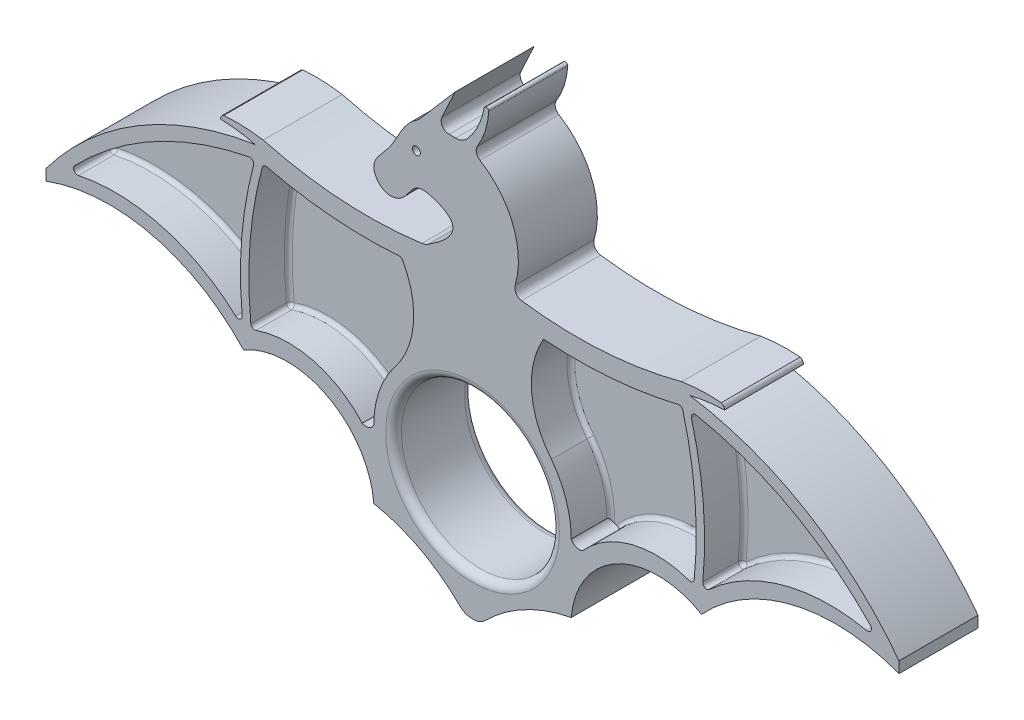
ISO-10303-21;
HEADER;
FILE_DESCRIPTION(('STEP AP214'),'2;1');
FILE_NAME('part.step','',(''),(''),'','','');
FILE_SCHEMA(('AUTOMOTIVE_DESIGN { 1 0 10303 214 1 1 1 1 }'));
ENDSEC;
DATA;
#1=APPLICATION_CONTEXT('core data for automotive mechanical design processes');
#2=APPLICATION_PROTOCOL_DEFINITION('international standard','automotive_design',2000,#1);
#3=PRODUCT_CONTEXT('',#1,'mechanical');
#4=PRODUCT('Part','Part','',(#3));
#5=PRODUCT_RELATED_PRODUCT_CATEGORY('part','',(#4));
#6=PRODUCT_DEFINITION_FORMATION('','',#4);
#7=PRODUCT_DEFINITION_CONTEXT('part definition',#1,'design');
#8=PRODUCT_DEFINITION('design','',#6,#7);
#9=PRODUCT_DEFINITION_SHAPE('','',#8);
#10=(LENGTH_UNIT() NAMED_UNIT(*) SI_UNIT(.MILLI.,.METRE.));
#11=(NAMED_UNIT(*) PLANE_ANGLE_UNIT() SI_UNIT($,.RADIAN.));
#12=(NAMED_UNIT(*) SI_UNIT($,.STERADIAN.) SOLID_ANGLE_UNIT());
#13=UNCERTAINTY_MEASURE_WITH_UNIT(LENGTH_MEASURE(1.E-05),#10,'distance_accuracy_value','');
#14=(GEOMETRIC_REPRESENTATION_CONTEXT(3) GLOBAL_UNCERTAINTY_ASSIGNED_CONTEXT((#13)) GLOBAL_UNIT_ASSIGNED_CONTEXT((#10,
#11,#12)) REPRESENTATION_CONTEXT('',''));
#15=CARTESIAN_POINT('',(0.,0.,0.));
#16=DIRECTION('',(0.,0.,1.));
#17=DIRECTION('',(1.,0.,0.));
#18=AXIS2_PLACEMENT_3D('',#15,#16,#17);
#19=CARTESIAN_POINT('',(11.1019474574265,1.98002424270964,12.7));
#20=DIRECTION('',(0.,0.,-1.));
#21=DIRECTION('',(-1.,0.,0.));
#22=AXIS2_PLACEMENT_3D('',#19,#20,#21);
#23=CYLINDRICAL_SURFACE('',#22,28.702);
#24=DIRECTION('',(0.,0.,-1.));
#25=VECTOR('',#24,1.);
#26=CARTESIAN_POINT('',(30.492605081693,23.1414797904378,12.7));
#27=LINE('',#26,#25);
#28=CARTESIAN_POINT('',(30.492605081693,23.1414797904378,12.7));
#29=VERTEX_POINT('',#28);
#30=CARTESIAN_POINT('',(30.492605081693,23.1414797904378,6.985));
#31=VERTEX_POINT('',#30);
#32=EDGE_CURVE('E688',#29,#31,#27,.T.);
#33=ORIENTED_EDGE('',*,*,#32,.T.);
#34=CARTESIAN_POINT('',(11.1019474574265,1.98002424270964,6.985));
#35=DIRECTION('',(0.,0.,-1.));
#36=DIRECTION('',(-1.,0.,0.));
#37=AXIS2_PLACEMENT_3D('',#34,#35,#36);
#38=CIRCLE('',#37,28.702);
#39=CARTESIAN_POINT('',(5.20851220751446,30.0704536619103,6.985));
#40=VERTEX_POINT('',#39);
#41=EDGE_CURVE('E1576',#31,#40,#38,.F.);
#42=ORIENTED_EDGE('',*,*,#41,.T.);
#43=DIRECTION('',(0.,0.,-1.));
#44=VECTOR('',#43,1.);
#45=CARTESIAN_POINT('',(5.20851220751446,30.0704536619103,12.7));
#46=LINE('',#45,#44);
#47=CARTESIAN_POINT('',(5.20851220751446,30.0704536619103,12.7));
#48=VERTEX_POINT('',#47);
#49=EDGE_CURVE('E691',#40,#48,#46,.F.);
#50=ORIENTED_EDGE('',*,*,#49,.T.);
#51=CARTESIAN_POINT('',(11.1019474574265,1.98002424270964,12.7));
#52=DIRECTION('',(0.,0.,1.));
#53=DIRECTION('',(1.,0.,0.));
#54=AXIS2_PLACEMENT_3D('',#51,#52,#53);
#55=CIRCLE('',#54,28.702);
#56=EDGE_CURVE('E1181',#29,#48,#55,.T.);
#57=ORIENTED_EDGE('',*,*,#56,.F.);
#58=EDGE_LOOP('',(#33,#42,#50,#57));
#59=FACE_BOUND('',#58,.T.);
#60=ADVANCED_FACE('F35',(#59),#23,.T.);
#61=CARTESIAN_POINT('',(42.6386581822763,-5.4001078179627,12.7));
#62=DIRECTION('',(0.,0.,-1.));
#63=DIRECTION('',(-1.,0.,0.));
#64=AXIS2_PLACEMENT_3D('',#61,#62,#63);
#65=CYLINDRICAL_SURFACE('',#64,52.7255774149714);
#66=DIRECTION('',(0.,0.,-1.));
#67=VECTOR('',#66,1.);
#68=CARTESIAN_POINT('',(4.62025215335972,31.1318961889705,12.7));
#69=LINE('',#68,#67);
#70=CARTESIAN_POINT('',(4.62025215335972,31.1318961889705,12.7));
#71=VERTEX_POINT('',#70);
#72=CARTESIAN_POINT('',(4.62025215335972,31.1318961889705,6.985));
#73=VERTEX_POINT('',#72);
#74=EDGE_CURVE('E685',#71,#73,#69,.T.);
#75=ORIENTED_EDGE('',*,*,#74,.T.);
#76=CARTESIAN_POINT('',(42.6386581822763,-5.4001078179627,6.985));
#77=DIRECTION('',(0.,0.,-1.));
#78=DIRECTION('',(-1.,0.,0.));
#79=AXIS2_PLACEMENT_3D('',#76,#77,#78);
#80=CIRCLE('',#79,52.7255774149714);
#81=CARTESIAN_POINT('',(32.650386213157,46.3707424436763,6.985));
#82=VERTEX_POINT('',#81);
#83=EDGE_CURVE('E785',#73,#82,#80,.T.);
#84=ORIENTED_EDGE('',*,*,#83,.T.);
#85=DIRECTION('',(0.,0.,-1.));
#86=VECTOR('',#85,1.);
#87=CARTESIAN_POINT('',(32.650386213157,46.3707424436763,12.7));
#88=LINE('',#87,#86);
#89=CARTESIAN_POINT('',(32.650386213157,46.3707424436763,12.7));
#90=VERTEX_POINT('',#89);
#91=EDGE_CURVE('E683',#82,#90,#88,.F.);
#92=ORIENTED_EDGE('',*,*,#91,.T.);
#93=CARTESIAN_POINT('',(42.6386581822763,-5.4001078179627,12.7));
#94=DIRECTION('',(0.,0.,1.));
#95=DIRECTION('',(1.,0.,0.));
#96=AXIS2_PLACEMENT_3D('',#93,#94,#95);
#97=CIRCLE('',#96,52.7255774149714);
#98=EDGE_CURVE('E1184',#90,#71,#97,.T.);
#99=ORIENTED_EDGE('',*,*,#98,.T.);
#100=EDGE_LOOP('',(#75,#84,#92,#99));
#101=FACE_BOUND('',#100,.T.);
#102=ADVANCED_FACE('F877',(#101),#65,.F.);
#103=CARTESIAN_POINT('',(92.542119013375,29.6087169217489,12.7));
#104=DIRECTION('',(0.,0.,-1.));
#105=DIRECTION('',(-1.,0.,0.));
#106=AXIS2_PLACEMENT_3D('',#103,#104,#105);
#107=CYLINDRICAL_SURFACE('',#106,61.2768477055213);
#108=DIRECTION('',(0.,0.,-1.));
#109=VECTOR('',#108,1.);
#110=CARTESIAN_POINT('',(33.3837267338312,45.5817156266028,12.7));
#111=LINE('',#110,#109);
#112=CARTESIAN_POINT('',(33.3837267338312,45.5817156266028,12.7));
#113=VERTEX_POINT('',#112);
#114=CARTESIAN_POINT('',(33.3837267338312,45.5817156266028,6.985));
#115=VERTEX_POINT('',#114);
#116=EDGE_CURVE('E709',#113,#115,#111,.T.);
#117=ORIENTED_EDGE('',*,*,#116,.T.);
#118=CARTESIAN_POINT('',(92.542119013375,29.6087169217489,6.985));
#119=DIRECTION('',(0.,0.,-1.));
#120=DIRECTION('',(-1.,0.,0.));
#121=AXIS2_PLACEMENT_3D('',#118,#119,#120);
#122=CIRCLE('',#121,61.2768477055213);
#123=CARTESIAN_POINT('',(31.5536138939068,23.6711830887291,6.985));
#124=VERTEX_POINT('',#123);
#125=EDGE_CURVE('E774',#115,#124,#122,.F.);
#126=ORIENTED_EDGE('',*,*,#125,.T.);
#127=DIRECTION('',(0.,0.,-1.));
#128=VECTOR('',#127,1.);
#129=CARTESIAN_POINT('',(31.5536138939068,23.6711830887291,12.7));
#130=LINE('',#129,#128);
#131=CARTESIAN_POINT('',(31.5536138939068,23.6711830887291,12.7));
#132=VERTEX_POINT('',#131);
#133=EDGE_CURVE('E707',#124,#132,#130,.F.);
#134=ORIENTED_EDGE('',*,*,#133,.T.);
#135=CARTESIAN_POINT('',(92.542119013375,29.6087169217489,12.7));
#136=DIRECTION('',(0.,0.,1.));
#137=DIRECTION('',(1.,0.,0.));
#138=AXIS2_PLACEMENT_3D('',#135,#136,#137);
#139=CIRCLE('',#138,61.2768477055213);
#140=EDGE_CURVE('E1187',#113,#132,#139,.T.);
#141=ORIENTED_EDGE('',*,*,#140,.F.);
#142=EDGE_LOOP('',(#117,#126,#134,#141));
#143=FACE_BOUND('',#142,.T.);
#144=ADVANCED_FACE('F874',(#143),#107,.T.);
#145=CARTESIAN_POINT('',(51.4429086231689,19.6395286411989,12.7));
#146=DIRECTION('',(0.,0.,-1.));
#147=DIRECTION('',(-1.,0.,0.));
#148=AXIS2_PLACEMENT_3D('',#145,#146,#147);
#149=CYLINDRICAL_SURFACE('',#148,1.39298911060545);
#150=CARTESIAN_POINT('',(51.4429086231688,19.6395286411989,6.35));
#151=DIRECTION('',(0.,0.,-1.));
#152=DIRECTION('',(-1.,0.,0.));
#153=AXIS2_PLACEMENT_3D('',#150,#151,#152);
#154=CIRCLE('',#153,1.39298911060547);
#155=CARTESIAN_POINT('',(52.705,19.05,6.35));
#156=VERTEX_POINT('',#155);
#157=CARTESIAN_POINT('',(51.7701545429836,18.2855239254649,6.35));
#158=VERTEX_POINT('',#157);
#159=EDGE_CURVE('E510',#156,#158,#154,.T.);
#160=ORIENTED_EDGE('',*,*,#159,.T.);
#161=CARTESIAN_POINT('',(51.7701545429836,18.2855239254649,6.35));
#162=CARTESIAN_POINT('',(51.7482741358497,18.2802322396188,6.34999972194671));
#163=CARTESIAN_POINT('',(51.7262840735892,18.2754825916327,6.35096767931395));
#164=CARTESIAN_POINT('',(51.6822785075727,18.2670783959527,6.35468354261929));
#165=CARTESIAN_POINT('',(51.6602630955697,18.2634221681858,6.35742869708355));
#166=CARTESIAN_POINT('',(51.5948374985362,18.2541548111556,6.36802447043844));
#167=CARTESIAN_POINT('',(51.5515728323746,18.2501318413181,6.37824238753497));
#168=CARTESIAN_POINT('',(51.4555897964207,18.2455696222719,6.40714051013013));
#169=CARTESIAN_POINT('',(51.4032794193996,18.2461826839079,6.42731556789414));
#170=CARTESIAN_POINT('',(51.3017518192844,18.2527682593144,6.47424124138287));
#171=CARTESIAN_POINT('',(51.2525563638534,18.2587748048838,6.50103282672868));
#172=CARTESIAN_POINT('',(51.1574460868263,18.27523688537,6.56084263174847));
#173=CARTESIAN_POINT('',(51.1116193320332,18.2857812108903,6.59397737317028));
#174=CARTESIAN_POINT('',(51.0474694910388,18.303661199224,6.64818821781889));
#175=CARTESIAN_POINT('',(51.0268830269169,18.309952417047,6.66697347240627));
#176=CARTESIAN_POINT('',(50.9875960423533,18.3228916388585,6.70629609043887));
#177=CARTESIAN_POINT('',(50.968892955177,18.3295391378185,6.72683099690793));
#178=CARTESIAN_POINT('',(50.9385505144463,18.3409780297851,6.76449672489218));
#179=CARTESIAN_POINT('',(50.9263312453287,18.3458072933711,6.78114568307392));
#180=CARTESIAN_POINT('',(50.9038578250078,18.3550095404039,6.81586398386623));
#181=CARTESIAN_POINT('',(50.8936020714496,18.3593828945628,6.8339321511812));
#182=CARTESIAN_POINT('',(50.8779133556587,18.3662432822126,6.86741282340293));
#183=CARTESIAN_POINT('',(50.8719146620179,18.36893340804,6.88251315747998));
#184=CARTESIAN_POINT('',(50.8622158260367,18.3733360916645,6.91355380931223));
#185=CARTESIAN_POINT('',(50.8585071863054,18.3750522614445,6.92949078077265));
#186=CARTESIAN_POINT('',(50.8552654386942,18.3765579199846,6.95215566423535));
#187=CARTESIAN_POINT('',(50.8545615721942,18.376885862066,6.95869203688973));
#188=CARTESIAN_POINT('',(50.8536178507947,18.3773261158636,6.97181770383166));
#189=CARTESIAN_POINT('',(50.8533788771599,18.3774380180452,6.97840707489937));
#190=CARTESIAN_POINT('',(50.85337998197,18.3774372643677,6.98499999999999));
#191=B_SPLINE_CURVE_WITH_KNOTS('',3,(#161,#162,#163,#164,#165,#166,#167,#168,#169,#170,#171,
#172,#173,#174,#175,#176,#177,#178,#179,#180,#181,#182,#183,#184,#185,#186,#187,#188,#189,#190),
.UNSPECIFIED.,.F.,.F.,(4,2,2,2,2,2,2,2,2,2,2,2,2,2,4),(0.,0.0674721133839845,0.134840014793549,
0.268131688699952,0.435469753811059,0.603871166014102,0.775729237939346,0.861361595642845,
0.946875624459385,1.01040772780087,1.0738877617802,1.12314300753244,1.17221437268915,
1.19194389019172,1.21171077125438),.UNSPECIFIED.);
#192=CARTESIAN_POINT('',(50.85337998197,18.3774372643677,6.985));
#193=VERTEX_POINT('',#192);
#194=EDGE_CURVE('E798',#158,#193,#191,.T.);
#195=ORIENTED_EDGE('',*,*,#194,.T.);
#196=DIRECTION('',(0.,0.,-1.));
#197=VECTOR('',#196,1.);
#198=CARTESIAN_POINT('',(50.85337998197,18.3774372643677,12.7));
#199=LINE('',#198,#197);
#200=CARTESIAN_POINT('',(50.85337998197,18.3774372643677,12.7));
#201=VERTEX_POINT('',#200);
#202=EDGE_CURVE('E518',#201,#193,#199,.T.);
#203=ORIENTED_EDGE('',*,*,#202,.F.);
#204=CARTESIAN_POINT('',(51.4429086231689,19.6395286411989,12.7));
#205=DIRECTION('',(0.,0.,1.));
#206=DIRECTION('',(1.,0.,0.));
#207=AXIS2_PLACEMENT_3D('',#204,#205,#206);
#208=CIRCLE('',#207,1.39298911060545);
#209=CARTESIAN_POINT('',(52.705,19.05,12.7));
#210=VERTEX_POINT('',#209);
#211=EDGE_CURVE('E1166',#201,#210,#208,.T.);
#212=ORIENTED_EDGE('',*,*,#211,.T.);
#213=DIRECTION('',(0.,0.,-1.));
#214=VECTOR('',#213,1.);
#215=CARTESIAN_POINT('',(52.705,19.05,12.7));
#216=LINE('',#215,#214);
#217=EDGE_CURVE('E519',#210,#156,#216,.T.);
#218=ORIENTED_EDGE('',*,*,#217,.T.);
#219=EDGE_LOOP('',(#160,#195,#203,#212,#218));
#220=FACE_BOUND('',#219,.T.);
#221=ADVANCED_FACE('F808',(#220),#149,.F.);
#222=CARTESIAN_POINT('',(39.0044092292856,7.74652540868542,12.7));
#223=DIRECTION('',(0.,0.,-1.));
#224=DIRECTION('',(-1.,0.,0.));
#225=AXIS2_PLACEMENT_3D('',#222,#223,#224);
#226=CYLINDRICAL_SURFACE('',#225,15.9189947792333);
#227=ORIENTED_EDGE('',*,*,#202,.T.);
#228=CARTESIAN_POINT('',(39.0044092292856,7.74652540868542,6.985));
#229=DIRECTION('',(0.,0.,1.));
#230=DIRECTION('',(1.,0.,0.));
#231=AXIS2_PLACEMENT_3D('',#228,#229,#230);
#232=CIRCLE('',#231,15.9189947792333);
#233=CARTESIAN_POINT('',(33.7716530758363,22.7809079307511,6.985));
#234=VERTEX_POINT('',#233);
#235=EDGE_CURVE('E789',#193,#234,#232,.T.);
#236=ORIENTED_EDGE('',*,*,#235,.T.);
#237=DIRECTION('',(0.,0.,-1.));
#238=VECTOR('',#237,1.);
#239=CARTESIAN_POINT('',(33.7716530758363,22.7809079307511,12.7));
#240=LINE('',#239,#238);
#241=CARTESIAN_POINT('',(33.7716530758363,22.7809079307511,12.7));
#242=VERTEX_POINT('',#241);
#243=EDGE_CURVE('E705',#234,#242,#240,.F.);
#244=ORIENTED_EDGE('',*,*,#243,.T.);
#245=CARTESIAN_POINT('',(39.0044092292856,7.74652540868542,12.7));
#246=DIRECTION('',(0.,0.,1.));
#247=DIRECTION('',(1.,0.,0.));
#248=AXIS2_PLACEMENT_3D('',#245,#246,#247);
#249=CIRCLE('',#248,15.9189947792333);
#250=EDGE_CURVE('E1169',#201,#242,#249,.T.);
#251=ORIENTED_EDGE('',*,*,#250,.F.);
#252=EDGE_LOOP('',(#227,#236,#244,#251));
#253=FACE_BOUND('',#252,.T.);
#254=ADVANCED_FACE('F867',(#253),#226,.T.);
#255=CARTESIAN_POINT('',(95.2987249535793,29.6698594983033,12.7));
#256=DIRECTION('',(0.,0.,-1.));
#257=DIRECTION('',(-1.,0.,0.));
#258=AXIS2_PLACEMENT_3D('',#255,#256,#257);
#259=CYLINDRICAL_SURFACE('',#258,62.6903299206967);
#260=DIRECTION('',(0.,0.,-1.));
#261=VECTOR('',#260,1.);
#262=CARTESIAN_POINT('',(32.9311909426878,23.3162646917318,12.7));
#263=LINE('',#262,#261);
#264=CARTESIAN_POINT('',(32.9311909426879,23.3162646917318,12.7));
#265=VERTEX_POINT('',#264);
#266=CARTESIAN_POINT('',(32.9311909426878,23.3162646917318,6.985));
#267=VERTEX_POINT('',#266);
#268=EDGE_CURVE('E702',#265,#267,#263,.T.);
#269=ORIENTED_EDGE('',*,*,#268,.T.);
#270=CARTESIAN_POINT('',(95.2987249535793,29.6698594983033,6.985));
#271=DIRECTION('',(0.,0.,1.));
#272=DIRECTION('',(1.,0.,0.));
#273=AXIS2_PLACEMENT_3D('',#270,#271,#272);
#274=CIRCLE('',#273,62.6903299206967);
#275=CARTESIAN_POINT('',(34.7604099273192,45.9545111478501,6.985));
#276=VERTEX_POINT('',#275);
#277=EDGE_CURVE('E951',#267,#276,#274,.F.);
#278=ORIENTED_EDGE('',*,*,#277,.T.);
#279=DIRECTION('',(0.,0.,-1.));
#280=VECTOR('',#279,1.);
#281=CARTESIAN_POINT('',(34.7604099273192,45.9545111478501,12.7));
#282=LINE('',#281,#280);
#283=CARTESIAN_POINT('',(34.7604099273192,45.9545111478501,12.7));
#284=VERTEX_POINT('',#283);
#285=EDGE_CURVE('E700',#276,#284,#282,.F.);
#286=ORIENTED_EDGE('',*,*,#285,.T.);
#287=CARTESIAN_POINT('',(95.2987249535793,29.6698594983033,12.7));
#288=DIRECTION('',(0.,0.,1.));
#289=DIRECTION('',(1.,0.,0.));
#290=AXIS2_PLACEMENT_3D('',#287,#288,#289);
#291=CIRCLE('',#290,62.6903299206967);
#292=EDGE_CURVE('E1172',#284,#265,#291,.T.);
#293=ORIENTED_EDGE('',*,*,#292,.T.);
#294=EDGE_LOOP('',(#269,#278,#286,#293));
#295=FACE_BOUND('',#294,.T.);
#296=ADVANCED_FACE('F864',(#295),#259,.F.);
#297=CARTESIAN_POINT('',(51.7524999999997,113.376528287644,12.7));
#298=DIRECTION('',(0.,0.,-1.));
#299=DIRECTION('',(-1.,0.,0.));
#300=AXIS2_PLACEMENT_3D('',#297,#298,#299);
#301=CYLINDRICAL_SURFACE('',#300,68.9082676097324);
#302=DIRECTION('',(0.,0.,-1.));
#303=VECTOR('',#302,1.);
#304=CARTESIAN_POINT('',(35.5231675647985,46.4066984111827,12.7));
#305=LINE('',#304,#303);
#306=CARTESIAN_POINT('',(35.5231675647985,46.4066984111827,12.7));
#307=VERTEX_POINT('',#306);
#308=CARTESIAN_POINT('',(35.5231675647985,46.4066984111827,6.985));
#309=VERTEX_POINT('',#308);
#310=EDGE_CURVE('E695',#307,#309,#305,.T.);
#311=ORIENTED_EDGE('',*,*,#310,.T.);
#312=CARTESIAN_POINT('',(51.7524999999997,113.376528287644,6.985));
#313=DIRECTION('',(0.,0.,1.));
#314=DIRECTION('',(1.,0.,0.));
#315=AXIS2_PLACEMENT_3D('',#312,#313,#314);
#316=CIRCLE('',#315,68.9082676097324);
#317=CARTESIAN_POINT('',(56.7535433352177,44.6499765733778,6.985));
#318=VERTEX_POINT('',#317);
#319=EDGE_CURVE('E2410',#309,#318,#316,.T.);
#320=ORIENTED_EDGE('',*,*,#319,.T.);
#321=DIRECTION('',(0.,0.,-1.));
#322=VECTOR('',#321,1.);
#323=CARTESIAN_POINT('',(56.7535433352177,44.6499765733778,12.7));
#324=LINE('',#323,#322);
#325=CARTESIAN_POINT('',(56.7535433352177,44.6499765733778,12.7));
#326=VERTEX_POINT('',#325);
#327=EDGE_CURVE('E698',#318,#326,#324,.F.);
#328=ORIENTED_EDGE('',*,*,#327,.T.);
#329=CARTESIAN_POINT('',(51.7524999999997,113.376528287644,12.7));
#330=DIRECTION('',(0.,0.,1.));
#331=DIRECTION('',(1.,0.,0.));
#332=AXIS2_PLACEMENT_3D('',#329,#330,#331);
#333=CIRCLE('',#332,68.9082676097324);
#334=EDGE_CURVE('E1175',#307,#326,#333,.T.);
#335=ORIENTED_EDGE('',*,*,#334,.F.);
#336=EDGE_LOOP('',(#311,#320,#328,#335));
#337=FACE_BOUND('',#336,.T.);
#338=ADVANCED_FACE('F860',(#337),#301,.T.);
#339=CARTESIAN_POINT('',(45.1522438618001,37.523527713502,12.7));
#340=DIRECTION('',(0.,0.,-1.));
#341=DIRECTION('',(-1.,0.,0.));
#342=AXIS2_PLACEMENT_3D('',#339,#340,#341);
#343=CYLINDRICAL_SURFACE('',#342,13.97);
#344=DIRECTION('',(0.,0.,-1.));
#345=VECTOR('',#344,1.);
#346=CARTESIAN_POINT('',(57.3542660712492,44.3258474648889,12.7));
#347=LINE('',#346,#345);
#348=CARTESIAN_POINT('',(57.3542660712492,44.3258474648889,12.7));
#349=VERTEX_POINT('',#348);
#350=CARTESIAN_POINT('',(57.3542660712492,44.3258474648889,6.40827730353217));
#351=VERTEX_POINT('',#350);
#352=EDGE_CURVE('E693',#349,#351,#347,.T.);
#353=ORIENTED_EDGE('',*,*,#352,.T.);
#354=CARTESIAN_POINT('',(57.3542660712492,44.3258474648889,6.40827730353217));
#355=CARTESIAN_POINT('',(57.3654880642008,44.3057204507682,6.39861468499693));
#356=CARTESIAN_POINT('',(57.3768915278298,44.2851455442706,6.3901266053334));
#357=CARTESIAN_POINT('',(57.3998314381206,44.2435011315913,6.37561108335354));
#358=CARTESIAN_POINT('',(57.4113655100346,44.2224383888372,6.36956049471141));
#359=CARTESIAN_POINT('',(57.4462419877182,44.158354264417,6.35494717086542));
#360=CARTESIAN_POINT('',(57.4697753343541,44.1145862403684,6.34999363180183));
#361=CARTESIAN_POINT('',(57.4931001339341,44.0706008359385,6.35));
#362=B_SPLINE_CURVE_WITH_KNOTS('',3,(#354,#355,#356,#357,#358,#359,#360,#361),.UNSPECIFIED.,.F.,
.F.,(4,2,2,4),(0.,0.0749098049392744,0.149090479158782,0.297996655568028),.UNSPECIFIED.);
#363=CARTESIAN_POINT('',(57.4931001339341,44.0706008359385,6.35));
#364=VERTEX_POINT('',#363);
#365=EDGE_CURVE('E501',#351,#364,#362,.T.);
#366=ORIENTED_EDGE('',*,*,#365,.T.);
#367=CARTESIAN_POINT('',(45.1522438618,37.523527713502,6.35));
#368=DIRECTION('',(0.,0.,-1.));
#369=DIRECTION('',(1.,0.,0.));
#370=AXIS2_PLACEMENT_3D('',#367,#368,#369);
#371=CIRCLE('',#370,13.97);
#372=CARTESIAN_POINT('',(55.8799999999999,28.5749999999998,6.35));
#373=VERTEX_POINT('',#372);
#374=EDGE_CURVE('E492',#364,#373,#371,.T.);
#375=ORIENTED_EDGE('',*,*,#374,.T.);
#376=DIRECTION('',(0.,0.,-1.));
#377=VECTOR('',#376,1.);
#378=CARTESIAN_POINT('',(55.8799999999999,28.5749999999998,12.7));
#379=LINE('',#378,#377);
#380=CARTESIAN_POINT('',(55.8799999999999,28.5749999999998,12.7));
#381=VERTEX_POINT('',#380);
#382=EDGE_CURVE('E498',#381,#373,#379,.T.);
#383=ORIENTED_EDGE('',*,*,#382,.F.);
#384=CARTESIAN_POINT('',(45.1522438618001,37.523527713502,12.7));
#385=DIRECTION('',(0.,0.,1.));
#386=DIRECTION('',(1.,0.,0.));
#387=AXIS2_PLACEMENT_3D('',#384,#385,#386);
#388=CIRCLE('',#387,13.97);
#389=EDGE_CURVE('E1178',#381,#349,#388,.T.);
#390=ORIENTED_EDGE('',*,*,#389,.T.);
#391=EDGE_LOOP('',(#353,#366,#375,#383,#390));
#392=FACE_BOUND('',#391,.T.);
#393=ADVANCED_FACE('F495',(#392),#343,.F.);
#394=CARTESIAN_POINT('',(94.5213418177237,-5.40010781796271,12.7));
#395=DIRECTION('',(0.,0.,-1.));
#396=DIRECTION('',(-1.,0.,0.));
#397=AXIS2_PLACEMENT_3D('',#394,#395,#396);
#398=CYLINDRICAL_SURFACE('',#397,52.7255774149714);
#399=DIRECTION('',(0.,0.,-1.));
#400=VECTOR('',#399,1.);
#401=CARTESIAN_POINT('',(104.509613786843,46.3707424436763,12.7));
#402=LINE('',#401,#400);
#403=CARTESIAN_POINT('',(104.509613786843,46.3707424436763,12.7));
#404=VERTEX_POINT('',#403);
#405=CARTESIAN_POINT('',(104.509613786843,46.3707424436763,6.985));
#406=VERTEX_POINT('',#405);
#407=EDGE_CURVE('E664',#404,#406,#402,.T.);
#408=ORIENTED_EDGE('',*,*,#407,.T.);
#409=CARTESIAN_POINT('',(94.5213418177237,-5.40010781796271,6.985));
#410=DIRECTION('',(0.,0.,1.));
#411=DIRECTION('',(1.,0.,0.));
#412=AXIS2_PLACEMENT_3D('',#409,#410,#411);
#413=CIRCLE('',#412,52.7255774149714);
#414=CARTESIAN_POINT('',(132.53974784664,31.1318961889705,6.985));
#415=VERTEX_POINT('',#414);
#416=EDGE_CURVE('E737',#406,#415,#413,.F.);
#417=ORIENTED_EDGE('',*,*,#416,.T.);
#418=DIRECTION('',(0.,0.,-1.));
#419=VECTOR('',#418,1.);
#420=CARTESIAN_POINT('',(132.53974784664,31.1318961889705,12.7));
#421=LINE('',#420,#419);
#422=CARTESIAN_POINT('',(132.53974784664,31.1318961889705,12.7));
#423=VERTEX_POINT('',#422);
#424=EDGE_CURVE('E667',#415,#423,#421,.F.);
#425=ORIENTED_EDGE('',*,*,#424,.T.);
#426=CARTESIAN_POINT('',(94.5213418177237,-5.40010781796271,12.7));
#427=DIRECTION('',(0.,0.,1.));
#428=DIRECTION('',(1.,0.,0.));
#429=AXIS2_PLACEMENT_3D('',#426,#427,#428);
#430=CIRCLE('',#429,52.7255774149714);
#431=EDGE_CURVE('E1157',#404,#423,#430,.F.);
#432=ORIENTED_EDGE('',*,*,#431,.F.);
#433=EDGE_LOOP('',(#408,#417,#425,#432));
#434=FACE_BOUND('',#433,.T.);
#435=ADVANCED_FACE('F859',(#434),#398,.F.);
#436=CARTESIAN_POINT('',(126.058052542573,1.98002424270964,12.7));
#437=DIRECTION('',(0.,0.,-1.));
#438=DIRECTION('',(-1.,0.,0.));
#439=AXIS2_PLACEMENT_3D('',#436,#437,#438);
#440=CYLINDRICAL_SURFACE('',#439,28.702);
#441=DIRECTION('',(0.,0.,-1.));
#442=VECTOR('',#441,1.);
#443=CARTESIAN_POINT('',(131.951487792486,30.0704536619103,12.7));
#444=LINE('',#443,#442);
#445=CARTESIAN_POINT('',(131.951487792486,30.0704536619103,12.7));
#446=VERTEX_POINT('',#445);
#447=CARTESIAN_POINT('',(131.951487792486,30.0704536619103,6.985));
#448=VERTEX_POINT('',#447);
#449=EDGE_CURVE('E661',#446,#448,#444,.T.);
#450=ORIENTED_EDGE('',*,*,#449,.T.);
#451=CARTESIAN_POINT('',(126.058052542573,1.98002424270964,6.985));
#452=DIRECTION('',(0.,0.,1.));
#453=DIRECTION('',(1.,0.,0.));
#454=AXIS2_PLACEMENT_3D('',#451,#452,#453);
#455=CIRCLE('',#454,28.702);
#456=CARTESIAN_POINT('',(106.667394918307,23.1414797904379,6.985));
#457=VERTEX_POINT('',#456);
#458=EDGE_CURVE('E940',#448,#457,#455,.T.);
#459=ORIENTED_EDGE('',*,*,#458,.T.);
#460=DIRECTION('',(0.,0.,-1.));
#461=VECTOR('',#460,1.);
#462=CARTESIAN_POINT('',(106.667394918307,23.1414797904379,12.7));
#463=LINE('',#462,#461);
#464=CARTESIAN_POINT('',(106.667394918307,23.1414797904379,12.7));
#465=VERTEX_POINT('',#464);
#466=EDGE_CURVE('E659',#457,#465,#463,.F.);
#467=ORIENTED_EDGE('',*,*,#466,.T.);
#468=CARTESIAN_POINT('',(126.058052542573,1.98002424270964,12.7));
#469=DIRECTION('',(0.,0.,1.));
#470=DIRECTION('',(1.,0.,0.));
#471=AXIS2_PLACEMENT_3D('',#468,#469,#470);
#472=CIRCLE('',#471,28.702);
#473=EDGE_CURVE('E1160',#465,#446,#472,.F.);
#474=ORIENTED_EDGE('',*,*,#473,.T.);
#475=EDGE_LOOP('',(#450,#459,#467,#474));
#476=FACE_BOUND('',#475,.T.);
#477=ADVANCED_FACE('F1033',(#476),#440,.T.);
#478=CARTESIAN_POINT('',(98.1555907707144,7.74652540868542,12.7));
#479=DIRECTION('',(0.,0.,-1.));
#480=DIRECTION('',(-1.,0.,0.));
#481=AXIS2_PLACEMENT_3D('',#478,#479,#480);
#482=CYLINDRICAL_SURFACE('',#481,15.9189947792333);
#483=DIRECTION('',(0.,0.,-1.));
#484=VECTOR('',#483,1.);
#485=CARTESIAN_POINT('',(103.388346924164,22.7809079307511,12.7));
#486=LINE('',#485,#484);
#487=CARTESIAN_POINT('',(103.388346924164,22.7809079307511,12.7));
#488=VERTEX_POINT('',#487);
#489=CARTESIAN_POINT('',(103.388346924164,22.7809079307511,6.985));
#490=VERTEX_POINT('',#489);
#491=EDGE_CURVE('E674',#488,#490,#486,.T.);
#492=ORIENTED_EDGE('',*,*,#491,.T.);
#493=CARTESIAN_POINT('',(98.1555907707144,7.74652540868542,6.985));
#494=DIRECTION('',(0.,0.,1.));
#495=DIRECTION('',(1.,0.,0.));
#496=AXIS2_PLACEMENT_3D('',#493,#494,#495);
#497=CIRCLE('',#496,15.9189947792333);
#498=CARTESIAN_POINT('',(86.30662001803,18.3774372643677,6.985));
#499=VERTEX_POINT('',#498);
#500=EDGE_CURVE('E50',#490,#499,#497,.T.);
#501=ORIENTED_EDGE('',*,*,#500,.T.);
#502=DIRECTION('',(0.,0.,-1.));
#503=VECTOR('',#502,1.);
#504=CARTESIAN_POINT('',(86.30662001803,18.3774372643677,12.7));
#505=LINE('',#504,#503);
#506=CARTESIAN_POINT('',(86.30662001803,18.3774372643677,12.7));
#507=VERTEX_POINT('',#506);
#508=EDGE_CURVE('E524',#507,#499,#505,.T.);
#509=ORIENTED_EDGE('',*,*,#508,.F.);
#510=CARTESIAN_POINT('',(98.1555907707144,7.74652540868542,12.7));
#511=DIRECTION('',(0.,0.,1.));
#512=DIRECTION('',(1.,0.,0.));
#513=AXIS2_PLACEMENT_3D('',#510,#511,#512);
#514=CIRCLE('',#513,15.9189947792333);
#515=EDGE_CURVE('E1140',#507,#488,#514,.F.);
#516=ORIENTED_EDGE('',*,*,#515,.T.);
#517=EDGE_LOOP('',(#492,#501,#509,#516));
#518=FACE_BOUND('',#517,.T.);
#519=ADVANCED_FACE('F1027',(#518),#482,.T.);
#520=CARTESIAN_POINT('',(85.7170913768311,19.6395286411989,12.7));
#521=DIRECTION('',(0.,0.,-1.));
#522=DIRECTION('',(-1.,0.,0.));
#523=AXIS2_PLACEMENT_3D('',#520,#521,#522);
#524=CYLINDRICAL_SURFACE('',#523,1.39298911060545);
#525=CARTESIAN_POINT('',(85.7170913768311,19.6395286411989,6.35));
#526=DIRECTION('',(0.,0.,-1.));
#527=DIRECTION('',(-1.,0.,0.));
#528=AXIS2_PLACEMENT_3D('',#525,#526,#527);
#529=CIRCLE('',#528,1.39298911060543);
#530=CARTESIAN_POINT('',(85.3898454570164,18.2855239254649,6.35));
#531=VERTEX_POINT('',#530);
#532=CARTESIAN_POINT('',(85.0772849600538,18.4021659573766,6.35));
#533=VERTEX_POINT('',#532);
#534=EDGE_CURVE('E505',#531,#533,#529,.T.);
#535=ORIENTED_EDGE('',*,*,#534,.T.);
#536=CARTESIAN_POINT('',(85.0772849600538,18.4021659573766,6.35));
#537=CARTESIAN_POINT('',(85.057579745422,18.4123512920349,6.34999961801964));
#538=CARTESIAN_POINT('',(85.0381387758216,18.4230040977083,6.35095318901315));
#539=CARTESIAN_POINT('',(84.9999362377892,18.4451285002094,6.35462070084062));
#540=CARTESIAN_POINT('',(84.9811736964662,18.4565988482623,6.35733200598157));
#541=CARTESIAN_POINT('',(84.9264242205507,18.4918642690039,6.36781330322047));
#542=CARTESIAN_POINT('',(84.8915613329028,18.5167295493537,6.37793707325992));
#543=CARTESIAN_POINT('',(84.817494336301,18.5747000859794,6.40645791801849));
#544=CARTESIAN_POINT('',(84.7792701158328,18.6083465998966,6.4262612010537));
#545=CARTESIAN_POINT('',(84.7084708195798,18.6774623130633,6.47240062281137));
#546=CARTESIAN_POINT('',(84.6759317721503,18.7129414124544,6.49877602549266));
#547=CARTESIAN_POINT('',(84.6161482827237,18.7848043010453,6.55772015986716));
#548=CARTESIAN_POINT('',(84.5890114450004,18.8211927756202,6.59039324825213));
#549=CARTESIAN_POINT('',(84.552994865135,18.8741812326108,6.64391307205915));
#550=CARTESIAN_POINT('',(84.541785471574,18.8915509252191,6.66247031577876));
#551=CARTESIAN_POINT('',(84.5209853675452,18.9252887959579,6.70130757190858));
#552=CARTESIAN_POINT('',(84.5113925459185,18.9416582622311,6.72158528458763));
#553=CARTESIAN_POINT('',(84.4958068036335,18.9693933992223,6.75976789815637));
#554=CARTESIAN_POINT('',(84.4894799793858,18.9810923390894,6.77729136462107));
#555=CARTESIAN_POINT('',(84.4781390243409,19.0026897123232,6.81383254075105));
#556=CARTESIAN_POINT('',(84.4731235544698,19.012589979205,6.83284870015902));
#557=CARTESIAN_POINT('',(84.4655973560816,19.027779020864,6.86829614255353));
#558=CARTESIAN_POINT('',(84.4627816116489,19.0335998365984,6.88442886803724));
#559=CARTESIAN_POINT('',(84.4583778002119,19.0427985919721,6.9175161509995));
#560=CARTESIAN_POINT('',(84.4567855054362,19.046184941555,6.93446766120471));
#561=CARTESIAN_POINT('',(84.4552924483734,19.0493751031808,6.96268210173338));
#562=CARTESIAN_POINT('',(84.4549924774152,19.0500226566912,6.97383509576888));
#563=CARTESIAN_POINT('',(84.4550000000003,19.04999999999,6.98500000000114));
#564=B_SPLINE_CURVE_WITH_KNOTS('',3,(#536,#537,#538,#539,#540,#541,#542,#543,#544,#545,#546,
#547,#548,#549,#550,#551,#552,#553,#554,#555,#556,#557,#558,#559,#560,#561,#562,#563),
.UNSPECIFIED.,.F.,.F.,(4,2,2,2,2,2,2,2,2,2,2,2,2,4),(0.,0.0664858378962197,0.132872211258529,
0.264264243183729,0.427334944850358,0.591404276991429,0.758471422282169,0.841730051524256,
0.924879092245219,0.990764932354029,1.05658322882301,1.10854600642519,1.16032840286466,
1.19378476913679),.UNSPECIFIED.);
#565=CARTESIAN_POINT('',(84.455,19.05,6.985));
#566=VERTEX_POINT('',#565);
#567=EDGE_CURVE('E1004',#533,#566,#564,.T.);
#568=ORIENTED_EDGE('',*,*,#567,.T.);
#569=DIRECTION('',(0.,0.,-1.));
#570=VECTOR('',#569,1.);
#571=CARTESIAN_POINT('',(84.455,19.05,12.7));
#572=LINE('',#571,#570);
#573=CARTESIAN_POINT('',(84.455,19.05,12.7));
#574=VERTEX_POINT('',#573);
#575=EDGE_CURVE('E534',#574,#566,#572,.T.);
#576=ORIENTED_EDGE('',*,*,#575,.F.);
#577=CARTESIAN_POINT('',(85.7170913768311,19.6395286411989,12.7));
#578=DIRECTION('',(0.,0.,1.));
#579=DIRECTION('',(1.,0.,0.));
#580=AXIS2_PLACEMENT_3D('',#577,#578,#579);
#581=CIRCLE('',#580,1.39298911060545);
#582=EDGE_CURVE('E1143',#507,#574,#581,.F.);
#583=ORIENTED_EDGE('',*,*,#582,.F.);
#584=ORIENTED_EDGE('',*,*,#508,.T.);
#585=CARTESIAN_POINT('',(86.30662001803,18.3774372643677,6.985));
#586=CARTESIAN_POINT('',(86.306678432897,18.3774738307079,6.96807496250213));
#587=CARTESIAN_POINT('',(86.3050567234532,18.3767060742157,6.95126436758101));
#588=CARTESIAN_POINT('',(86.2990639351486,18.3739288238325,6.91854735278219));
#589=CARTESIAN_POINT('',(86.2947433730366,18.3719421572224,6.90263005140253));
#590=CARTESIAN_POINT('',(86.2817858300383,18.3661070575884,6.86562310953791));
#591=CARTESIAN_POINT('',(86.2721175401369,18.3618330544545,6.84497750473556));
#592=CARTESIAN_POINT('',(86.2499020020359,18.3524073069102,6.80534374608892));
#593=CARTESIAN_POINT('',(86.2373281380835,18.3472475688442,6.78637330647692));
#594=CARTESIAN_POINT('',(86.19685015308,18.3314487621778,6.7319029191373));
#595=CARTESIAN_POINT('',(86.1661013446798,18.3204464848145,6.69865063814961));
#596=CARTESIAN_POINT('',(86.1002289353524,18.2998131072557,6.63653962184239));
#597=CARTESIAN_POINT('',(86.0651038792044,18.2901824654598,6.60768235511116));
#598=CARTESIAN_POINT('',(85.9868841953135,18.2722569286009,6.55039779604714));
#599=CARTESIAN_POINT('',(85.9433422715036,18.2642798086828,6.52247581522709));
#600=CARTESIAN_POINT('',(85.8528671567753,18.2524213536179,6.47170787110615));
#601=CARTESIAN_POINT('',(85.8059354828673,18.2485381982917,6.44885965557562));
#602=CARTESIAN_POINT('',(85.7152124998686,18.2458925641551,6.41159906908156));
#603=CARTESIAN_POINT('',(85.6717210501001,18.2465710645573,6.39650308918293));
#604=CARTESIAN_POINT('',(85.5834702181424,18.2522637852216,6.37208888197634));
#605=CARTESIAN_POINT('',(85.5387152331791,18.2572644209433,6.36275270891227));
#606=CARTESIAN_POINT('',(85.4765376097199,18.2673534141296,6.35466800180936));
#607=CARTESIAN_POINT('',(85.4591561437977,18.2705138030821,6.35293681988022));
#608=CARTESIAN_POINT('',(85.4244421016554,18.2775122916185,6.35060259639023));
#609=CARTESIAN_POINT('',(85.4071095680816,18.2813508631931,6.35000034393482));
#610=CARTESIAN_POINT('',(85.3898454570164,18.2855239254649,6.35));
#611=B_SPLINE_CURVE_WITH_KNOTS('',3,(#585,#586,#587,#588,#589,#590,#591,#592,#593,#594,#595,
#596,#597,#598,#599,#600,#601,#602,#603,#604,#605,#606,#607,#608,#609,#610),.UNSPECIFIED.,.F.,
.F.,(4,2,2,2,2,2,2,2,2,2,2,2,4),(0.,0.0504982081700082,0.10007840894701,0.16926696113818,
0.239116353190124,0.378179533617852,0.517289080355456,0.673799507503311,0.830240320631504,
0.967891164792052,1.105110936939,1.15832293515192,1.21157211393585),.UNSPECIFIED.);
#612=EDGE_CURVE('E1013',#499,#531,#611,.T.);
#613=ORIENTED_EDGE('',*,*,#612,.T.);
#614=EDGE_LOOP('',(#535,#568,#576,#583,#584,#613));
#615=FACE_BOUND('',#614,.T.);
#616=ADVANCED_FACE('F1021',(#615),#524,.F.);
#617=CARTESIAN_POINT('',(68.58,19.05,12.7));
#618=DIRECTION('',(0.,0.,-1.));
#619=DIRECTION('',(-1.,0.,0.));
#620=AXIS2_PLACEMENT_3D('',#617,#618,#619);
#621=CYLINDRICAL_SURFACE('',#620,15.875);
#622=ORIENTED_EDGE('',*,*,#575,.T.);
#623=CARTESIAN_POINT('',(68.58,19.05,6.985));
#624=DIRECTION('',(0.,0.,1.));
#625=DIRECTION('',(1.,0.,0.));
#626=AXIS2_PLACEMENT_3D('',#623,#624,#625);
#627=CIRCLE('',#626,15.875);
#628=CARTESIAN_POINT('',(81.28,28.575,6.985));
#629=VERTEX_POINT('',#628);
#630=EDGE_CURVE('E58',#566,#629,#627,.T.);
#631=ORIENTED_EDGE('',*,*,#630,.T.);
#632=DIRECTION('',(0.,0.,-1.));
#633=VECTOR('',#632,1.);
#634=CARTESIAN_POINT('',(81.28,28.575,12.7));
#635=LINE('',#634,#633);
#636=CARTESIAN_POINT('',(81.28,28.575,12.7));
#637=VERTEX_POINT('',#636);
#638=EDGE_CURVE('E531',#637,#629,#635,.T.);
#639=ORIENTED_EDGE('',*,*,#638,.F.);
#640=CARTESIAN_POINT('',(68.58,19.05,12.7));
#641=DIRECTION('',(0.,0.,1.));
#642=DIRECTION('',(1.,0.,0.));
#643=AXIS2_PLACEMENT_3D('',#640,#641,#642);
#644=CIRCLE('',#643,15.875);
#645=EDGE_CURVE('E1146',#574,#637,#644,.T.);
#646=ORIENTED_EDGE('',*,*,#645,.F.);
#647=EDGE_LOOP('',(#622,#631,#639,#646));
#648=FACE_BOUND('',#647,.T.);
#649=ADVANCED_FACE('F1026',(#648),#621,.T.);
#650=CARTESIAN_POINT('',(92.0077561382,37.523527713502,12.7));
#651=DIRECTION('',(0.,0.,-1.));
#652=DIRECTION('',(-1.,0.,0.));
#653=AXIS2_PLACEMENT_3D('',#650,#651,#652);
#654=CYLINDRICAL_SURFACE('',#653,13.97);
#655=ORIENTED_EDGE('',*,*,#638,.T.);
#656=CARTESIAN_POINT('',(92.0077561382,37.523527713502,6.985));
#657=DIRECTION('',(0.,0.,1.));
#658=DIRECTION('',(1.,0.,0.));
#659=AXIS2_PLACEMENT_3D('',#656,#657,#658);
#660=CIRCLE('',#659,13.97);
#661=CARTESIAN_POINT('',(80.01,44.6799756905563,6.985));
#662=VERTEX_POINT('',#661);
#663=EDGE_CURVE('E1012',#629,#662,#660,.F.);
#664=ORIENTED_EDGE('',*,*,#663,.T.);
#665=DIRECTION('',(0.,0.,-1.));
#666=VECTOR('',#665,1.);
#667=CARTESIAN_POINT('',(80.01,44.6799756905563,12.7));
#668=LINE('',#667,#666);
#669=CARTESIAN_POINT('',(80.01,44.6799756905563,12.7));
#670=VERTEX_POINT('',#669);
#671=EDGE_CURVE('E528',#670,#662,#668,.T.);
#672=ORIENTED_EDGE('',*,*,#671,.F.);
#673=CARTESIAN_POINT('',(92.0077561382,37.523527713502,12.7));
#674=DIRECTION('',(0.,0.,1.));
#675=DIRECTION('',(1.,0.,0.));
#676=AXIS2_PLACEMENT_3D('',#673,#674,#675);
#677=CIRCLE('',#676,13.97);
#678=EDGE_CURVE('E1149',#637,#670,#677,.F.);
#679=ORIENTED_EDGE('',*,*,#678,.F.);
#680=EDGE_LOOP('',(#655,#664,#672,#679));
#681=FACE_BOUND('',#680,.T.);
#682=ADVANCED_FACE('F1559',(#681),#654,.F.);
#683=CARTESIAN_POINT('',(85.4075000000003,113.376528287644,12.7));
#684=DIRECTION('',(0.,0.,-1.));
#685=DIRECTION('',(-1.,0.,0.));
#686=AXIS2_PLACEMENT_3D('',#683,#684,#685);
#687=CYLINDRICAL_SURFACE('',#686,68.9082676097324);
#688=ORIENTED_EDGE('',*,*,#671,.T.);
#689=CARTESIAN_POINT('',(85.4075000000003,113.376528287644,6.985));
#690=DIRECTION('',(0.,0.,1.));
#691=DIRECTION('',(1.,0.,0.));
#692=AXIS2_PLACEMENT_3D('',#689,#690,#691);
#693=CIRCLE('',#692,68.9082676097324);
#694=CARTESIAN_POINT('',(101.636832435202,46.4066984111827,6.985));
#695=VERTEX_POINT('',#694);
#696=EDGE_CURVE('E752',#662,#695,#693,.T.);
#697=ORIENTED_EDGE('',*,*,#696,.T.);
#698=DIRECTION('',(0.,0.,-1.));
#699=VECTOR('',#698,1.);
#700=CARTESIAN_POINT('',(101.636832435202,46.4066984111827,12.7));
#701=LINE('',#700,#699);
#702=CARTESIAN_POINT('',(101.636832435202,46.4066984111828,12.7));
#703=VERTEX_POINT('',#702);
#704=EDGE_CURVE('E681',#695,#703,#701,.F.);
#705=ORIENTED_EDGE('',*,*,#704,.T.);
#706=CARTESIAN_POINT('',(85.4075000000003,113.376528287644,12.7));
#707=DIRECTION('',(0.,0.,1.));
#708=DIRECTION('',(1.,0.,0.));
#709=AXIS2_PLACEMENT_3D('',#706,#707,#708);
#710=CIRCLE('',#709,68.9082676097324);
#711=EDGE_CURVE('E1152',#703,#670,#710,.F.);
#712=ORIENTED_EDGE('',*,*,#711,.T.);
#713=EDGE_LOOP('',(#688,#697,#705,#712));
#714=FACE_BOUND('',#713,.T.);
#715=ADVANCED_FACE('F1557',(#714),#687,.T.);
#716=CARTESIAN_POINT('',(137.16,0.,12.7));
#717=DIRECTION('',(-1.,0.,0.));
#718=DIRECTION('',(0.,0.,1.));
#719=AXIS2_PLACEMENT_3D('',#716,#717,#718);
#720=PLANE('',#719);
#721=DIRECTION('',(0.,1.,0.));
#722=VECTOR('',#721,1.);
#723=CARTESIAN_POINT('',(137.16,0.,0.));
#724=LINE('',#723,#722);
#725=CARTESIAN_POINT('',(137.16,26.67,0.));
#726=VERTEX_POINT('',#725);
#727=CARTESIAN_POINT('',(137.16,28.447958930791,0.));
#728=VERTEX_POINT('',#727);
#729=EDGE_CURVE('E1192',#726,#728,#724,.T.);
#730=ORIENTED_EDGE('',*,*,#729,.T.);
#731=DIRECTION('',(0.,0.,-1.));
#732=VECTOR('',#731,1.);
#733=CARTESIAN_POINT('',(137.16,28.447958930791,12.7));
#734=LINE('',#733,#732);
#735=CARTESIAN_POINT('',(137.16,28.447958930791,12.7));
#736=VERTEX_POINT('',#735);
#737=EDGE_CURVE('E532',#736,#728,#734,.T.);
#738=ORIENTED_EDGE('',*,*,#737,.F.);
#739=DIRECTION('',(0.,1.,0.));
#740=VECTOR('',#739,1.);
#741=CARTESIAN_POINT('',(137.16,0.,12.7));
#742=LINE('',#741,#740);
#743=CARTESIAN_POINT('',(137.16,26.67,12.7));
#744=VERTEX_POINT('',#743);
#745=EDGE_CURVE('E1277',#744,#736,#742,.T.);
#746=ORIENTED_EDGE('',*,*,#745,.F.);
#747=DIRECTION('',(0.,0.,-1.));
#748=VECTOR('',#747,1.);
#749=CARTESIAN_POINT('',(137.16,26.67,12.7));
#750=LINE('',#749,#748);
#751=EDGE_CURVE('E537',#744,#726,#750,.T.);
#752=ORIENTED_EDGE('',*,*,#751,.T.);
#753=EDGE_LOOP('',(#730,#738,#746,#752));
#754=FACE_BOUND('',#753,.T.);
#755=ADVANCED_FACE('F1405',(#754),#720,.F.);
#756=CARTESIAN_POINT('',(95.7139016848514,-2.62474572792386,12.7));
#757=DIRECTION('',(0.,0.,-1.));
#758=DIRECTION('',(-1.,0.,0.));
#759=AXIS2_PLACEMENT_3D('',#756,#757,#758);
#760=CYLINDRICAL_SURFACE('',#759,51.8005023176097);
#761=CARTESIAN_POINT('',(95.7139016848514,-2.62474572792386,0.));
#762=DIRECTION('',(0.,0.,1.));
#763=DIRECTION('',(1.,0.,0.));
#764=AXIS2_PLACEMENT_3D('',#761,#762,#763);
#765=CIRCLE('',#764,51.8005023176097);
#766=CARTESIAN_POINT('',(103.505,48.5864915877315,0.));
#767=VERTEX_POINT('',#766);
#768=EDGE_CURVE('E1195',#728,#767,#765,.T.);
#769=ORIENTED_EDGE('',*,*,#768,.T.);
#770=DIRECTION('',(0.,0.,-1.));
#771=VECTOR('',#770,1.);
#772=CARTESIAN_POINT('',(103.505,48.5864915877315,12.7));
#773=LINE('',#772,#771);
#774=CARTESIAN_POINT('',(103.505,48.5864915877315,12.7));
#775=VERTEX_POINT('',#774);
#776=EDGE_CURVE('E583',#775,#767,#773,.T.);
#777=ORIENTED_EDGE('',*,*,#776,.F.);
#778=CARTESIAN_POINT('',(95.7139016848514,-2.62474572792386,12.7));
#779=DIRECTION('',(0.,0.,1.));
#780=DIRECTION('',(1.,0.,0.));
#781=AXIS2_PLACEMENT_3D('',#778,#779,#780);
#782=CIRCLE('',#781,51.8005023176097);
#783=EDGE_CURVE('E1281',#736,#775,#782,.T.);
#784=ORIENTED_EDGE('',*,*,#783,.F.);
#785=ORIENTED_EDGE('',*,*,#737,.T.);
#786=EDGE_LOOP('',(#769,#777,#784,#785));
#787=FACE_BOUND('',#786,.T.);
#788=ADVANCED_FACE('F1400',(#787),#760,.T.);
#789=CARTESIAN_POINT('',(109.733369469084,23.7821154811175,12.7));
#790=DIRECTION('',(0.,0.,-1.));
#791=DIRECTION('',(-1.,0.,0.));
#792=AXIS2_PLACEMENT_3D('',#789,#790,#791);
#793=CYLINDRICAL_SURFACE('',#792,25.574394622);
#794=CARTESIAN_POINT('',(109.733369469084,23.7821154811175,0.));
#795=DIRECTION('',(0.,0.,1.));
#796=DIRECTION('',(1.,0.,0.));
#797=AXIS2_PLACEMENT_3D('',#794,#795,#796);
#798=CIRCLE('',#797,25.574394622);
#799=CARTESIAN_POINT('',(109.093,49.3484915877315,0.));
#800=VERTEX_POINT('',#799);
#801=EDGE_CURVE('E1197',#767,#800,#798,.F.);
#802=ORIENTED_EDGE('',*,*,#801,.T.);
#803=DIRECTION('',(0.,0.,-1.));
#804=VECTOR('',#803,1.);
#805=CARTESIAN_POINT('',(109.093,49.3484915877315,12.7));
#806=LINE('',#805,#804);
#807=CARTESIAN_POINT('',(109.093,49.3484915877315,12.7));
#808=VERTEX_POINT('',#807);
#809=EDGE_CURVE('E581',#808,#800,#806,.T.);
#810=ORIENTED_EDGE('',*,*,#809,.F.);
#811=CARTESIAN_POINT('',(109.733369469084,23.7821154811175,12.7));
#812=DIRECTION('',(0.,0.,1.));
#813=DIRECTION('',(1.,0.,0.));
#814=AXIS2_PLACEMENT_3D('',#811,#812,#813);
#815=CIRCLE('',#814,25.574394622);
#816=EDGE_CURVE('E1286',#775,#808,#815,.F.);
#817=ORIENTED_EDGE('',*,*,#816,.F.);
#818=ORIENTED_EDGE('',*,*,#776,.T.);
#819=EDGE_LOOP('',(#802,#810,#817,#818));
#820=FACE_BOUND('',#819,.T.);
#821=ADVANCED_FACE('F1397',(#820),#793,.F.);
#822=CARTESIAN_POINT('',(108.332126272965,49.389906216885,12.7));
#823=DIRECTION('',(0.,0.,-1.));
#824=DIRECTION('',(-1.,0.,0.));
#825=AXIS2_PLACEMENT_3D('',#822,#823,#824);
#826=CYLINDRICAL_SURFACE('',#825,0.762000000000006);
#827=CARTESIAN_POINT('',(108.332126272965,49.389906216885,0.));
#828=DIRECTION('',(0.,0.,1.));
#829=DIRECTION('',(1.,0.,0.));
#830=AXIS2_PLACEMENT_3D('',#827,#828,#829);
#831=CIRCLE('',#830,0.762000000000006);
#832=CARTESIAN_POINT('',(108.579917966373,50.1104915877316,0.));
#833=VERTEX_POINT('',#832);
#834=EDGE_CURVE('E1200',#833,#800,#831,.F.);
#835=ORIENTED_EDGE('',*,*,#834,.F.);
#836=DIRECTION('',(0.,0.,-1.));
#837=VECTOR('',#836,1.);
#838=CARTESIAN_POINT('',(108.579917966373,50.1104915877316,12.7));
#839=LINE('',#838,#837);
#840=CARTESIAN_POINT('',(108.579917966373,50.1104915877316,12.7));
#841=VERTEX_POINT('',#840);
#842=EDGE_CURVE('E579',#841,#833,#839,.T.);
#843=ORIENTED_EDGE('',*,*,#842,.F.);
#844=CARTESIAN_POINT('',(108.332126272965,49.389906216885,12.7));
#845=DIRECTION('',(0.,0.,1.));
#846=DIRECTION('',(1.,0.,0.));
#847=AXIS2_PLACEMENT_3D('',#844,#845,#846);
#848=CIRCLE('',#847,0.762000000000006);
#849=EDGE_CURVE('E1291',#841,#808,#848,.F.);
#850=ORIENTED_EDGE('',*,*,#849,.T.);
#851=ORIENTED_EDGE('',*,*,#809,.T.);
#852=EDGE_LOOP('',(#835,#843,#850,#851));
#853=FACE_BOUND('',#852,.T.);
#854=ADVANCED_FACE('F1392',(#853),#826,.T.);
#855=CARTESIAN_POINT('',(106.469011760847,23.4659117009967,12.7));
#856=DIRECTION('',(0.,0.,-1.));
#857=DIRECTION('',(-1.,0.,0.));
#858=AXIS2_PLACEMENT_3D('',#855,#856,#857);
#859=CYLINDRICAL_SURFACE('',#858,26.72806694);
#860=CARTESIAN_POINT('',(106.469011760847,23.4659117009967,0.));
#861=DIRECTION('',(0.,0.,1.));
#862=DIRECTION('',(1.,0.,0.));
#863=AXIS2_PLACEMENT_3D('',#860,#861,#862);
#864=CIRCLE('',#863,26.72806694);
#865=CARTESIAN_POINT('',(102.235,49.8564915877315,0.));
#866=VERTEX_POINT('',#865);
#867=EDGE_CURVE('E1203',#866,#833,#864,.F.);
#868=ORIENTED_EDGE('',*,*,#867,.F.);
#869=DIRECTION('',(0.,0.,-1.));
#870=VECTOR('',#869,1.);
#871=CARTESIAN_POINT('',(102.235,49.8564915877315,12.7));
#872=LINE('',#871,#870);
#873=CARTESIAN_POINT('',(102.235,49.8564915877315,12.7));
#874=VERTEX_POINT('',#873);
#875=EDGE_CURVE('E577',#874,#866,#872,.T.);
#876=ORIENTED_EDGE('',*,*,#875,.F.);
#877=CARTESIAN_POINT('',(106.469011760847,23.4659117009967,12.7));
#878=DIRECTION('',(0.,0.,1.));
#879=DIRECTION('',(1.,0.,0.));
#880=AXIS2_PLACEMENT_3D('',#877,#878,#879);
#881=CIRCLE('',#880,26.72806694);
#882=EDGE_CURVE('E1294',#874,#841,#881,.F.);
#883=ORIENTED_EDGE('',*,*,#882,.T.);
#884=ORIENTED_EDGE('',*,*,#842,.T.);
#885=EDGE_LOOP('',(#868,#876,#883,#884));
#886=FACE_BOUND('',#885,.T.);
#887=ADVANCED_FACE('F1388',(#886),#859,.T.);
#888=CARTESIAN_POINT('',(85.4075000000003,112.591627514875,12.7));
#889=DIRECTION('',(0.,0.,-1.));
#890=DIRECTION('',(-1.,0.,0.));
#891=AXIS2_PLACEMENT_3D('',#888,#889,#890);
#892=CYLINDRICAL_SURFACE('',#891,64.952767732);
#893=CARTESIAN_POINT('',(85.4075000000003,112.591627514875,0.));
#894=DIRECTION('',(0.,0.,1.));
#895=DIRECTION('',(1.,0.,0.));
#896=AXIS2_PLACEMENT_3D('',#893,#894,#895);
#897=CIRCLE('',#896,64.952767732);
#898=CARTESIAN_POINT('',(76.4733998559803,48.2562259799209,0.));
#899=VERTEX_POINT('',#898);
#900=EDGE_CURVE('E1206',#866,#899,#897,.F.);
#901=ORIENTED_EDGE('',*,*,#900,.T.);
#902=DIRECTION('',(0.,0.,-1.));
#903=VECTOR('',#902,1.);
#904=CARTESIAN_POINT('',(76.4733998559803,48.2562259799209,12.7));
#905=LINE('',#904,#903);
#906=CARTESIAN_POINT('',(76.4733998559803,48.2562259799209,12.7));
#907=VERTEX_POINT('',#906);
#908=EDGE_CURVE('E610',#899,#907,#905,.F.);
#909=ORIENTED_EDGE('',*,*,#908,.T.);
#910=CARTESIAN_POINT('',(85.4075000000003,112.591627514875,12.7));
#911=DIRECTION('',(0.,0.,1.));
#912=DIRECTION('',(1.,0.,0.));
#913=AXIS2_PLACEMENT_3D('',#910,#911,#912);
#914=CIRCLE('',#913,64.952767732);
#915=EDGE_CURVE('E1297',#874,#907,#914,.F.);
#916=ORIENTED_EDGE('',*,*,#915,.F.);
#917=ORIENTED_EDGE('',*,*,#875,.T.);
#918=EDGE_LOOP('',(#901,#909,#916,#917));
#919=FACE_BOUND('',#918,.T.);
#920=ADVANCED_FACE('F1386',(#919),#892,.F.);
#921=CARTESIAN_POINT('',(63.1831986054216,53.5154010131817,12.7));
#922=DIRECTION('',(0.,0.,-1.));
#923=DIRECTION('',(-1.,0.,0.));
#924=AXIS2_PLACEMENT_3D('',#921,#922,#923);
#925=CYLINDRICAL_SURFACE('',#924,12.7768197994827);
#926=CARTESIAN_POINT('',(63.1831986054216,53.5154010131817,12.7));
#927=DIRECTION('',(0.,0.,1.));
#928=DIRECTION('',(1.,0.,0.));
#929=AXIS2_PLACEMENT_3D('',#926,#927,#928);
#930=CIRCLE('',#929,12.7768197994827);
#931=CARTESIAN_POINT('',(75.4306990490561,49.8759151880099,12.7));
#932=VERTEX_POINT('',#931);
#933=CARTESIAN_POINT('',(69.7838275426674,64.455182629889,12.7));
#934=VERTEX_POINT('',#933);
#935=EDGE_CURVE('E1300',#932,#934,#930,.T.);
#936=ORIENTED_EDGE('',*,*,#935,.F.);
#937=DIRECTION('',(0.,0.,-1.));
#938=VECTOR('',#937,1.);
#939=CARTESIAN_POINT('',(75.4306990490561,49.8759151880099,12.7));
#940=LINE('',#939,#938);
#941=CARTESIAN_POINT('',(75.4306990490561,49.8759151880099,0.));
#942=VERTEX_POINT('',#941);
#943=EDGE_CURVE('E607',#932,#942,#940,.T.);
#944=ORIENTED_EDGE('',*,*,#943,.T.);
#945=CARTESIAN_POINT('',(63.1831986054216,53.5154010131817,0.));
#946=DIRECTION('',(0.,0.,1.));
#947=DIRECTION('',(1.,0.,0.));
#948=AXIS2_PLACEMENT_3D('',#945,#946,#947);
#949=CIRCLE('',#948,12.7768197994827);
#950=CARTESIAN_POINT('',(69.7838275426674,64.455182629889,0.));
#951=VERTEX_POINT('',#950);
#952=EDGE_CURVE('E1209',#942,#951,#949,.T.);
#953=ORIENTED_EDGE('',*,*,#952,.T.);
#954=DIRECTION('',(0.,0.,-1.));
#955=VECTOR('',#954,1.);
#956=CARTESIAN_POINT('',(69.7838275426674,64.455182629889,12.7));
#957=LINE('',#956,#955);
#958=EDGE_CURVE('E605',#951,#934,#957,.F.);
#959=ORIENTED_EDGE('',*,*,#958,.T.);
#960=EDGE_LOOP('',(#936,#944,#953,#959));
#961=FACE_BOUND('',#960,.T.);
#962=ADVANCED_FACE('F1375',(#961),#925,.T.);
#963=CARTESIAN_POINT('',(58.8616058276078,72.7286852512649,12.7));
#964=DIRECTION('',(0.,0.,-1.));
#965=DIRECTION('',(-1.,0.,0.));
#966=AXIS2_PLACEMENT_3D('',#963,#964,#965);
#967=CYLINDRICAL_SURFACE('',#966,12.3570856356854);
#968=CARTESIAN_POINT('',(58.8616058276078,72.7286852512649,12.7));
#969=DIRECTION('',(0.,0.,1.));
#970=DIRECTION('',(1.,0.,0.));
#971=AXIS2_PLACEMENT_3D('',#968,#969,#970);
#972=CIRCLE('',#971,12.3570856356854);
#973=CARTESIAN_POINT('',(69.3608605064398,66.2123046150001,12.7));
#974=VERTEX_POINT('',#973);
#975=CARTESIAN_POINT('',(71.1962,71.9834658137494,12.7));
#976=VERTEX_POINT('',#975);
#977=EDGE_CURVE('E1303',#974,#976,#972,.T.);
#978=ORIENTED_EDGE('',*,*,#977,.F.);
#979=DIRECTION('',(0.,0.,-1.));
#980=VECTOR('',#979,1.);
#981=CARTESIAN_POINT('',(69.3608605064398,66.2123046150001,12.7));
#982=LINE('',#981,#980);
#983=CARTESIAN_POINT('',(69.3608605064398,66.2123046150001,0.));
#984=VERTEX_POINT('',#983);
#985=EDGE_CURVE('E617',#974,#984,#982,.T.);
#986=ORIENTED_EDGE('',*,*,#985,.T.);
#987=CARTESIAN_POINT('',(58.8616058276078,72.7286852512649,0.));
#988=DIRECTION('',(0.,0.,1.));
#989=DIRECTION('',(1.,0.,0.));
#990=AXIS2_PLACEMENT_3D('',#987,#988,#989);
#991=CIRCLE('',#990,12.3570856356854);
#992=CARTESIAN_POINT('',(71.1962,71.9834658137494,0.));
#993=VERTEX_POINT('',#992);
#994=EDGE_CURVE('E1212',#984,#993,#991,.T.);
#995=ORIENTED_EDGE('',*,*,#994,.T.);
#996=DIRECTION('',(0.,0.,-1.));
#997=VECTOR('',#996,1.);
#998=CARTESIAN_POINT('',(71.1962,71.9834658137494,12.7));
#999=LINE('',#998,#997);
#1000=EDGE_CURVE('E574',#976,#993,#999,.T.);
#1001=ORIENTED_EDGE('',*,*,#1000,.F.);
#1002=EDGE_LOOP('',(#978,#986,#995,#1001));
#1003=FACE_BOUND('',#1002,.T.);
#1004=ADVANCED_FACE('F1367',(#1003),#967,.T.);
#1005=CARTESIAN_POINT('',(70.8152,71.9834658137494,12.7));
#1006=DIRECTION('',(0.,0.,-1.));
#1007=DIRECTION('',(-1.,0.,0.));
#1008=AXIS2_PLACEMENT_3D('',#1005,#1006,#1007);
#1009=CYLINDRICAL_SURFACE('',#1008,0.380999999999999);
#1010=CARTESIAN_POINT('',(70.8152,71.9834658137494,0.));
#1011=DIRECTION('',(0.,0.,1.));
#1012=DIRECTION('',(1.,0.,0.));
#1013=AXIS2_PLACEMENT_3D('',#1010,#1011,#1012);
#1014=CIRCLE('',#1013,0.380999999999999);
#1015=CARTESIAN_POINT('',(70.4342,71.9834658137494,0.));
#1016=VERTEX_POINT('',#1015);
#1017=EDGE_CURVE('E1214',#1016,#993,#1014,.F.);
#1018=ORIENTED_EDGE('',*,*,#1017,.F.);
#1019=DIRECTION('',(0.,0.,-1.));
#1020=VECTOR('',#1019,1.);
#1021=CARTESIAN_POINT('',(70.4342,71.9834658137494,12.7));
#1022=LINE('',#1021,#1020);
#1023=CARTESIAN_POINT('',(70.4342,71.9834658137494,12.7));
#1024=VERTEX_POINT('',#1023);
#1025=EDGE_CURVE('E571',#1024,#1016,#1022,.T.);
#1026=ORIENTED_EDGE('',*,*,#1025,.F.);
#1027=CARTESIAN_POINT('',(70.8152,71.9834658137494,12.7));
#1028=DIRECTION('',(0.,0.,1.));
#1029=DIRECTION('',(1.,0.,0.));
#1030=AXIS2_PLACEMENT_3D('',#1027,#1028,#1029);
#1031=CIRCLE('',#1030,0.380999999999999);
#1032=EDGE_CURVE('E1305',#1024,#976,#1031,.F.);
#1033=ORIENTED_EDGE('',*,*,#1032,.T.);
#1034=ORIENTED_EDGE('',*,*,#1000,.T.);
#1035=EDGE_LOOP('',(#1018,#1026,#1033,#1034));
#1036=FACE_BOUND('',#1035,.T.);
#1037=ADVANCED_FACE('F1361',(#1036),#1009,.T.);
#1038=CARTESIAN_POINT('',(58.7382189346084,74.2223856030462,12.7));
#1039=DIRECTION('',(0.,0.,-1.));
#1040=DIRECTION('',(-1.,0.,0.));
#1041=AXIS2_PLACEMENT_3D('',#1038,#1039,#1040);
#1042=CYLINDRICAL_SURFACE('',#1041,11.908347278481);
#1043=CARTESIAN_POINT('',(58.7382189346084,74.2223856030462,0.));
#1044=DIRECTION('',(0.,0.,1.));
#1045=DIRECTION('',(1.,0.,0.));
#1046=AXIS2_PLACEMENT_3D('',#1043,#1044,#1045);
#1047=CIRCLE('',#1046,11.908347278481);
#1048=CARTESIAN_POINT('',(67.8002966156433,66.4966181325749,0.));
#1049=VERTEX_POINT('',#1048);
#1050=EDGE_CURVE('E1217',#1049,#1016,#1047,.T.);
#1051=ORIENTED_EDGE('',*,*,#1050,.F.);
#1052=DIRECTION('',(0.,0.,-1.));
#1053=VECTOR('',#1052,1.);
#1054=CARTESIAN_POINT('',(67.8002966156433,66.4966181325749,12.7));
#1055=LINE('',#1054,#1053);
#1056=CARTESIAN_POINT('',(67.8002966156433,66.4966181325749,12.7));
#1057=VERTEX_POINT('',#1056);
#1058=EDGE_CURVE('E640',#1049,#1057,#1055,.F.);
#1059=ORIENTED_EDGE('',*,*,#1058,.T.);
#1060=CARTESIAN_POINT('',(58.7382189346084,74.2223856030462,12.7));
#1061=DIRECTION('',(0.,0.,1.));
#1062=DIRECTION('',(1.,0.,0.));
#1063=AXIS2_PLACEMENT_3D('',#1060,#1061,#1062);
#1064=CIRCLE('',#1063,11.908347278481);
#1065=EDGE_CURVE('E1308',#1057,#1024,#1064,.T.);
#1066=ORIENTED_EDGE('',*,*,#1065,.T.);
#1067=ORIENTED_EDGE('',*,*,#1025,.T.);
#1068=EDGE_LOOP('',(#1051,#1059,#1066,#1067));
#1069=FACE_BOUND('',#1068,.T.);
#1070=ADVANCED_FACE('F1356',(#1069),#1042,.F.);
#1071=CARTESIAN_POINT('',(0.,65.6044915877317,12.7));
#1072=DIRECTION('',(0.,1.,0.));
#1073=DIRECTION('',(0.,0.,1.));
#1074=AXIS2_PLACEMENT_3D('',#1071,#1072,#1073);
#1075=PLANE('',#1074);
#1076=DIRECTION('',(1.,0.,0.));
#1077=VECTOR('',#1076,1.);
#1078=CARTESIAN_POINT('',(0.,65.6044915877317,12.7));
#1079=LINE('',#1078,#1077);
#1080=CARTESIAN_POINT('',(64.8076812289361,65.6044915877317,12.7));
#1081=VERTEX_POINT('',#1080);
#1082=CARTESIAN_POINT('',(65.867393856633,65.6044915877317,12.7));
#1083=VERTEX_POINT('',#1082);
#1084=EDGE_CURVE('E1310',#1081,#1083,#1079,.T.);
#1085=ORIENTED_EDGE('',*,*,#1084,.T.);
#1086=DIRECTION('',(0.,0.,1.));
#1087=VECTOR('',#1086,1.);
#1088=CARTESIAN_POINT('',(65.867393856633,65.6044915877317,0.));
#1089=LINE('',#1088,#1087);
#1090=CARTESIAN_POINT('',(65.867393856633,65.6044915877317,0.));
#1091=VERTEX_POINT('',#1090);
#1092=EDGE_CURVE('E637',#1083,#1091,#1089,.F.);
#1093=ORIENTED_EDGE('',*,*,#1092,.T.);
#1094=DIRECTION('',(1.,0.,0.));
#1095=VECTOR('',#1094,1.);
#1096=CARTESIAN_POINT('',(0.,65.6044915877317,0.));
#1097=LINE('',#1096,#1095);
#1098=CARTESIAN_POINT('',(64.8076812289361,65.6044915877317,0.));
#1099=VERTEX_POINT('',#1098);
#1100=EDGE_CURVE('E1219',#1099,#1091,#1097,.T.);
#1101=ORIENTED_EDGE('',*,*,#1100,.F.);
#1102=DIRECTION('',(0.,0.,-1.));
#1103=VECTOR('',#1102,1.);
#1104=CARTESIAN_POINT('',(64.8076812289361,65.6044915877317,12.7));
#1105=LINE('',#1104,#1103);
#1106=EDGE_CURVE('E615',#1099,#1081,#1105,.F.);
#1107=ORIENTED_EDGE('',*,*,#1106,.T.);
#1108=EDGE_LOOP('',(#1085,#1093,#1101,#1107));
#1109=FACE_BOUND('',#1108,.T.);
#1110=ADVANCED_FACE('F1343',(#1109),#1075,.T.);
#1111=CARTESIAN_POINT('',(26.5126270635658,-12.3471244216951,12.7));
#1112=DIRECTION('',(0.906516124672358,-0.422171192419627,0.));
#1113=DIRECTION('',(0.422171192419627,0.906516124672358,0.));
#1114=AXIS2_PLACEMENT_3D('',#1111,#1112,#1113);
#1115=PLANE('',#1114);
#1116=DIRECTION('',(-0.422171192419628,-0.906516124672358,0.));
#1117=VECTOR('',#1116,1.);
#1118=CARTESIAN_POINT('',(26.5126270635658,-12.3471244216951,12.7));
#1119=LINE('',#1118,#1117);
#1120=CARTESIAN_POINT('',(65.786,71.9834658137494,12.7));
#1121=VERTEX_POINT('',#1120);
#1122=CARTESIAN_POINT('',(63.6564057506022,67.4106490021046,12.7));
#1123=VERTEX_POINT('',#1122);
#1124=EDGE_CURVE('E1313',#1121,#1123,#1119,.T.);
#1125=ORIENTED_EDGE('',*,*,#1124,.T.);
#1126=DIRECTION('',(0.,0.,-1.));
#1127=VECTOR('',#1126,1.);
#1128=CARTESIAN_POINT('',(63.6564057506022,67.4106490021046,0.));
#1129=LINE('',#1128,#1127);
#1130=CARTESIAN_POINT('',(63.6564057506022,67.4106490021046,0.));
#1131=VERTEX_POINT('',#1130);
#1132=EDGE_CURVE('E612',#1123,#1131,#1129,.T.);
#1133=ORIENTED_EDGE('',*,*,#1132,.T.);
#1134=DIRECTION('',(-0.422171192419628,-0.906516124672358,0.));
#1135=VECTOR('',#1134,1.);
#1136=CARTESIAN_POINT('',(26.5126270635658,-12.3471244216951,0.));
#1137=LINE('',#1136,#1135);
#1138=CARTESIAN_POINT('',(65.786,71.9834658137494,0.));
#1139=VERTEX_POINT('',#1138);
#1140=EDGE_CURVE('E1222',#1139,#1131,#1137,.T.);
#1141=ORIENTED_EDGE('',*,*,#1140,.F.);
#1142=DIRECTION('',(0.,0.,-1.));
#1143=VECTOR('',#1142,1.);
#1144=CARTESIAN_POINT('',(65.786,71.9834658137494,12.7));
#1145=LINE('',#1144,#1143);
#1146=EDGE_CURVE('E568',#1121,#1139,#1145,.T.);
#1147=ORIENTED_EDGE('',*,*,#1146,.F.);
#1148=EDGE_LOOP('',(#1125,#1133,#1141,#1147));
#1149=FACE_BOUND('',#1148,.T.);
#1150=ADVANCED_FACE('F1337',(#1149),#1115,.T.);
#1151=CARTESIAN_POINT('',(2.11266312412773,-1.82261818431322,12.7));
#1152=DIRECTION('',(-0.757169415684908,0.653218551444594,0.));
#1153=DIRECTION('',(-0.653218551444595,-0.757169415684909,0.));
#1154=AXIS2_PLACEMENT_3D('',#1151,#1152,#1153);
#1155=PLANE('',#1154);
#1156=DIRECTION('',(0.653218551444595,0.757169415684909,0.));
#1157=VECTOR('',#1156,1.);
#1158=CARTESIAN_POINT('',(2.11266312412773,-1.82261818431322,0.));
#1159=LINE('',#1158,#1157);
#1160=CARTESIAN_POINT('',(60.0980077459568,65.3903068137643,0.));
#1161=VERTEX_POINT('',#1160);
#1162=EDGE_CURVE('E1225',#1161,#1139,#1159,.T.);
#1163=ORIENTED_EDGE('',*,*,#1162,.F.);
#1164=DIRECTION('',(0.,0.,1.));
#1165=VECTOR('',#1164,1.);
#1166=CARTESIAN_POINT('',(60.0980077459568,65.3903068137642,12.7));
#1167=LINE('',#1166,#1165);
#1168=CARTESIAN_POINT('',(60.0980077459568,65.3903068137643,12.7));
#1169=VERTEX_POINT('',#1168);
#1170=EDGE_CURVE('E635',#1161,#1169,#1167,.T.);
#1171=ORIENTED_EDGE('',*,*,#1170,.T.);
#1172=DIRECTION('',(0.653218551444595,0.757169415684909,0.));
#1173=VECTOR('',#1172,1.);
#1174=CARTESIAN_POINT('',(2.11266312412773,-1.82261818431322,12.7));
#1175=LINE('',#1174,#1173);
#1176=EDGE_CURVE('E1315',#1169,#1121,#1175,.T.);
#1177=ORIENTED_EDGE('',*,*,#1176,.T.);
#1178=ORIENTED_EDGE('',*,*,#1146,.T.);
#1179=EDGE_LOOP('',(#1163,#1171,#1177,#1178));
#1180=FACE_BOUND('',#1179,.T.);
#1181=ADVANCED_FACE('F1333',(#1180),#1155,.T.);
#1182=CARTESIAN_POINT('',(61.468,55.6685940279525,12.7));
#1183=CARTESIAN_POINT('',(58.8767794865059,56.2608012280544,12.7));
#1184=CARTESIAN_POINT('',(58.4710825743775,52.8684786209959,12.7));
#1185=CARTESIAN_POINT('',(54.2924442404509,51.8809066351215,12.7));
#1186=CARTESIAN_POINT('',(51.6267494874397,55.4286184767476,12.7));
#1187=CARTESIAN_POINT('',(56.5361839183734,59.5218654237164,12.7));
#1188=CARTESIAN_POINT('',(57.1373446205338,63.5085416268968,12.7));
#1189=CARTESIAN_POINT('',(59.8445300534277,65.0964915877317,12.7));
#1190=B_SPLINE_CURVE_WITH_KNOTS('',3,(#1182,#1183,#1184,#1185,#1186,#1187,#1188,#1189),
.UNSPECIFIED.,.F.,.F.,(4,1,1,1,1,4),(0.,0.225896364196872,0.335052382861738,0.466531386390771,
0.650530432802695,1.),.UNSPECIFIED.);
#1191=DIRECTION('',(0.,0.,-1.));
#1192=VECTOR('',#1191,1.);
#1193=SURFACE_OF_LINEAR_EXTRUSION('',#1190,#1192);
#1194=CARTESIAN_POINT('',(61.468,55.6685940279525,12.7));
#1195=VERTEX_POINT('',#1194);
#1196=CARTESIAN_POINT('',(59.5618889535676,64.9216715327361,12.7));
#1197=VERTEX_POINT('',#1196);
#1198=EDGE_CURVE('E1100',#1195,#1197,#1190,.T.);
#1199=ORIENTED_EDGE('',*,*,#1198,.T.);
#1200=DIRECTION('',(0.,0.,-1.));
#1201=VECTOR('',#1200,1.);
#1202=CARTESIAN_POINT('',(59.5618889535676,64.9216715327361,12.7));
#1203=LINE('',#1202,#1201);
#1204=CARTESIAN_POINT('',(59.5618889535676,64.9216715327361,0.));
#1205=VERTEX_POINT('',#1204);
#1206=EDGE_CURVE('E632',#1197,#1205,#1203,.T.);
#1207=ORIENTED_EDGE('',*,*,#1206,.T.);
#1208=CARTESIAN_POINT('',(61.468,55.6685940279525,0.));
#1209=CARTESIAN_POINT('',(58.8767794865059,56.2608012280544,0.));
#1210=CARTESIAN_POINT('',(58.4710825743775,52.8684786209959,0.));
#1211=CARTESIAN_POINT('',(54.2924442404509,51.8809066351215,0.));
#1212=CARTESIAN_POINT('',(51.6267494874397,55.4286184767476,0.));
#1213=CARTESIAN_POINT('',(56.5361839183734,59.5218654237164,0.));
#1214=CARTESIAN_POINT('',(57.1373446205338,63.5085416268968,0.));
#1215=CARTESIAN_POINT('',(59.8445300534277,65.0964915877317,0.));
#1216=B_SPLINE_CURVE_WITH_KNOTS('',3,(#1208,#1209,#1210,#1211,#1212,#1213,#1214,#1215),
.UNSPECIFIED.,.F.,.F.,(4,1,1,1,1,4),(0.,0.225896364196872,0.335052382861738,0.466531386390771,
0.650530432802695,1.),.UNSPECIFIED.);
#1217=CARTESIAN_POINT('',(61.468,55.6685940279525,0.));
#1218=VERTEX_POINT('',#1217);
#1219=EDGE_CURVE('E1227',#1218,#1205,#1216,.T.);
#1220=ORIENTED_EDGE('',*,*,#1219,.F.);
#1221=DIRECTION('',(0.,0.,-1.));
#1222=VECTOR('',#1221,1.);
#1223=CARTESIAN_POINT('',(61.468,55.6685940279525,12.7));
#1224=LINE('',#1223,#1222);
#1225=EDGE_CURVE('E565',#1195,#1218,#1224,.T.);
#1226=ORIENTED_EDGE('',*,*,#1225,.F.);
#1227=EDGE_LOOP('',(#1199,#1207,#1220,#1226));
#1228=FACE_BOUND('',#1227,.T.);
#1229=ADVANCED_FACE('F1090',(#1228),#1193,.T.);
#1230=CARTESIAN_POINT('',(60.96,48.2947848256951,12.7));
#1231=CARTESIAN_POINT('',(69.6217296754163,53.5348878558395,12.7));
#1232=CARTESIAN_POINT('',(61.468,55.6685940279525,12.7));
#1233=B_SPLINE_CURVE_WITH_KNOTS('',2,(#1230,#1231,#1232),.UNSPECIFIED.,.F.,.F.,(3,3),(0.,1.),.UNSPECIFIED.);
#1234=DIRECTION('',(0.,0.,-1.));
#1235=VECTOR('',#1234,1.);
#1236=SURFACE_OF_LINEAR_EXTRUSION('',#1233,#1235);
#1237=CARTESIAN_POINT('',(60.96,48.2947848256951,0.));
#1238=CARTESIAN_POINT('',(69.6217296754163,53.5348878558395,0.));
#1239=CARTESIAN_POINT('',(61.468,55.6685940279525,0.));
#1240=B_SPLINE_CURVE_WITH_KNOTS('',2,(#1237,#1238,#1239),.UNSPECIFIED.,.F.,.F.,(3,3),(0.,1.),.UNSPECIFIED.);
#1241=CARTESIAN_POINT('',(61.4343093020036,48.5873277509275,0.));
#1242=VERTEX_POINT('',#1241);
#1243=EDGE_CURVE('E1232',#1242,#1218,#1240,.T.);
#1244=ORIENTED_EDGE('',*,*,#1243,.F.);
#1245=DIRECTION('',(0.,0.,-1.));
#1246=VECTOR('',#1245,1.);
#1247=CARTESIAN_POINT('',(61.4343093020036,48.5873277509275,0.));
#1248=LINE('',#1247,#1246);
#1249=CARTESIAN_POINT('',(61.4343093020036,48.5873277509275,12.7));
#1250=VERTEX_POINT('',#1249);
#1251=EDGE_CURVE('E653',#1242,#1250,#1248,.F.);
#1252=ORIENTED_EDGE('',*,*,#1251,.T.);
#1253=EDGE_CURVE('E1094',#1250,#1195,#1233,.T.);
#1254=ORIENTED_EDGE('',*,*,#1253,.T.);
#1255=ORIENTED_EDGE('',*,*,#1225,.T.);
#1256=EDGE_LOOP('',(#1244,#1252,#1254,#1255));
#1257=FACE_BOUND('',#1256,.T.);
#1258=ADVANCED_FACE('F1085',(#1257),#1236,.T.);
#1259=CARTESIAN_POINT('',(51.7524999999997,112.591627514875,12.7));
#1260=DIRECTION('',(0.,0.,-1.));
#1261=DIRECTION('',(-1.,0.,0.));
#1262=AXIS2_PLACEMENT_3D('',#1259,#1260,#1261);
#1263=CYLINDRICAL_SURFACE('',#1262,64.9527677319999);
#1264=CARTESIAN_POINT('',(51.7524999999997,112.591627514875,12.7));
#1265=DIRECTION('',(0.,0.,1.));
#1266=DIRECTION('',(1.,0.,0.));
#1267=AXIS2_PLACEMENT_3D('',#1264,#1265,#1266);
#1268=CIRCLE('',#1267,64.9527677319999);
#1269=CARTESIAN_POINT('',(34.925,49.8564915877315,12.7));
#1270=VERTEX_POINT('',#1269);
#1271=CARTESIAN_POINT('',(60.4204914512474,48.2198327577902,12.7));
#1272=VERTEX_POINT('',#1271);
#1273=EDGE_CURVE('E1099',#1270,#1272,#1268,.T.);
#1274=ORIENTED_EDGE('',*,*,#1273,.T.);
#1275=DIRECTION('',(0.,0.,-1.));
#1276=VECTOR('',#1275,1.);
#1277=CARTESIAN_POINT('',(60.4204914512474,48.2198327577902,12.7));
#1278=LINE('',#1277,#1276);
#1279=CARTESIAN_POINT('',(60.4204914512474,48.2198327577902,0.));
#1280=VERTEX_POINT('',#1279);
#1281=EDGE_CURVE('E650',#1272,#1280,#1278,.T.);
#1282=ORIENTED_EDGE('',*,*,#1281,.T.);
#1283=CARTESIAN_POINT('',(51.7524999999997,112.591627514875,0.));
#1284=DIRECTION('',(0.,0.,1.));
#1285=DIRECTION('',(1.,0.,0.));
#1286=AXIS2_PLACEMENT_3D('',#1283,#1284,#1285);
#1287=CIRCLE('',#1286,64.9527677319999);
#1288=CARTESIAN_POINT('',(34.925,49.8564915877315,0.));
#1289=VERTEX_POINT('',#1288);
#1290=EDGE_CURVE('E1239',#1289,#1280,#1287,.T.);
#1291=ORIENTED_EDGE('',*,*,#1290,.F.);
#1292=DIRECTION('',(0.,0.,-1.));
#1293=VECTOR('',#1292,1.);
#1294=CARTESIAN_POINT('',(34.925,49.8564915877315,12.7));
#1295=LINE('',#1294,#1293);
#1296=EDGE_CURVE('E563',#1270,#1289,#1295,.T.);
#1297=ORIENTED_EDGE('',*,*,#1296,.F.);
#1298=EDGE_LOOP('',(#1274,#1282,#1291,#1297));
#1299=FACE_BOUND('',#1298,.T.);
#1300=ADVANCED_FACE('F1081',(#1299),#1263,.F.);
#1301=CARTESIAN_POINT('',(30.6909882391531,23.4659117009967,12.7));
#1302=DIRECTION('',(0.,0.,-1.));
#1303=DIRECTION('',(-1.,0.,0.));
#1304=AXIS2_PLACEMENT_3D('',#1301,#1302,#1303);
#1305=CYLINDRICAL_SURFACE('',#1304,26.72806694);
#1306=CARTESIAN_POINT('',(30.6909882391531,23.4659117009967,0.));
#1307=DIRECTION('',(0.,0.,1.));
#1308=DIRECTION('',(1.,0.,0.));
#1309=AXIS2_PLACEMENT_3D('',#1306,#1307,#1308);
#1310=CIRCLE('',#1309,26.72806694);
#1311=CARTESIAN_POINT('',(28.5800820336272,50.1104915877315,0.));
#1312=VERTEX_POINT('',#1311);
#1313=EDGE_CURVE('E1245',#1289,#1312,#1310,.T.);
#1314=ORIENTED_EDGE('',*,*,#1313,.T.);
#1315=DIRECTION('',(0.,0.,-1.));
#1316=VECTOR('',#1315,1.);
#1317=CARTESIAN_POINT('',(28.5800820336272,50.1104915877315,12.7));
#1318=LINE('',#1317,#1316);
#1319=CARTESIAN_POINT('',(28.5800820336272,50.1104915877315,12.7));
#1320=VERTEX_POINT('',#1319);
#1321=EDGE_CURVE('E560',#1320,#1312,#1318,.T.);
#1322=ORIENTED_EDGE('',*,*,#1321,.F.);
#1323=CARTESIAN_POINT('',(30.6909882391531,23.4659117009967,12.7));
#1324=DIRECTION('',(0.,0.,1.));
#1325=DIRECTION('',(1.,0.,0.));
#1326=AXIS2_PLACEMENT_3D('',#1323,#1324,#1325);
#1327=CIRCLE('',#1326,26.72806694);
#1328=EDGE_CURVE('E1110',#1270,#1320,#1327,.T.);
#1329=ORIENTED_EDGE('',*,*,#1328,.F.);
#1330=ORIENTED_EDGE('',*,*,#1296,.T.);
#1331=EDGE_LOOP('',(#1314,#1322,#1329,#1330));
#1332=FACE_BOUND('',#1331,.T.);
#1333=ADVANCED_FACE('F1077',(#1332),#1305,.T.);
#1334=CARTESIAN_POINT('',(28.827873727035,49.3899062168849,12.7));
#1335=DIRECTION('',(0.,0.,-1.));
#1336=DIRECTION('',(-1.,0.,0.));
#1337=AXIS2_PLACEMENT_3D('',#1334,#1335,#1336);
#1338=CYLINDRICAL_SURFACE('',#1337,0.762000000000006);
#1339=CARTESIAN_POINT('',(28.827873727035,49.3899062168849,0.));
#1340=DIRECTION('',(0.,0.,1.));
#1341=DIRECTION('',(1.,0.,0.));
#1342=AXIS2_PLACEMENT_3D('',#1339,#1340,#1341);
#1343=CIRCLE('',#1342,0.762000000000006);
#1344=CARTESIAN_POINT('',(28.067,49.3484915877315,0.));
#1345=VERTEX_POINT('',#1344);
#1346=EDGE_CURVE('E1247',#1312,#1345,#1343,.T.);
#1347=ORIENTED_EDGE('',*,*,#1346,.T.);
#1348=DIRECTION('',(0.,0.,-1.));
#1349=VECTOR('',#1348,1.);
#1350=CARTESIAN_POINT('',(28.067,49.3484915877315,12.7));
#1351=LINE('',#1350,#1349);
#1352=CARTESIAN_POINT('',(28.067,49.3484915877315,12.7));
#1353=VERTEX_POINT('',#1352);
#1354=EDGE_CURVE('E558',#1353,#1345,#1351,.T.);
#1355=ORIENTED_EDGE('',*,*,#1354,.F.);
#1356=CARTESIAN_POINT('',(28.827873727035,49.3899062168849,12.7));
#1357=DIRECTION('',(0.,0.,1.));
#1358=DIRECTION('',(1.,0.,0.));
#1359=AXIS2_PLACEMENT_3D('',#1356,#1357,#1358);
#1360=CIRCLE('',#1359,0.762000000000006);
#1361=EDGE_CURVE('E1112',#1320,#1353,#1360,.T.);
#1362=ORIENTED_EDGE('',*,*,#1361,.F.);
#1363=ORIENTED_EDGE('',*,*,#1321,.T.);
#1364=EDGE_LOOP('',(#1347,#1355,#1362,#1363));
#1365=FACE_BOUND('',#1364,.T.);
#1366=ADVANCED_FACE('F1073',(#1365),#1338,.T.);
#1367=CARTESIAN_POINT('',(27.4266305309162,23.7821154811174,12.7));
#1368=DIRECTION('',(0.,0.,-1.));
#1369=DIRECTION('',(-1.,0.,0.));
#1370=AXIS2_PLACEMENT_3D('',#1367,#1368,#1369);
#1371=CYLINDRICAL_SURFACE('',#1370,25.574394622);
#1372=CARTESIAN_POINT('',(27.4266305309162,23.7821154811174,0.));
#1373=DIRECTION('',(0.,0.,1.));
#1374=DIRECTION('',(1.,0.,0.));
#1375=AXIS2_PLACEMENT_3D('',#1372,#1373,#1374);
#1376=CIRCLE('',#1375,25.574394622);
#1377=CARTESIAN_POINT('',(33.655,48.5864915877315,0.));
#1378=VERTEX_POINT('',#1377);
#1379=EDGE_CURVE('E1250',#1378,#1345,#1376,.T.);
#1380=ORIENTED_EDGE('',*,*,#1379,.F.);
#1381=DIRECTION('',(0.,0.,-1.));
#1382=VECTOR('',#1381,1.);
#1383=CARTESIAN_POINT('',(33.655,48.5864915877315,12.7));
#1384=LINE('',#1383,#1382);
#1385=CARTESIAN_POINT('',(33.655,48.5864915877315,12.7));
#1386=VERTEX_POINT('',#1385);
#1387=EDGE_CURVE('E556',#1386,#1378,#1384,.T.);
#1388=ORIENTED_EDGE('',*,*,#1387,.F.);
#1389=CARTESIAN_POINT('',(27.4266305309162,23.7821154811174,12.7));
#1390=DIRECTION('',(0.,0.,1.));
#1391=DIRECTION('',(1.,0.,0.));
#1392=AXIS2_PLACEMENT_3D('',#1389,#1390,#1391);
#1393=CIRCLE('',#1392,25.574394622);
#1394=EDGE_CURVE('E1114',#1386,#1353,#1393,.T.);
#1395=ORIENTED_EDGE('',*,*,#1394,.T.);
#1396=ORIENTED_EDGE('',*,*,#1354,.T.);
#1397=EDGE_LOOP('',(#1380,#1388,#1395,#1396));
#1398=FACE_BOUND('',#1397,.T.);
#1399=ADVANCED_FACE('F1069',(#1398),#1371,.F.);
#1400=CARTESIAN_POINT('',(41.4460983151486,-2.62474572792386,12.7));
#1401=DIRECTION('',(0.,0.,-1.));
#1402=DIRECTION('',(-1.,0.,0.));
#1403=AXIS2_PLACEMENT_3D('',#1400,#1401,#1402);
#1404=CYLINDRICAL_SURFACE('',#1403,51.8005023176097);
#1405=CARTESIAN_POINT('',(41.4460983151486,-2.62474572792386,0.));
#1406=DIRECTION('',(0.,0.,1.));
#1407=DIRECTION('',(1.,0.,0.));
#1408=AXIS2_PLACEMENT_3D('',#1405,#1406,#1407);
#1409=CIRCLE('',#1408,51.8005023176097);
#1410=CARTESIAN_POINT('',(0.,28.447958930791,0.));
#1411=VERTEX_POINT('',#1410);
#1412=EDGE_CURVE('E1253',#1411,#1378,#1409,.F.);
#1413=ORIENTED_EDGE('',*,*,#1412,.F.);
#1414=DIRECTION('',(0.,0.,-1.));
#1415=VECTOR('',#1414,1.);
#1416=CARTESIAN_POINT('',(0.,28.447958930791,12.7));
#1417=LINE('',#1416,#1415);
#1418=CARTESIAN_POINT('',(0.,28.447958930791,12.7));
#1419=VERTEX_POINT('',#1418);
#1420=EDGE_CURVE('E554',#1419,#1411,#1417,.T.);
#1421=ORIENTED_EDGE('',*,*,#1420,.F.);
#1422=CARTESIAN_POINT('',(41.4460983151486,-2.62474572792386,12.7));
#1423=DIRECTION('',(0.,0.,1.));
#1424=DIRECTION('',(1.,0.,0.));
#1425=AXIS2_PLACEMENT_3D('',#1422,#1423,#1424);
#1426=CIRCLE('',#1425,51.8005023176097);
#1427=EDGE_CURVE('E1117',#1419,#1386,#1426,.F.);
#1428=ORIENTED_EDGE('',*,*,#1427,.T.);
#1429=ORIENTED_EDGE('',*,*,#1387,.T.);
#1430=EDGE_LOOP('',(#1413,#1421,#1428,#1429));
#1431=FACE_BOUND('',#1430,.T.);
#1432=ADVANCED_FACE('F1065',(#1431),#1404,.T.);
#1433=CARTESIAN_POINT('',(0.,0.,12.7));
#1434=DIRECTION('',(-1.,0.,0.));
#1435=DIRECTION('',(0.,0.,1.));
#1436=AXIS2_PLACEMENT_3D('',#1433,#1434,#1435);
#1437=PLANE('',#1436);
#1438=DIRECTION('',(0.,1.,0.));
#1439=VECTOR('',#1438,1.);
#1440=CARTESIAN_POINT('',(0.,0.,0.));
#1441=LINE('',#1440,#1439);
#1442=CARTESIAN_POINT('',(0.,26.67,0.));
#1443=VERTEX_POINT('',#1442);
#1444=EDGE_CURVE('E1256',#1443,#1411,#1441,.T.);
#1445=ORIENTED_EDGE('',*,*,#1444,.F.);
#1446=DIRECTION('',(0.,0.,-1.));
#1447=VECTOR('',#1446,1.);
#1448=CARTESIAN_POINT('',(0.,26.67,12.7));
#1449=LINE('',#1448,#1447);
#1450=CARTESIAN_POINT('',(0.,26.67,12.7));
#1451=VERTEX_POINT('',#1450);
#1452=EDGE_CURVE('E552',#1451,#1443,#1449,.T.);
#1453=ORIENTED_EDGE('',*,*,#1452,.F.);
#1454=DIRECTION('',(0.,1.,0.));
#1455=VECTOR('',#1454,1.);
#1456=CARTESIAN_POINT('',(0.,0.,12.7));
#1457=LINE('',#1456,#1455);
#1458=EDGE_CURVE('E1120',#1451,#1419,#1457,.T.);
#1459=ORIENTED_EDGE('',*,*,#1458,.T.);
#1460=ORIENTED_EDGE('',*,*,#1420,.T.);
#1461=EDGE_LOOP('',(#1445,#1453,#1459,#1460));
#1462=FACE_BOUND('',#1461,.T.);
#1463=ADVANCED_FACE('F1061',(#1462),#1437,.T.);
#1464=CARTESIAN_POINT('',(10.2223025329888,-0.692906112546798,12.7));
#1465=DIRECTION('',(0.,0.,-1.));
#1466=DIRECTION('',(-1.,0.,0.));
#1467=AXIS2_PLACEMENT_3D('',#1464,#1465,#1466);
#1468=CYLINDRICAL_SURFACE('',#1467,29.21);
#1469=CARTESIAN_POINT('',(10.2223025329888,-0.692906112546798,0.));
#1470=DIRECTION('',(0.,0.,1.));
#1471=DIRECTION('',(1.,0.,0.));
#1472=AXIS2_PLACEMENT_3D('',#1469,#1470,#1471);
#1473=CIRCLE('',#1472,29.21);
#1474=CARTESIAN_POINT('',(31.75,19.05,0.));
#1475=VERTEX_POINT('',#1474);
#1476=EDGE_CURVE('E1259',#1475,#1443,#1473,.T.);
#1477=ORIENTED_EDGE('',*,*,#1476,.F.);
#1478=DIRECTION('',(0.,0.,-1.));
#1479=VECTOR('',#1478,1.);
#1480=CARTESIAN_POINT('',(31.75,19.05,12.7));
#1481=LINE('',#1480,#1479);
#1482=CARTESIAN_POINT('',(31.75,19.05,12.7));
#1483=VERTEX_POINT('',#1482);
#1484=EDGE_CURVE('E550',#1483,#1475,#1481,.T.);
#1485=ORIENTED_EDGE('',*,*,#1484,.F.);
#1486=CARTESIAN_POINT('',(10.2223025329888,-0.692906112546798,12.7));
#1487=DIRECTION('',(0.,0.,1.));
#1488=DIRECTION('',(1.,0.,0.));
#1489=AXIS2_PLACEMENT_3D('',#1486,#1487,#1488);
#1490=CIRCLE('',#1489,29.21);
#1491=EDGE_CURVE('E1123',#1483,#1451,#1490,.T.);
#1492=ORIENTED_EDGE('',*,*,#1491,.T.);
#1493=ORIENTED_EDGE('',*,*,#1452,.T.);
#1494=EDGE_LOOP('',(#1477,#1485,#1492,#1493));
#1495=FACE_BOUND('',#1494,.T.);
#1496=ADVANCED_FACE('F1057',(#1495),#1468,.F.);
#1497=CARTESIAN_POINT('',(38.782325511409,6.97907220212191,12.7));
#1498=DIRECTION('',(0.,0.,-1.));
#1499=DIRECTION('',(-1.,0.,0.));
#1500=AXIS2_PLACEMENT_3D('',#1497,#1498,#1499);
#1501=CYLINDRICAL_SURFACE('',#1500,13.97);
#1502=CARTESIAN_POINT('',(38.782325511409,6.97907220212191,0.));
#1503=DIRECTION('',(0.,0.,1.));
#1504=DIRECTION('',(1.,0.,0.));
#1505=AXIS2_PLACEMENT_3D('',#1502,#1503,#1504);
#1506=CIRCLE('',#1505,13.97);
#1507=CARTESIAN_POINT('',(52.705,8.128,0.));
#1508=VERTEX_POINT('',#1507);
#1509=EDGE_CURVE('E1262',#1508,#1475,#1506,.T.);
#1510=ORIENTED_EDGE('',*,*,#1509,.F.);
#1511=DIRECTION('',(0.,0.,-1.));
#1512=VECTOR('',#1511,1.);
#1513=CARTESIAN_POINT('',(52.705,8.128,12.7));
#1514=LINE('',#1513,#1512);
#1515=CARTESIAN_POINT('',(52.705,8.128,12.7));
#1516=VERTEX_POINT('',#1515);
#1517=EDGE_CURVE('E547',#1516,#1508,#1514,.T.);
#1518=ORIENTED_EDGE('',*,*,#1517,.F.);
#1519=CARTESIAN_POINT('',(38.782325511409,6.97907220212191,12.7));
#1520=DIRECTION('',(0.,0.,1.));
#1521=DIRECTION('',(1.,0.,0.));
#1522=AXIS2_PLACEMENT_3D('',#1519,#1520,#1521);
#1523=CIRCLE('',#1522,13.97);
#1524=EDGE_CURVE('E1126',#1516,#1483,#1523,.T.);
#1525=ORIENTED_EDGE('',*,*,#1524,.T.);
#1526=ORIENTED_EDGE('',*,*,#1484,.T.);
#1527=EDGE_LOOP('',(#1510,#1518,#1525,#1526));
#1528=FACE_BOUND('',#1527,.T.);
#1529=ADVANCED_FACE('F1053',(#1528),#1501,.F.);
#1530=CARTESIAN_POINT('',(47.6913875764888,-18.0665145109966,12.7));
#1531=DIRECTION('',(0.,0.,-1.));
#1532=DIRECTION('',(-1.,0.,0.));
#1533=AXIS2_PLACEMENT_3D('',#1530,#1531,#1532);
#1534=CYLINDRICAL_SURFACE('',#1533,26.67);
#1535=CARTESIAN_POINT('',(47.6913875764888,-18.0665145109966,0.));
#1536=DIRECTION('',(0.,0.,1.));
#1537=DIRECTION('',(1.,0.,0.));
#1538=AXIS2_PLACEMENT_3D('',#1535,#1536,#1537);
#1539=CIRCLE('',#1538,26.67);
#1540=CARTESIAN_POINT('',(66.5937176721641,0.748129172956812,0.));
#1541=VERTEX_POINT('',#1540);
#1542=EDGE_CURVE('E1265',#1541,#1508,#1539,.T.);
#1543=ORIENTED_EDGE('',*,*,#1542,.F.);
#1544=DIRECTION('',(0.,0.,-1.));
#1545=VECTOR('',#1544,1.);
#1546=CARTESIAN_POINT('',(66.5937176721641,0.748129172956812,12.7));
#1547=LINE('',#1546,#1545);
#1548=CARTESIAN_POINT('',(66.5937176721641,0.748129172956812,12.7));
#1549=VERTEX_POINT('',#1548);
#1550=EDGE_CURVE('E603',#1541,#1549,#1547,.F.);
#1551=ORIENTED_EDGE('',*,*,#1550,.T.);
#1552=CARTESIAN_POINT('',(47.6913875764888,-18.0665145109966,12.7));
#1553=DIRECTION('',(0.,0.,1.));
#1554=DIRECTION('',(1.,0.,0.));
#1555=AXIS2_PLACEMENT_3D('',#1552,#1553,#1554);
#1556=CIRCLE('',#1555,26.67);
#1557=EDGE_CURVE('E1129',#1549,#1516,#1556,.T.);
#1558=ORIENTED_EDGE('',*,*,#1557,.T.);
#1559=ORIENTED_EDGE('',*,*,#1517,.T.);
#1560=EDGE_LOOP('',(#1543,#1551,#1558,#1559));
#1561=FACE_BOUND('',#1560,.T.);
#1562=ADVANCED_FACE('F1049',(#1561),#1534,.F.);
#1563=CARTESIAN_POINT('',(0.,0.,12.7));
#1564=DIRECTION('',(0.,1.,0.));
#1565=DIRECTION('',(0.,0.,1.));
#1566=AXIS2_PLACEMENT_3D('',#1563,#1564,#1565);
#1567=PLANE('',#1566);
#1568=DIRECTION('',(1.,0.,0.));
#1569=VECTOR('',#1568,1.);
#1570=CARTESIAN_POINT('',(0.,0.,0.));
#1571=LINE('',#1570,#1569);
#1572=CARTESIAN_POINT('',(68.3939395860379,0.,0.));
#1573=VERTEX_POINT('',#1572);
#1574=CARTESIAN_POINT('',(68.7660604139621,0.,0.));
#1575=VERTEX_POINT('',#1574);
#1576=EDGE_CURVE('E1267',#1573,#1575,#1571,.T.);
#1577=ORIENTED_EDGE('',*,*,#1576,.T.);
#1578=DIRECTION('',(0.,0.,-1.));
#1579=VECTOR('',#1578,1.);
#1580=CARTESIAN_POINT('',(68.7660604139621,0.,12.7));
#1581=LINE('',#1580,#1579);
#1582=CARTESIAN_POINT('',(68.7660604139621,0.,12.7));
#1583=VERTEX_POINT('',#1582);
#1584=EDGE_CURVE('E597',#1575,#1583,#1581,.F.);
#1585=ORIENTED_EDGE('',*,*,#1584,.T.);
#1586=DIRECTION('',(1.,0.,0.));
#1587=VECTOR('',#1586,1.);
#1588=CARTESIAN_POINT('',(0.,0.,12.7));
#1589=LINE('',#1588,#1587);
#1590=CARTESIAN_POINT('',(68.3939395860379,0.,12.7));
#1591=VERTEX_POINT('',#1590);
#1592=EDGE_CURVE('E1131',#1591,#1583,#1589,.T.);
#1593=ORIENTED_EDGE('',*,*,#1592,.F.);
#1594=DIRECTION('',(0.,0.,1.));
#1595=VECTOR('',#1594,1.);
#1596=CARTESIAN_POINT('',(68.3939395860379,0.,0.));
#1597=LINE('',#1596,#1595);
#1598=EDGE_CURVE('E594',#1591,#1573,#1597,.F.);
#1599=ORIENTED_EDGE('',*,*,#1598,.T.);
#1600=EDGE_LOOP('',(#1577,#1585,#1593,#1599));
#1601=FACE_BOUND('',#1600,.T.);
#1602=ADVANCED_FACE('F1045',(#1601),#1567,.F.);
#1603=CARTESIAN_POINT('',(89.4686124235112,-18.0665145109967,12.7));
#1604=DIRECTION('',(0.,0.,-1.));
#1605=DIRECTION('',(-1.,0.,0.));
#1606=AXIS2_PLACEMENT_3D('',#1603,#1604,#1605);
#1607=CYLINDRICAL_SURFACE('',#1606,26.67);
#1608=CARTESIAN_POINT('',(89.4686124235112,-18.0665145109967,12.7));
#1609=DIRECTION('',(0.,0.,1.));
#1610=DIRECTION('',(1.,0.,0.));
#1611=AXIS2_PLACEMENT_3D('',#1608,#1609,#1610);
#1612=CIRCLE('',#1611,26.67);
#1613=CARTESIAN_POINT('',(70.5662823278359,0.748129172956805,12.7));
#1614=VERTEX_POINT('',#1613);
#1615=CARTESIAN_POINT('',(84.455,8.128,12.7));
#1616=VERTEX_POINT('',#1615);
#1617=EDGE_CURVE('E1134',#1614,#1616,#1612,.F.);
#1618=ORIENTED_EDGE('',*,*,#1617,.F.);
#1619=DIRECTION('',(0.,0.,-1.));
#1620=VECTOR('',#1619,1.);
#1621=CARTESIAN_POINT('',(70.5662823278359,0.748129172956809,12.7));
#1622=LINE('',#1621,#1620);
#1623=CARTESIAN_POINT('',(70.5662823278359,0.748129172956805,0.));
#1624=VERTEX_POINT('',#1623);
#1625=EDGE_CURVE('E522',#1614,#1624,#1622,.T.);
#1626=ORIENTED_EDGE('',*,*,#1625,.T.);
#1627=CARTESIAN_POINT('',(89.4686124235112,-18.0665145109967,0.));
#1628=DIRECTION('',(0.,0.,1.));
#1629=DIRECTION('',(1.,0.,0.));
#1630=AXIS2_PLACEMENT_3D('',#1627,#1628,#1629);
#1631=CIRCLE('',#1630,26.67);
#1632=CARTESIAN_POINT('',(84.455,8.128,0.));
#1633=VERTEX_POINT('',#1632);
#1634=EDGE_CURVE('E1270',#1624,#1633,#1631,.F.);
#1635=ORIENTED_EDGE('',*,*,#1634,.T.);
#1636=DIRECTION('',(0.,0.,-1.));
#1637=VECTOR('',#1636,1.);
#1638=CARTESIAN_POINT('',(84.455,8.128,12.7));
#1639=LINE('',#1638,#1637);
#1640=EDGE_CURVE('E544',#1616,#1633,#1639,.T.);
#1641=ORIENTED_EDGE('',*,*,#1640,.F.);
#1642=EDGE_LOOP('',(#1618,#1626,#1635,#1641));
#1643=FACE_BOUND('',#1642,.T.);
#1644=ADVANCED_FACE('F1041',(#1643),#1607,.F.);
#1645=CARTESIAN_POINT('',(98.377674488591,6.97907220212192,12.7));
#1646=DIRECTION('',(0.,0.,-1.));
#1647=DIRECTION('',(-1.,0.,0.));
#1648=AXIS2_PLACEMENT_3D('',#1645,#1646,#1647);
#1649=CYLINDRICAL_SURFACE('',#1648,13.97);
#1650=CARTESIAN_POINT('',(98.377674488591,6.97907220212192,0.));
#1651=DIRECTION('',(0.,0.,1.));
#1652=DIRECTION('',(1.,0.,0.));
#1653=AXIS2_PLACEMENT_3D('',#1650,#1651,#1652);
#1654=CIRCLE('',#1653,13.97);
#1655=CARTESIAN_POINT('',(105.41,19.05,0.));
#1656=VERTEX_POINT('',#1655);
#1657=EDGE_CURVE('E1272',#1633,#1656,#1654,.F.);
#1658=ORIENTED_EDGE('',*,*,#1657,.T.);
#1659=DIRECTION('',(0.,0.,-1.));
#1660=VECTOR('',#1659,1.);
#1661=CARTESIAN_POINT('',(105.41,19.05,12.7));
#1662=LINE('',#1661,#1660);
#1663=CARTESIAN_POINT('',(105.41,19.05,12.7));
#1664=VERTEX_POINT('',#1663);
#1665=EDGE_CURVE('E540',#1664,#1656,#1662,.T.);
#1666=ORIENTED_EDGE('',*,*,#1665,.F.);
#1667=CARTESIAN_POINT('',(98.377674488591,6.97907220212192,12.7));
#1668=DIRECTION('',(0.,0.,1.));
#1669=DIRECTION('',(1.,0.,0.));
#1670=AXIS2_PLACEMENT_3D('',#1667,#1668,#1669);
#1671=CIRCLE('',#1670,13.97);
#1672=EDGE_CURVE('E1136',#1616,#1664,#1671,.F.);
#1673=ORIENTED_EDGE('',*,*,#1672,.F.);
#1674=ORIENTED_EDGE('',*,*,#1640,.T.);
#1675=EDGE_LOOP('',(#1658,#1666,#1673,#1674));
#1676=FACE_BOUND('',#1675,.T.);
#1677=ADVANCED_FACE('F1038',(#1676),#1649,.F.);
#1678=CARTESIAN_POINT('',(68.58,19.05,12.7));
#1679=DIRECTION('',(0.,0.,-1.));
#1680=DIRECTION('',(-1.,0.,0.));
#1681=AXIS2_PLACEMENT_3D('',#1678,#1679,#1680);
#1682=CYLINDRICAL_SURFACE('',#1681,15.875);
#1683=ORIENTED_EDGE('',*,*,#382,.T.);
#1684=CARTESIAN_POINT('',(68.5800000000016,19.0499999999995,6.35));
#1685=DIRECTION('',(0.,0.,1.));
#1686=DIRECTION('',(-1.,0.,0.));
#1687=AXIS2_PLACEMENT_3D('',#1684,#1685,#1686);
#1688=CIRCLE('',#1687,15.8750000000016);
#1689=EDGE_CURVE('E504',#373,#156,#1688,.T.);
#1690=ORIENTED_EDGE('',*,*,#1689,.T.);
#1691=ORIENTED_EDGE('',*,*,#217,.F.);
#1692=CARTESIAN_POINT('',(68.58,19.05,12.7));
#1693=DIRECTION('',(0.,0.,1.));
#1694=DIRECTION('',(1.,0.,0.));
#1695=AXIS2_PLACEMENT_3D('',#1692,#1693,#1694);
#1696=CIRCLE('',#1695,15.875);
#1697=EDGE_CURVE('E516',#381,#210,#1696,.T.);
#1698=ORIENTED_EDGE('',*,*,#1697,.F.);
#1699=EDGE_LOOP('',(#1683,#1690,#1691,#1698));
#1700=FACE_BOUND('',#1699,.T.);
#1701=ADVANCED_FACE('F515',(#1700),#1682,.T.);
#1702=CARTESIAN_POINT('',(68.58,19.05,12.7));
#1703=DIRECTION('',(0.,0.,-1.));
#1704=DIRECTION('',(-1.,0.,0.));
#1705=AXIS2_PLACEMENT_3D('',#1702,#1703,#1704);
#1706=CYLINDRICAL_SURFACE('',#1705,12.7);
#1707=CARTESIAN_POINT('',(68.58,19.05,1.27));
#1708=DIRECTION('',(0.,0.,1.));
#1709=DIRECTION('',(1.,0.,0.));
#1710=AXIS2_PLACEMENT_3D('',#1707,#1708,#1709);
#1711=CIRCLE('',#1710,12.7);
#1712=CARTESIAN_POINT('',(81.28,19.05,1.27));
#1713=VERTEX_POINT('',#1712);
#1714=EDGE_CURVE('E43',#1713,#1713,#1711,.F.);
#1715=ORIENTED_EDGE('',*,*,#1714,.T.);
#1716=EDGE_LOOP('',(#1715));
#1717=FACE_BOUND('',#1716,.T.);
#1718=CARTESIAN_POINT('',(68.58,19.05,11.43));
#1719=DIRECTION('',(0.,0.,1.));
#1720=DIRECTION('',(1.,0.,0.));
#1721=AXIS2_PLACEMENT_3D('',#1718,#1719,#1720);
#1722=CIRCLE('',#1721,12.7);
#1723=CARTESIAN_POINT('',(81.28,19.05,11.43));
#1724=VERTEX_POINT('',#1723);
#1725=EDGE_CURVE('E1583',#1724,#1724,#1722,.T.);
#1726=ORIENTED_EDGE('',*,*,#1725,.T.);
#1727=EDGE_LOOP('',(#1726));
#1728=FACE_BOUND('',#1727,.T.);
#1729=ADVANCED_FACE('F1542',(#1717,#1728),#1706,.F.);
#1730=CARTESIAN_POINT('',(44.617880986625,29.6087169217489,12.7));
#1731=DIRECTION('',(0.,0.,-1.));
#1732=DIRECTION('',(-1.,0.,0.));
#1733=AXIS2_PLACEMENT_3D('',#1730,#1731,#1732);
#1734=CYLINDRICAL_SURFACE('',#1733,61.2768477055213);
#1735=DIRECTION('',(0.,0.,-1.));
#1736=VECTOR('',#1735,1.);
#1737=CARTESIAN_POINT('',(105.606386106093,23.6711830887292,12.7));
#1738=LINE('',#1737,#1736);
#1739=CARTESIAN_POINT('',(105.606386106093,23.6711830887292,12.7));
#1740=VERTEX_POINT('',#1739);
#1741=CARTESIAN_POINT('',(105.606386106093,23.6711830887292,6.985));
#1742=VERTEX_POINT('',#1741);
#1743=EDGE_CURVE('E671',#1740,#1742,#1738,.T.);
#1744=ORIENTED_EDGE('',*,*,#1743,.T.);
#1745=CARTESIAN_POINT('',(44.617880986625,29.6087169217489,6.985));
#1746=DIRECTION('',(0.,0.,1.));
#1747=DIRECTION('',(1.,0.,0.));
#1748=AXIS2_PLACEMENT_3D('',#1745,#1746,#1747);
#1749=CIRCLE('',#1748,61.2768477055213);
#1750=CARTESIAN_POINT('',(103.776273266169,45.5817156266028,6.985));
#1751=VERTEX_POINT('',#1750);
#1752=EDGE_CURVE('E748',#1742,#1751,#1749,.T.);
#1753=ORIENTED_EDGE('',*,*,#1752,.T.);
#1754=DIRECTION('',(0.,0.,-1.));
#1755=VECTOR('',#1754,1.);
#1756=CARTESIAN_POINT('',(103.776273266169,45.5817156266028,12.7));
#1757=LINE('',#1756,#1755);
#1758=CARTESIAN_POINT('',(103.776273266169,45.5817156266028,12.7));
#1759=VERTEX_POINT('',#1758);
#1760=EDGE_CURVE('E669',#1751,#1759,#1757,.F.);
#1761=ORIENTED_EDGE('',*,*,#1760,.T.);
#1762=CARTESIAN_POINT('',(44.617880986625,29.6087169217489,12.7));
#1763=DIRECTION('',(0.,0.,1.));
#1764=DIRECTION('',(1.,0.,0.));
#1765=AXIS2_PLACEMENT_3D('',#1762,#1763,#1764);
#1766=CIRCLE('',#1765,61.2768477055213);
#1767=EDGE_CURVE('E1163',#1759,#1740,#1766,.F.);
#1768=ORIENTED_EDGE('',*,*,#1767,.T.);
#1769=EDGE_LOOP('',(#1744,#1753,#1761,#1768));
#1770=FACE_BOUND('',#1769,.T.);
#1771=ADVANCED_FACE('F1540',(#1770),#1734,.T.);
#1772=CARTESIAN_POINT('',(41.8612750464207,29.6698594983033,12.7));
#1773=DIRECTION('',(0.,0.,-1.));
#1774=DIRECTION('',(-1.,0.,0.));
#1775=AXIS2_PLACEMENT_3D('',#1772,#1773,#1774);
#1776=CYLINDRICAL_SURFACE('',#1775,62.6903299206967);
#1777=DIRECTION('',(0.,0.,-1.));
#1778=VECTOR('',#1777,1.);
#1779=CARTESIAN_POINT('',(102.399590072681,45.9545111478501,12.7));
#1780=LINE('',#1779,#1778);
#1781=CARTESIAN_POINT('',(102.399590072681,45.9545111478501,12.7));
#1782=VERTEX_POINT('',#1781);
#1783=CARTESIAN_POINT('',(102.399590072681,45.9545111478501,6.985));
#1784=VERTEX_POINT('',#1783);
#1785=EDGE_CURVE('E676',#1782,#1784,#1780,.T.);
#1786=ORIENTED_EDGE('',*,*,#1785,.T.);
#1787=CARTESIAN_POINT('',(41.8612750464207,29.6698594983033,6.985));
#1788=DIRECTION('',(0.,0.,1.));
#1789=DIRECTION('',(1.,0.,0.));
#1790=AXIS2_PLACEMENT_3D('',#1787,#1788,#1789);
#1791=CIRCLE('',#1790,62.6903299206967);
#1792=CARTESIAN_POINT('',(104.228809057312,23.3162646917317,6.985));
#1793=VERTEX_POINT('',#1792);
#1794=EDGE_CURVE('E767',#1784,#1793,#1791,.F.);
#1795=ORIENTED_EDGE('',*,*,#1794,.T.);
#1796=DIRECTION('',(0.,0.,-1.));
#1797=VECTOR('',#1796,1.);
#1798=CARTESIAN_POINT('',(104.228809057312,23.3162646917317,12.7));
#1799=LINE('',#1798,#1797);
#1800=CARTESIAN_POINT('',(104.228809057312,23.3162646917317,12.7));
#1801=VERTEX_POINT('',#1800);
#1802=EDGE_CURVE('E679',#1793,#1801,#1799,.F.);
#1803=ORIENTED_EDGE('',*,*,#1802,.T.);
#1804=CARTESIAN_POINT('',(41.8612750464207,29.6698594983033,12.7));
#1805=DIRECTION('',(0.,0.,1.));
#1806=DIRECTION('',(1.,0.,0.));
#1807=AXIS2_PLACEMENT_3D('',#1804,#1805,#1806);
#1808=CIRCLE('',#1807,62.6903299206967);
#1809=EDGE_CURVE('E1154',#1782,#1801,#1808,.F.);
#1810=ORIENTED_EDGE('',*,*,#1809,.F.);
#1811=EDGE_LOOP('',(#1786,#1795,#1803,#1810));
#1812=FACE_BOUND('',#1811,.T.);
#1813=ADVANCED_FACE('F1036',(#1812),#1776,.F.);
#1814=CARTESIAN_POINT('',(126.937697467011,-0.692906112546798,12.7));
#1815=DIRECTION('',(0.,0.,-1.));
#1816=DIRECTION('',(-1.,0.,0.));
#1817=AXIS2_PLACEMENT_3D('',#1814,#1815,#1816);
#1818=CYLINDRICAL_SURFACE('',#1817,29.21);
#1819=CARTESIAN_POINT('',(126.937697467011,-0.692906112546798,0.));
#1820=DIRECTION('',(0.,0.,1.));
#1821=DIRECTION('',(1.,0.,0.));
#1822=AXIS2_PLACEMENT_3D('',#1819,#1820,#1821);
#1823=CIRCLE('',#1822,29.21);
#1824=EDGE_CURVE('E1274',#1656,#726,#1823,.F.);
#1825=ORIENTED_EDGE('',*,*,#1824,.T.);
#1826=ORIENTED_EDGE('',*,*,#751,.F.);
#1827=CARTESIAN_POINT('',(126.937697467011,-0.692906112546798,12.7));
#1828=DIRECTION('',(0.,0.,1.));
#1829=DIRECTION('',(1.,0.,0.));
#1830=AXIS2_PLACEMENT_3D('',#1827,#1828,#1829);
#1831=CIRCLE('',#1830,29.21);
#1832=EDGE_CURVE('E1138',#1664,#744,#1831,.F.);
#1833=ORIENTED_EDGE('',*,*,#1832,.F.);
#1834=ORIENTED_EDGE('',*,*,#1665,.T.);
#1835=EDGE_LOOP('',(#1825,#1826,#1833,#1834));
#1836=FACE_BOUND('',#1835,.T.);
#1837=ADVANCED_FACE('F892',(#1836),#1818,.F.);
#1838=CARTESIAN_POINT('',(59.5597514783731,60.6779592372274,12.7));
#1839=DIRECTION('',(0.,0.,-1.));
#1840=DIRECTION('',(-1.,0.,0.));
#1841=AXIS2_PLACEMENT_3D('',#1838,#1839,#1840);
#1842=CYLINDRICAL_SURFACE('',#1841,0.634999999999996);
#1843=CARTESIAN_POINT('',(59.5597514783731,60.6779592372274,12.7));
#1844=DIRECTION('',(0.,0.,1.));
#1845=DIRECTION('',(1.,0.,0.));
#1846=AXIS2_PLACEMENT_3D('',#1843,#1844,#1845);
#1847=CIRCLE('',#1846,0.634999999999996);
#1848=CARTESIAN_POINT('',(60.1947514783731,60.6779592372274,12.7));
#1849=VERTEX_POINT('',#1848);
#1850=EDGE_CURVE('E541',#1849,#1849,#1847,.T.);
#1851=ORIENTED_EDGE('',*,*,#1850,.T.);
#1852=EDGE_LOOP('',(#1851));
#1853=FACE_BOUND('',#1852,.T.);
#1854=CARTESIAN_POINT('',(59.5597514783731,60.6779592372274,0.));
#1855=DIRECTION('',(0.,0.,1.));
#1856=DIRECTION('',(1.,0.,0.));
#1857=AXIS2_PLACEMENT_3D('',#1854,#1855,#1856);
#1858=CIRCLE('',#1857,0.634999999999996);
#1859=CARTESIAN_POINT('',(60.1947514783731,60.6779592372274,0.));
#1860=VERTEX_POINT('',#1859);
#1861=EDGE_CURVE('E1275',#1860,#1860,#1858,.T.);
#1862=ORIENTED_EDGE('',*,*,#1861,.F.);
#1863=EDGE_LOOP('',(#1862));
#1864=FACE_BOUND('',#1863,.T.);
#1865=ADVANCED_FACE('F888',(#1853,#1864),#1842,.F.);
#1866=CARTESIAN_POINT('',(0.,0.,12.7));
#1867=DIRECTION('',(0.,0.,1.));
#1868=DIRECTION('',(1.,0.,0.));
#1869=AXIS2_PLACEMENT_3D('',#1866,#1867,#1868);
#1870=PLANE('',#1869);
#1871=CARTESIAN_POINT('',(68.58,19.05,12.7));
#1872=DIRECTION('',(0.,0.,1.));
#1873=DIRECTION('',(1.,0.,0.));
#1874=AXIS2_PLACEMENT_3D('',#1871,#1872,#1873);
#1875=CIRCLE('',#1874,13.97);
#1876=CARTESIAN_POINT('',(82.55,19.05,12.7));
#1877=VERTEX_POINT('',#1876);
#1878=EDGE_CURVE('E11',#1877,#1877,#1875,.F.);
#1879=ORIENTED_EDGE('',*,*,#1878,.T.);
#1880=EDGE_LOOP('',(#1879));
#1881=FACE_BOUND('',#1880,.T.);
#1882=ORIENTED_EDGE('',*,*,#1592,.T.);
#1883=CARTESIAN_POINT('',(68.7660604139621,2.54,12.7));
#1884=DIRECTION('',(0.,0.,1.));
#1885=DIRECTION('',(1.,0.,0.));
#1886=AXIS2_PLACEMENT_3D('',#1883,#1884,#1885);
#1887=CIRCLE('',#1886,2.54);
#1888=EDGE_CURVE('E601',#1583,#1614,#1887,.T.);
#1889=ORIENTED_EDGE('',*,*,#1888,.T.);
#1890=ORIENTED_EDGE('',*,*,#1617,.T.);
#1891=ORIENTED_EDGE('',*,*,#1672,.T.);
#1892=ORIENTED_EDGE('',*,*,#1832,.T.);
#1893=ORIENTED_EDGE('',*,*,#745,.T.);
#1894=ORIENTED_EDGE('',*,*,#783,.T.);
#1895=ORIENTED_EDGE('',*,*,#816,.T.);
#1896=ORIENTED_EDGE('',*,*,#849,.F.);
#1897=ORIENTED_EDGE('',*,*,#882,.F.);
#1898=ORIENTED_EDGE('',*,*,#915,.T.);
#1899=CARTESIAN_POINT('',(76.6480853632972,49.514154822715,12.7));
#1900=DIRECTION('',(0.,0.,1.));
#1901=DIRECTION('',(1.,0.,0.));
#1902=AXIS2_PLACEMENT_3D('',#1899,#1900,#1901);
#1903=CIRCLE('',#1902,1.27);
#1904=EDGE_CURVE('E622',#907,#932,#1903,.F.);
#1905=ORIENTED_EDGE('',*,*,#1904,.T.);
#1906=ORIENTED_EDGE('',*,*,#935,.T.);
#1907=CARTESIAN_POINT('',(70.4399218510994,65.5425833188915,12.7));
#1908=DIRECTION('',(0.,0.,1.));
#1909=DIRECTION('',(1.,0.,0.));
#1910=AXIS2_PLACEMENT_3D('',#1907,#1908,#1909);
#1911=CIRCLE('',#1910,1.27);
#1912=EDGE_CURVE('E630',#934,#974,#1911,.F.);
#1913=ORIENTED_EDGE('',*,*,#1912,.T.);
#1914=ORIENTED_EDGE('',*,*,#977,.T.);
#1915=ORIENTED_EDGE('',*,*,#1032,.F.);
#1916=ORIENTED_EDGE('',*,*,#1065,.F.);
#1917=CARTESIAN_POINT('',(65.867393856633,68.1444915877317,12.7));
#1918=DIRECTION('',(0.,0.,1.));
#1919=DIRECTION('',(1.,0.,0.));
#1920=AXIS2_PLACEMENT_3D('',#1917,#1918,#1919);
#1921=CIRCLE('',#1920,2.54);
#1922=EDGE_CURVE('E648',#1057,#1083,#1921,.F.);
#1923=ORIENTED_EDGE('',*,*,#1922,.T.);
#1924=ORIENTED_EDGE('',*,*,#1084,.F.);
#1925=CARTESIAN_POINT('',(64.8076812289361,66.8744915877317,12.7));
#1926=DIRECTION('',(0.,0.,1.));
#1927=DIRECTION('',(1.,0.,0.));
#1928=AXIS2_PLACEMENT_3D('',#1925,#1926,#1927);
#1929=CIRCLE('',#1928,1.27);
#1930=EDGE_CURVE('E626',#1081,#1123,#1929,.F.);
#1931=ORIENTED_EDGE('',*,*,#1930,.T.);
#1932=ORIENTED_EDGE('',*,*,#1124,.F.);
#1933=ORIENTED_EDGE('',*,*,#1176,.F.);
#1934=CARTESIAN_POINT('',(58.1747974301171,67.0494819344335,12.7));
#1935=DIRECTION('',(0.,0.,1.));
#1936=DIRECTION('',(1.,0.,0.));
#1937=AXIS2_PLACEMENT_3D('',#1934,#1935,#1936);
#1938=CIRCLE('',#1937,2.54);
#1939=EDGE_CURVE('E644',#1169,#1197,#1938,.F.);
#1940=ORIENTED_EDGE('',*,*,#1939,.T.);
#1941=ORIENTED_EDGE('',*,*,#1198,.F.);
#1942=ORIENTED_EDGE('',*,*,#1253,.F.);
#1943=CARTESIAN_POINT('',(60.0815267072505,50.7371136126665,12.7));
#1944=DIRECTION('',(0.,0.,1.));
#1945=DIRECTION('',(1.,0.,0.));
#1946=AXIS2_PLACEMENT_3D('',#1943,#1944,#1945);
#1947=CIRCLE('',#1946,2.54);
#1948=EDGE_CURVE('E657',#1250,#1272,#1947,.F.);
#1949=ORIENTED_EDGE('',*,*,#1948,.T.);
#1950=ORIENTED_EDGE('',*,*,#1273,.F.);
#1951=ORIENTED_EDGE('',*,*,#1328,.T.);
#1952=ORIENTED_EDGE('',*,*,#1361,.T.);
#1953=ORIENTED_EDGE('',*,*,#1394,.F.);
#1954=ORIENTED_EDGE('',*,*,#1427,.F.);
#1955=ORIENTED_EDGE('',*,*,#1458,.F.);
#1956=ORIENTED_EDGE('',*,*,#1491,.F.);
#1957=ORIENTED_EDGE('',*,*,#1524,.F.);
#1958=ORIENTED_EDGE('',*,*,#1557,.F.);
#1959=CARTESIAN_POINT('',(68.3939395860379,2.54,12.7));
#1960=DIRECTION('',(0.,0.,1.));
#1961=DIRECTION('',(1.,0.,0.));
#1962=AXIS2_PLACEMENT_3D('',#1959,#1960,#1961);
#1963=CIRCLE('',#1962,2.54);
#1964=EDGE_CURVE('E599',#1549,#1591,#1963,.T.);
#1965=ORIENTED_EDGE('',*,*,#1964,.T.);
#1966=EDGE_LOOP('',(#1882,#1889,#1890,#1891,#1892,#1893,#1894,#1895,#1896,#1897,#1898,#1905,
#1906,#1913,#1914,#1915,#1916,#1923,#1924,#1931,#1932,#1933,#1940,#1941,#1942,#1949,#1950,#1951,
#1952,#1953,#1954,#1955,#1956,#1957,#1958,#1965));
#1967=FACE_BOUND('',#1966,.T.);
#1968=ORIENTED_EDGE('',*,*,#515,.F.);
#1969=ORIENTED_EDGE('',*,*,#582,.T.);
#1970=ORIENTED_EDGE('',*,*,#645,.T.);
#1971=ORIENTED_EDGE('',*,*,#678,.T.);
#1972=ORIENTED_EDGE('',*,*,#711,.F.);
#1973=CARTESIAN_POINT('',(101.786388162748,45.7895614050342,12.7));
#1974=DIRECTION('',(0.,0.,1.));
#1975=DIRECTION('',(1.,0.,0.));
#1976=AXIS2_PLACEMENT_3D('',#1973,#1974,#1975);
#1977=CIRCLE('',#1976,0.635);
#1978=EDGE_CURVE('E720',#703,#1782,#1977,.F.);
#1979=ORIENTED_EDGE('',*,*,#1978,.T.);
#1980=ORIENTED_EDGE('',*,*,#1809,.T.);
#1981=CARTESIAN_POINT('',(103.597078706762,23.3806212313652,12.7));
#1982=DIRECTION('',(0.,0.,1.));
#1983=DIRECTION('',(1.,0.,0.));
#1984=AXIS2_PLACEMENT_3D('',#1981,#1982,#1983);
#1985=CIRCLE('',#1984,0.635);
#1986=EDGE_CURVE('E716',#1801,#488,#1985,.F.);
#1987=ORIENTED_EDGE('',*,*,#1986,.T.);
#1988=EDGE_LOOP('',(#1968,#1969,#1970,#1971,#1972,#1979,#1980,#1987));
#1989=FACE_BOUND('',#1988,.T.);
#1990=ORIENTED_EDGE('',*,*,#1767,.F.);
#1991=CARTESIAN_POINT('',(104.389320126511,45.7472406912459,12.7));
#1992=DIRECTION('',(0.,0.,1.));
#1993=DIRECTION('',(1.,0.,0.));
#1994=AXIS2_PLACEMENT_3D('',#1991,#1992,#1993);
#1995=CIRCLE('',#1994,0.635);
#1996=EDGE_CURVE('E718',#1759,#404,#1995,.F.);
#1997=ORIENTED_EDGE('',*,*,#1996,.T.);
#1998=ORIENTED_EDGE('',*,*,#431,.T.);
#1999=CARTESIAN_POINT('',(132.081873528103,30.6919233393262,12.7));
#2000=DIRECTION('',(0.,0.,1.));
#2001=DIRECTION('',(1.,0.,0.));
#2002=AXIS2_PLACEMENT_3D('',#1999,#2000,#2001);
#2003=CIRCLE('',#2002,0.635);
#2004=EDGE_CURVE('E712',#423,#446,#2003,.F.);
#2005=ORIENTED_EDGE('',*,*,#2004,.T.);
#2006=ORIENTED_EDGE('',*,*,#473,.F.);
#2007=CARTESIAN_POINT('',(106.238398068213,23.6096535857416,12.7));
#2008=DIRECTION('',(0.,0.,1.));
#2009=DIRECTION('',(1.,0.,0.));
#2010=AXIS2_PLACEMENT_3D('',#2007,#2008,#2009);
#2011=CIRCLE('',#2010,0.635);
#2012=EDGE_CURVE('E714',#465,#1740,#2011,.F.);
#2013=ORIENTED_EDGE('',*,*,#2012,.T.);
#2014=EDGE_LOOP('',(#1990,#1997,#1998,#2005,#2006,#2013));
#2015=FACE_BOUND('',#2014,.T.);
#2016=ORIENTED_EDGE('',*,*,#211,.F.);
#2017=ORIENTED_EDGE('',*,*,#250,.T.);
#2018=CARTESIAN_POINT('',(33.5629212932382,23.3806212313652,12.7));
#2019=DIRECTION('',(0.,0.,1.));
#2020=DIRECTION('',(1.,0.,0.));
#2021=AXIS2_PLACEMENT_3D('',#2018,#2019,#2020);
#2022=CIRCLE('',#2021,0.635);
#2023=EDGE_CURVE('E726',#242,#265,#2022,.F.);
#2024=ORIENTED_EDGE('',*,*,#2023,.T.);
#2025=ORIENTED_EDGE('',*,*,#292,.F.);
#2026=CARTESIAN_POINT('',(35.3736118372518,45.7895614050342,12.7));
#2027=DIRECTION('',(0.,0.,1.));
#2028=DIRECTION('',(1.,0.,0.));
#2029=AXIS2_PLACEMENT_3D('',#2026,#2027,#2028);
#2030=CIRCLE('',#2029,0.635);
#2031=EDGE_CURVE('E728',#284,#307,#2030,.F.);
#2032=ORIENTED_EDGE('',*,*,#2031,.T.);
#2033=ORIENTED_EDGE('',*,*,#334,.T.);
#2034=CARTESIAN_POINT('',(56.7996286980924,44.0166511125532,12.7));
#2035=DIRECTION('',(0.,0.,1.));
#2036=DIRECTION('',(1.,0.,0.));
#2037=AXIS2_PLACEMENT_3D('',#2034,#2035,#2036);
#2038=CIRCLE('',#2037,0.635);
#2039=EDGE_CURVE('E724',#326,#349,#2038,.F.);
#2040=ORIENTED_EDGE('',*,*,#2039,.T.);
#2041=ORIENTED_EDGE('',*,*,#389,.F.);
#2042=ORIENTED_EDGE('',*,*,#1697,.T.);
#2043=EDGE_LOOP('',(#2016,#2017,#2024,#2025,#2032,#2033,#2040,#2041,#2042));
#2044=FACE_BOUND('',#2043,.T.);
#2045=ORIENTED_EDGE('',*,*,#140,.T.);
#2046=CARTESIAN_POINT('',(30.9216019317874,23.6096535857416,12.7));
#2047=DIRECTION('',(0.,0.,1.));
#2048=DIRECTION('',(1.,0.,0.));
#2049=AXIS2_PLACEMENT_3D('',#2046,#2047,#2048);
#2050=CIRCLE('',#2049,0.635);
#2051=EDGE_CURVE('E732',#132,#29,#2050,.F.);
#2052=ORIENTED_EDGE('',*,*,#2051,.T.);
#2053=ORIENTED_EDGE('',*,*,#56,.T.);
#2054=CARTESIAN_POINT('',(5.07812647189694,30.6919233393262,12.7));
#2055=DIRECTION('',(0.,0.,1.));
#2056=DIRECTION('',(1.,0.,0.));
#2057=AXIS2_PLACEMENT_3D('',#2054,#2055,#2056);
#2058=CIRCLE('',#2057,0.635);
#2059=EDGE_CURVE('E722',#48,#71,#2058,.F.);
#2060=ORIENTED_EDGE('',*,*,#2059,.T.);
#2061=ORIENTED_EDGE('',*,*,#98,.F.);
#2062=CARTESIAN_POINT('',(32.7706798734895,45.7472406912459,12.7));
#2063=DIRECTION('',(0.,0.,1.));
#2064=DIRECTION('',(1.,0.,0.));
#2065=AXIS2_PLACEMENT_3D('',#2062,#2063,#2064);
#2066=CIRCLE('',#2065,0.635);
#2067=EDGE_CURVE('E730',#90,#113,#2066,.F.);
#2068=ORIENTED_EDGE('',*,*,#2067,.T.);
#2069=EDGE_LOOP('',(#2045,#2052,#2053,#2060,#2061,#2068));
#2070=FACE_BOUND('',#2069,.T.);
#2071=ORIENTED_EDGE('',*,*,#1850,.F.);
#2072=EDGE_LOOP('',(#2071));
#2073=FACE_BOUND('',#2072,.T.);
#2074=ADVANCED_FACE('F891',(#1881,#1967,#1989,#2015,#2044,#2070,#2073),#1870,.T.);
#2075=CARTESIAN_POINT('',(0.,0.,0.));
#2076=DIRECTION('',(0.,0.,1.));
#2077=DIRECTION('',(1.,0.,0.));
#2078=AXIS2_PLACEMENT_3D('',#2075,#2076,#2077);
#2079=PLANE('',#2078);
#2080=CARTESIAN_POINT('',(68.58,19.05,0.));
#2081=DIRECTION('',(0.,0.,1.));
#2082=DIRECTION('',(1.,0.,0.));
#2083=AXIS2_PLACEMENT_3D('',#2080,#2081,#2082);
#2084=CIRCLE('',#2083,13.97);
#2085=CARTESIAN_POINT('',(82.55,19.05,0.));
#2086=VERTEX_POINT('',#2085);
#2087=EDGE_CURVE('E1579',#2086,#2086,#2084,.T.);
#2088=ORIENTED_EDGE('',*,*,#2087,.T.);
#2089=EDGE_LOOP('',(#2088));
#2090=FACE_BOUND('',#2089,.T.);
#2091=ORIENTED_EDGE('',*,*,#1634,.F.);
#2092=CARTESIAN_POINT('',(68.7660604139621,2.54,0.));
#2093=DIRECTION('',(0.,0.,1.));
#2094=DIRECTION('',(1.,0.,0.));
#2095=AXIS2_PLACEMENT_3D('',#2092,#2093,#2094);
#2096=CIRCLE('',#2095,2.54);
#2097=EDGE_CURVE('E592',#1624,#1575,#2096,.F.);
#2098=ORIENTED_EDGE('',*,*,#2097,.T.);
#2099=ORIENTED_EDGE('',*,*,#1576,.F.);
#2100=CARTESIAN_POINT('',(68.3939395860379,2.54,0.));
#2101=DIRECTION('',(0.,0.,1.));
#2102=DIRECTION('',(1.,0.,0.));
#2103=AXIS2_PLACEMENT_3D('',#2100,#2101,#2102);
#2104=CIRCLE('',#2103,2.54);
#2105=EDGE_CURVE('E590',#1573,#1541,#2104,.F.);
#2106=ORIENTED_EDGE('',*,*,#2105,.T.);
#2107=ORIENTED_EDGE('',*,*,#1542,.T.);
#2108=ORIENTED_EDGE('',*,*,#1509,.T.);
#2109=ORIENTED_EDGE('',*,*,#1476,.T.);
#2110=ORIENTED_EDGE('',*,*,#1444,.T.);
#2111=ORIENTED_EDGE('',*,*,#1412,.T.);
#2112=ORIENTED_EDGE('',*,*,#1379,.T.);
#2113=ORIENTED_EDGE('',*,*,#1346,.F.);
#2114=ORIENTED_EDGE('',*,*,#1313,.F.);
#2115=ORIENTED_EDGE('',*,*,#1290,.T.);
#2116=CARTESIAN_POINT('',(60.0815267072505,50.7371136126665,0.));
#2117=DIRECTION('',(0.,0.,1.));
#2118=DIRECTION('',(1.,0.,0.));
#2119=AXIS2_PLACEMENT_3D('',#2116,#2117,#2118);
#2120=CIRCLE('',#2119,2.54);
#2121=EDGE_CURVE('E655',#1280,#1242,#2120,.T.);
#2122=ORIENTED_EDGE('',*,*,#2121,.T.);
#2123=ORIENTED_EDGE('',*,*,#1243,.T.);
#2124=ORIENTED_EDGE('',*,*,#1219,.T.);
#2125=CARTESIAN_POINT('',(58.1747974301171,67.0494819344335,0.));
#2126=DIRECTION('',(0.,0.,1.));
#2127=DIRECTION('',(1.,0.,0.));
#2128=AXIS2_PLACEMENT_3D('',#2125,#2126,#2127);
#2129=CIRCLE('',#2128,2.54);
#2130=EDGE_CURVE('E642',#1205,#1161,#2129,.T.);
#2131=ORIENTED_EDGE('',*,*,#2130,.T.);
#2132=ORIENTED_EDGE('',*,*,#1162,.T.);
#2133=ORIENTED_EDGE('',*,*,#1140,.T.);
#2134=CARTESIAN_POINT('',(64.8076812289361,66.8744915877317,0.));
#2135=DIRECTION('',(0.,0.,1.));
#2136=DIRECTION('',(1.,0.,0.));
#2137=AXIS2_PLACEMENT_3D('',#2134,#2135,#2136);
#2138=CIRCLE('',#2137,1.27);
#2139=EDGE_CURVE('E624',#1131,#1099,#2138,.T.);
#2140=ORIENTED_EDGE('',*,*,#2139,.T.);
#2141=ORIENTED_EDGE('',*,*,#1100,.T.);
#2142=CARTESIAN_POINT('',(65.867393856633,68.1444915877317,0.));
#2143=DIRECTION('',(0.,0.,1.));
#2144=DIRECTION('',(1.,0.,0.));
#2145=AXIS2_PLACEMENT_3D('',#2142,#2143,#2144);
#2146=CIRCLE('',#2145,2.54);
#2147=EDGE_CURVE('E646',#1091,#1049,#2146,.T.);
#2148=ORIENTED_EDGE('',*,*,#2147,.T.);
#2149=ORIENTED_EDGE('',*,*,#1050,.T.);
#2150=ORIENTED_EDGE('',*,*,#1017,.T.);
#2151=ORIENTED_EDGE('',*,*,#994,.F.);
#2152=CARTESIAN_POINT('',(70.4399218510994,65.5425833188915,0.));
#2153=DIRECTION('',(0.,0.,1.));
#2154=DIRECTION('',(1.,0.,0.));
#2155=AXIS2_PLACEMENT_3D('',#2152,#2153,#2154);
#2156=CIRCLE('',#2155,1.27);
#2157=EDGE_CURVE('E628',#984,#951,#2156,.T.);
#2158=ORIENTED_EDGE('',*,*,#2157,.T.);
#2159=ORIENTED_EDGE('',*,*,#952,.F.);
#2160=CARTESIAN_POINT('',(76.6480853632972,49.514154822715,0.));
#2161=DIRECTION('',(0.,0.,1.));
#2162=DIRECTION('',(1.,0.,0.));
#2163=AXIS2_PLACEMENT_3D('',#2160,#2161,#2162);
#2164=CIRCLE('',#2163,1.27);
#2165=EDGE_CURVE('E620',#942,#899,#2164,.T.);
#2166=ORIENTED_EDGE('',*,*,#2165,.T.);
#2167=ORIENTED_EDGE('',*,*,#900,.F.);
#2168=ORIENTED_EDGE('',*,*,#867,.T.);
#2169=ORIENTED_EDGE('',*,*,#834,.T.);
#2170=ORIENTED_EDGE('',*,*,#801,.F.);
#2171=ORIENTED_EDGE('',*,*,#768,.F.);
#2172=ORIENTED_EDGE('',*,*,#729,.F.);
#2173=ORIENTED_EDGE('',*,*,#1824,.F.);
#2174=ORIENTED_EDGE('',*,*,#1657,.F.);
#2175=EDGE_LOOP('',(#2091,#2098,#2099,#2106,#2107,#2108,#2109,#2110,#2111,#2112,#2113,#2114,
#2115,#2122,#2123,#2124,#2131,#2132,#2133,#2140,#2141,#2148,#2149,#2150,#2151,#2158,#2159,#2166,
#2167,#2168,#2169,#2170,#2171,#2172,#2173,#2174));
#2176=FACE_BOUND('',#2175,.T.);
#2177=ORIENTED_EDGE('',*,*,#1861,.T.);
#2178=EDGE_LOOP('',(#2177));
#2179=FACE_BOUND('',#2178,.T.);
#2180=ADVANCED_FACE('F894',(#2090,#2176,#2179),#2079,.F.);
#2181=CARTESIAN_POINT('',(48.4523719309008,75.4500280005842,6.35));
#2182=DIRECTION('',(0.,0.,1.));
#2183=DIRECTION('',(1.,0.,0.));
#2184=AXIS2_PLACEMENT_3D('',#2181,#2182,#2183);
#2185=PLANE('',#2184);
#2186=CARTESIAN_POINT('',(95.2987249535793,29.6698594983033,6.35));
#2187=DIRECTION('',(0.,0.,1.));
#2188=DIRECTION('',(1.,0.,0.));
#2189=AXIS2_PLACEMENT_3D('',#2186,#2187,#2188);
#2190=CIRCLE('',#2189,62.0553299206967);
#2191=CARTESIAN_POINT('',(35.3736118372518,45.7895614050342,6.35));
#2192=VERTEX_POINT('',#2191);
#2193=CARTESIAN_POINT('',(33.5629212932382,23.3806212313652,6.35));
#2194=VERTEX_POINT('',#2193);
#2195=EDGE_CURVE('E792',#2192,#2194,#2190,.T.);
#2196=ORIENTED_EDGE('',*,*,#2195,.T.);
#2197=CARTESIAN_POINT('',(39.0044092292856,7.74652540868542,6.35));
#2198=DIRECTION('',(0.,0.,1.));
#2199=DIRECTION('',(1.,0.,0.));
#2200=AXIS2_PLACEMENT_3D('',#2197,#2198,#2199);
#2201=CIRCLE('',#2200,16.5539947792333);
#2202=EDGE_CURVE('E796',#2194,#158,#2201,.F.);
#2203=ORIENTED_EDGE('',*,*,#2202,.T.);
#2204=ORIENTED_EDGE('',*,*,#159,.F.);
#2205=ORIENTED_EDGE('',*,*,#1689,.F.);
#2206=ORIENTED_EDGE('',*,*,#374,.F.);
#2207=CARTESIAN_POINT('',(51.7524999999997,113.376528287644,6.35));
#2208=DIRECTION('',(0.,0.,1.));
#2209=DIRECTION('',(1.,0.,0.));
#2210=AXIS2_PLACEMENT_3D('',#2207,#2208,#2209);
#2211=CIRCLE('',#2210,69.5432676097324);
#2212=EDGE_CURVE('E794',#364,#2192,#2211,.F.);
#2213=ORIENTED_EDGE('',*,*,#2212,.T.);
#2214=EDGE_LOOP('',(#2196,#2203,#2204,#2205,#2206,#2213));
#2215=FACE_BOUND('',#2214,.T.);
#2216=ADVANCED_FACE('F508',(#2215),#2185,.T.);
#2217=CARTESIAN_POINT('',(67.5903885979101,12.1043045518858,6.35));
#2218=DIRECTION('',(0.,0.,-1.));
#2219=DIRECTION('',(-1.,0.,0.));
#2220=AXIS2_PLACEMENT_3D('',#2217,#2218,#2219);
#2221=PLANE('',#2220);
#2222=CARTESIAN_POINT('',(11.1019474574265,1.98002424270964,6.35));
#2223=DIRECTION('',(0.,0.,-1.));
#2224=DIRECTION('',(-1.,0.,0.));
#2225=AXIS2_PLACEMENT_3D('',#2222,#2223,#2224);
#2226=CIRCLE('',#2225,29.337);
#2227=CARTESIAN_POINT('',(5.07812647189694,30.6919233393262,6.35));
#2228=VERTEX_POINT('',#2227);
#2229=CARTESIAN_POINT('',(30.9216019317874,23.6096535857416,6.35));
#2230=VERTEX_POINT('',#2229);
#2231=EDGE_CURVE('E776',#2228,#2230,#2226,.T.);
#2232=ORIENTED_EDGE('',*,*,#2231,.T.);
#2233=CARTESIAN_POINT('',(92.542119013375,29.6087169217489,6.35));
#2234=DIRECTION('',(0.,0.,-1.));
#2235=DIRECTION('',(-1.,0.,0.));
#2236=AXIS2_PLACEMENT_3D('',#2233,#2234,#2235);
#2237=CIRCLE('',#2236,61.9118477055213);
#2238=CARTESIAN_POINT('',(32.7706798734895,45.7472406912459,6.35));
#2239=VERTEX_POINT('',#2238);
#2240=EDGE_CURVE('E780',#2230,#2239,#2237,.T.);
#2241=ORIENTED_EDGE('',*,*,#2240,.T.);
#2242=CARTESIAN_POINT('',(42.6386581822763,-5.4001078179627,6.35));
#2243=DIRECTION('',(0.,0.,-1.));
#2244=DIRECTION('',(-1.,0.,0.));
#2245=AXIS2_PLACEMENT_3D('',#2242,#2243,#2244);
#2246=CIRCLE('',#2245,52.0905774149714);
#2247=EDGE_CURVE('E778',#2239,#2228,#2246,.F.);
#2248=ORIENTED_EDGE('',*,*,#2247,.T.);
#2249=EDGE_LOOP('',(#2232,#2241,#2248));
#2250=FACE_BOUND('',#2249,.T.);
#2251=ADVANCED_FACE('F903',(#2250),#2221,.F.);
#2252=CARTESIAN_POINT('',(63.6343875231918,71.5231938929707,6.35));
#2253=DIRECTION('',(0.,0.,1.));
#2254=DIRECTION('',(1.,0.,0.));
#2255=AXIS2_PLACEMENT_3D('',#2252,#2253,#2254);
#2256=PLANE('',#2255);
#2257=CARTESIAN_POINT('',(92.0077561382,37.523527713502,6.35));
#2258=DIRECTION('',(0.,0.,1.));
#2259=DIRECTION('',(1.,0.,0.));
#2260=AXIS2_PLACEMENT_3D('',#2257,#2258,#2259);
#2261=CIRCLE('',#2260,13.335);
#2262=CARTESIAN_POINT('',(80.3603713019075,44.0166511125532,6.35));
#2263=VERTEX_POINT('',#2262);
#2264=CARTESIAN_POINT('',(81.7779276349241,28.9694156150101,6.35));
#2265=VERTEX_POINT('',#2264);
#2266=EDGE_CURVE('E761',#2263,#2265,#2261,.T.);
#2267=ORIENTED_EDGE('',*,*,#2266,.T.);
#2268=CARTESIAN_POINT('',(68.58,19.05,6.35));
#2269=DIRECTION('',(0.,0.,1.));
#2270=DIRECTION('',(1.,0.,0.));
#2271=AXIS2_PLACEMENT_3D('',#2268,#2269,#2270);
#2272=CIRCLE('',#2271,16.51);
#2273=EDGE_CURVE('E763',#2265,#533,#2272,.F.);
#2274=ORIENTED_EDGE('',*,*,#2273,.T.);
#2275=ORIENTED_EDGE('',*,*,#534,.F.);
#2276=CARTESIAN_POINT('',(98.1555907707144,7.74652540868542,6.35));
#2277=DIRECTION('',(0.,0.,1.));
#2278=DIRECTION('',(1.,0.,0.));
#2279=AXIS2_PLACEMENT_3D('',#2276,#2277,#2278);
#2280=CIRCLE('',#2279,16.5539947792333);
#2281=CARTESIAN_POINT('',(103.597078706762,23.3806212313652,6.35));
#2282=VERTEX_POINT('',#2281);
#2283=EDGE_CURVE('E755',#531,#2282,#2280,.F.);
#2284=ORIENTED_EDGE('',*,*,#2283,.T.);
#2285=CARTESIAN_POINT('',(41.8612750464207,29.6698594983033,6.35));
#2286=DIRECTION('',(0.,0.,1.));
#2287=DIRECTION('',(1.,0.,0.));
#2288=AXIS2_PLACEMENT_3D('',#2285,#2286,#2287);
#2289=CIRCLE('',#2288,62.0553299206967);
#2290=CARTESIAN_POINT('',(101.786388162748,45.7895614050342,6.35));
#2291=VERTEX_POINT('',#2290);
#2292=EDGE_CURVE('E757',#2282,#2291,#2289,.T.);
#2293=ORIENTED_EDGE('',*,*,#2292,.T.);
#2294=CARTESIAN_POINT('',(85.4075000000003,113.376528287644,6.35));
#2295=DIRECTION('',(0.,0.,1.));
#2296=DIRECTION('',(1.,0.,0.));
#2297=AXIS2_PLACEMENT_3D('',#2294,#2295,#2296);
#2298=CIRCLE('',#2297,69.5432676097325);
#2299=EDGE_CURVE('E759',#2291,#2263,#2298,.F.);
#2300=ORIENTED_EDGE('',*,*,#2299,.T.);
#2301=EDGE_LOOP('',(#2267,#2274,#2275,#2284,#2293,#2300));
#2302=FACE_BOUND('',#2301,.T.);
#2303=ADVANCED_FACE('F906',(#2302),#2256,.T.);
#2304=CARTESIAN_POINT('',(69.5696114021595,12.1043045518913,6.35));
#2305=DIRECTION('',(0.,0.,1.));
#2306=DIRECTION('',(1.,0.,0.));
#2307=AXIS2_PLACEMENT_3D('',#2304,#2305,#2306);
#2308=PLANE('',#2307);
#2309=CARTESIAN_POINT('',(126.058052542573,1.98002424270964,6.35));
#2310=DIRECTION('',(0.,0.,1.));
#2311=DIRECTION('',(1.,0.,0.));
#2312=AXIS2_PLACEMENT_3D('',#2309,#2310,#2311);
#2313=CIRCLE('',#2312,29.337);
#2314=CARTESIAN_POINT('',(106.238398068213,23.6096535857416,6.35));
#2315=VERTEX_POINT('',#2314);
#2316=CARTESIAN_POINT('',(132.081873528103,30.6919233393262,6.35));
#2317=VERTEX_POINT('',#2316);
#2318=EDGE_CURVE('E739',#2315,#2317,#2313,.F.);
#2319=ORIENTED_EDGE('',*,*,#2318,.T.);
#2320=CARTESIAN_POINT('',(94.5213418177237,-5.40010781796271,6.35));
#2321=DIRECTION('',(0.,0.,1.));
#2322=DIRECTION('',(1.,0.,0.));
#2323=AXIS2_PLACEMENT_3D('',#2320,#2321,#2322);
#2324=CIRCLE('',#2323,52.0905774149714);
#2325=CARTESIAN_POINT('',(104.389320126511,45.7472406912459,6.35));
#2326=VERTEX_POINT('',#2325);
#2327=EDGE_CURVE('E743',#2317,#2326,#2324,.T.);
#2328=ORIENTED_EDGE('',*,*,#2327,.T.);
#2329=CARTESIAN_POINT('',(44.617880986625,29.6087169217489,6.35));
#2330=DIRECTION('',(0.,0.,1.));
#2331=DIRECTION('',(1.,0.,0.));
#2332=AXIS2_PLACEMENT_3D('',#2329,#2330,#2331);
#2333=CIRCLE('',#2332,61.9118477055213);
#2334=EDGE_CURVE('E741',#2326,#2315,#2333,.F.);
#2335=ORIENTED_EDGE('',*,*,#2334,.T.);
#2336=EDGE_LOOP('',(#2319,#2328,#2335));
#2337=FACE_BOUND('',#2336,.T.);
#2338=ADVANCED_FACE('F910',(#2337),#2308,.T.);
#2339=CARTESIAN_POINT('',(68.7660604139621,2.54,12.7));
#2340=DIRECTION('',(0.,0.,-1.));
#2341=DIRECTION('',(-1.,0.,0.));
#2342=AXIS2_PLACEMENT_3D('',#2339,#2340,#2341);
#2343=CYLINDRICAL_SURFACE('',#2342,2.54);
#2344=ORIENTED_EDGE('',*,*,#1888,.F.);
#2345=ORIENTED_EDGE('',*,*,#1584,.F.);
#2346=ORIENTED_EDGE('',*,*,#2097,.F.);
#2347=ORIENTED_EDGE('',*,*,#1625,.F.);
#2348=EDGE_LOOP('',(#2344,#2345,#2346,#2347));
#2349=FACE_BOUND('',#2348,.T.);
#2350=ADVANCED_FACE('F913',(#2349),#2343,.T.);
#2351=CARTESIAN_POINT('',(68.3939395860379,2.54,12.7));
#2352=DIRECTION('',(0.,0.,-1.));
#2353=DIRECTION('',(-1.,0.,0.));
#2354=AXIS2_PLACEMENT_3D('',#2351,#2352,#2353);
#2355=CYLINDRICAL_SURFACE('',#2354,2.54);
#2356=ORIENTED_EDGE('',*,*,#1964,.F.);
#2357=ORIENTED_EDGE('',*,*,#1550,.F.);
#2358=ORIENTED_EDGE('',*,*,#2105,.F.);
#2359=ORIENTED_EDGE('',*,*,#1598,.F.);
#2360=EDGE_LOOP('',(#2356,#2357,#2358,#2359));
#2361=FACE_BOUND('',#2360,.T.);
#2362=ADVANCED_FACE('F918',(#2361),#2355,.T.);
#2363=CARTESIAN_POINT('',(76.6480853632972,49.514154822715,12.7));
#2364=DIRECTION('',(0.,0.,-1.));
#2365=DIRECTION('',(-1.,0.,0.));
#2366=AXIS2_PLACEMENT_3D('',#2363,#2364,#2365);
#2367=CYLINDRICAL_SURFACE('',#2366,1.27);
#2368=ORIENTED_EDGE('',*,*,#1904,.F.);
#2369=ORIENTED_EDGE('',*,*,#908,.F.);
#2370=ORIENTED_EDGE('',*,*,#2165,.F.);
#2371=ORIENTED_EDGE('',*,*,#943,.F.);
#2372=EDGE_LOOP('',(#2368,#2369,#2370,#2371));
#2373=FACE_BOUND('',#2372,.T.);
#2374=ADVANCED_FACE('F1382',(#2373),#2367,.F.);
#2375=CARTESIAN_POINT('',(64.8076812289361,66.8744915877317,12.7));
#2376=DIRECTION('',(0.,0.,1.));
#2377=DIRECTION('',(1.,0.,0.));
#2378=AXIS2_PLACEMENT_3D('',#2375,#2376,#2377);
#2379=CYLINDRICAL_SURFACE('',#2378,1.27);
#2380=ORIENTED_EDGE('',*,*,#1930,.F.);
#2381=ORIENTED_EDGE('',*,*,#1106,.F.);
#2382=ORIENTED_EDGE('',*,*,#2139,.F.);
#2383=ORIENTED_EDGE('',*,*,#1132,.F.);
#2384=EDGE_LOOP('',(#2380,#2381,#2382,#2383));
#2385=FACE_BOUND('',#2384,.T.);
#2386=ADVANCED_FACE('F1347',(#2385),#2379,.F.);
#2387=CARTESIAN_POINT('',(70.4399218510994,65.5425833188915,12.7));
#2388=DIRECTION('',(0.,0.,1.));
#2389=DIRECTION('',(1.,0.,0.));
#2390=AXIS2_PLACEMENT_3D('',#2387,#2388,#2389);
#2391=CYLINDRICAL_SURFACE('',#2390,1.27);
#2392=ORIENTED_EDGE('',*,*,#1912,.F.);
#2393=ORIENTED_EDGE('',*,*,#958,.F.);
#2394=ORIENTED_EDGE('',*,*,#2157,.F.);
#2395=ORIENTED_EDGE('',*,*,#985,.F.);
#2396=EDGE_LOOP('',(#2392,#2393,#2394,#2395));
#2397=FACE_BOUND('',#2396,.T.);
#2398=ADVANCED_FACE('F1371',(#2397),#2391,.F.);
#2399=CARTESIAN_POINT('',(58.1747974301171,67.0494819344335,6.34999999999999));
#2400=DIRECTION('',(0.,0.,-1.));
#2401=DIRECTION('',(-1.,0.,0.));
#2402=AXIS2_PLACEMENT_3D('',#2399,#2400,#2401);
#2403=CYLINDRICAL_SURFACE('',#2402,2.54);
#2404=ORIENTED_EDGE('',*,*,#1939,.F.);
#2405=ORIENTED_EDGE('',*,*,#1170,.F.);
#2406=ORIENTED_EDGE('',*,*,#2130,.F.);
#2407=ORIENTED_EDGE('',*,*,#1206,.F.);
#2408=EDGE_LOOP('',(#2404,#2405,#2406,#2407));
#2409=FACE_BOUND('',#2408,.T.);
#2410=ADVANCED_FACE('F1328',(#2409),#2403,.F.);
#2411=CARTESIAN_POINT('',(65.867393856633,68.1444915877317,12.7));
#2412=DIRECTION('',(0.,0.,-1.));
#2413=DIRECTION('',(-1.,0.,0.));
#2414=AXIS2_PLACEMENT_3D('',#2411,#2412,#2413);
#2415=CYLINDRICAL_SURFACE('',#2414,2.54);
#2416=ORIENTED_EDGE('',*,*,#1922,.F.);
#2417=ORIENTED_EDGE('',*,*,#1058,.F.);
#2418=ORIENTED_EDGE('',*,*,#2147,.F.);
#2419=ORIENTED_EDGE('',*,*,#1092,.F.);
#2420=EDGE_LOOP('',(#2416,#2417,#2418,#2419));
#2421=FACE_BOUND('',#2420,.T.);
#2422=ADVANCED_FACE('F1352',(#2421),#2415,.F.);
#2423=CARTESIAN_POINT('',(60.0815267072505,50.7371136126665,6.35));
#2424=DIRECTION('',(0.,0.,-1.));
#2425=DIRECTION('',(-1.,0.,0.));
#2426=AXIS2_PLACEMENT_3D('',#2423,#2424,#2425);
#2427=CYLINDRICAL_SURFACE('',#2426,2.54);
#2428=ORIENTED_EDGE('',*,*,#1948,.F.);
#2429=ORIENTED_EDGE('',*,*,#1251,.F.);
#2430=ORIENTED_EDGE('',*,*,#2121,.F.);
#2431=ORIENTED_EDGE('',*,*,#1281,.F.);
#2432=EDGE_LOOP('',(#2428,#2429,#2430,#2431));
#2433=FACE_BOUND('',#2432,.T.);
#2434=ADVANCED_FACE('F1445',(#2433),#2427,.F.);
#2435=CARTESIAN_POINT('',(132.081873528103,30.6919233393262,12.7));
#2436=DIRECTION('',(0.,0.,-1.));
#2437=DIRECTION('',(-1.,0.,0.));
#2438=AXIS2_PLACEMENT_3D('',#2435,#2436,#2437);
#2439=CYLINDRICAL_SURFACE('',#2438,0.635);
#2440=ORIENTED_EDGE('',*,*,#424,.F.);
#2441=CARTESIAN_POINT('',(132.081873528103,30.6919233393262,6.985));
#2442=DIRECTION('',(0.,0.,-1.));
#2443=DIRECTION('',(-1.,0.,0.));
#2444=AXIS2_PLACEMENT_3D('',#2441,#2442,#2443);
#2445=CIRCLE('',#2444,0.635);
#2446=EDGE_CURVE('E734',#415,#448,#2445,.T.);
#2447=ORIENTED_EDGE('',*,*,#2446,.T.);
#2448=ORIENTED_EDGE('',*,*,#449,.F.);
#2449=ORIENTED_EDGE('',*,*,#2004,.F.);
#2450=EDGE_LOOP('',(#2440,#2447,#2448,#2449));
#2451=FACE_BOUND('',#2450,.T.);
#2452=ADVANCED_FACE('F1449',(#2451),#2439,.F.);
#2453=CARTESIAN_POINT('',(106.238398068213,23.6096535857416,12.7));
#2454=DIRECTION('',(0.,0.,1.));
#2455=DIRECTION('',(1.,0.,0.));
#2456=AXIS2_PLACEMENT_3D('',#2453,#2454,#2455);
#2457=CYLINDRICAL_SURFACE('',#2456,0.635);
#2458=ORIENTED_EDGE('',*,*,#466,.F.);
#2459=CARTESIAN_POINT('',(106.238398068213,23.6096535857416,6.985));
#2460=DIRECTION('',(0.,0.,1.));
#2461=DIRECTION('',(1.,0.,0.));
#2462=AXIS2_PLACEMENT_3D('',#2459,#2460,#2461);
#2463=CIRCLE('',#2462,0.635);
#2464=EDGE_CURVE('E750',#457,#1742,#2463,.F.);
#2465=ORIENTED_EDGE('',*,*,#2464,.T.);
#2466=ORIENTED_EDGE('',*,*,#1743,.F.);
#2467=ORIENTED_EDGE('',*,*,#2012,.F.);
#2468=EDGE_LOOP('',(#2458,#2465,#2466,#2467));
#2469=FACE_BOUND('',#2468,.T.);
#2470=ADVANCED_FACE('F1455',(#2469),#2457,.F.);
#2471=CARTESIAN_POINT('',(103.597078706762,23.3806212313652,12.7));
#2472=DIRECTION('',(0.,0.,-1.));
#2473=DIRECTION('',(-1.,0.,0.));
#2474=AXIS2_PLACEMENT_3D('',#2471,#2472,#2473);
#2475=CYLINDRICAL_SURFACE('',#2474,0.635);
#2476=ORIENTED_EDGE('',*,*,#1802,.F.);
#2477=CARTESIAN_POINT('',(103.597078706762,23.3806212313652,6.985));
#2478=DIRECTION('',(0.,0.,-1.));
#2479=DIRECTION('',(-1.,0.,0.));
#2480=AXIS2_PLACEMENT_3D('',#2477,#2478,#2479);
#2481=CIRCLE('',#2480,0.635);
#2482=EDGE_CURVE('E769',#1793,#490,#2481,.T.);
#2483=ORIENTED_EDGE('',*,*,#2482,.T.);
#2484=ORIENTED_EDGE('',*,*,#491,.F.);
#2485=ORIENTED_EDGE('',*,*,#1986,.F.);
#2486=EDGE_LOOP('',(#2476,#2483,#2484,#2485));
#2487=FACE_BOUND('',#2486,.T.);
#2488=ADVANCED_FACE('F1463',(#2487),#2475,.F.);
#2489=CARTESIAN_POINT('',(104.389320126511,45.7472406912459,12.7));
#2490=DIRECTION('',(0.,0.,-1.));
#2491=DIRECTION('',(-1.,0.,0.));
#2492=AXIS2_PLACEMENT_3D('',#2489,#2490,#2491);
#2493=CYLINDRICAL_SURFACE('',#2492,0.635);
#2494=ORIENTED_EDGE('',*,*,#1760,.F.);
#2495=CARTESIAN_POINT('',(104.389320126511,45.7472406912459,6.985));
#2496=DIRECTION('',(0.,0.,-1.));
#2497=DIRECTION('',(-1.,0.,0.));
#2498=AXIS2_PLACEMENT_3D('',#2495,#2496,#2497);
#2499=CIRCLE('',#2498,0.635);
#2500=EDGE_CURVE('E746',#1751,#406,#2499,.T.);
#2501=ORIENTED_EDGE('',*,*,#2500,.T.);
#2502=ORIENTED_EDGE('',*,*,#407,.F.);
#2503=ORIENTED_EDGE('',*,*,#1996,.F.);
#2504=EDGE_LOOP('',(#2494,#2501,#2502,#2503));
#2505=FACE_BOUND('',#2504,.T.);
#2506=ADVANCED_FACE('F1467',(#2505),#2493,.F.);
#2507=CARTESIAN_POINT('',(101.786388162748,45.7895614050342,12.7));
#2508=DIRECTION('',(0.,0.,-1.));
#2509=DIRECTION('',(-1.,0.,0.));
#2510=AXIS2_PLACEMENT_3D('',#2507,#2508,#2509);
#2511=CYLINDRICAL_SURFACE('',#2510,0.635);
#2512=ORIENTED_EDGE('',*,*,#704,.F.);
#2513=CARTESIAN_POINT('',(101.786388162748,45.7895614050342,6.985));
#2514=DIRECTION('',(0.,0.,-1.));
#2515=DIRECTION('',(-1.,0.,0.));
#2516=AXIS2_PLACEMENT_3D('',#2513,#2514,#2515);
#2517=CIRCLE('',#2516,0.635);
#2518=EDGE_CURVE('E765',#695,#1784,#2517,.T.);
#2519=ORIENTED_EDGE('',*,*,#2518,.T.);
#2520=ORIENTED_EDGE('',*,*,#1785,.F.);
#2521=ORIENTED_EDGE('',*,*,#1978,.F.);
#2522=EDGE_LOOP('',(#2512,#2519,#2520,#2521));
#2523=FACE_BOUND('',#2522,.T.);
#2524=ADVANCED_FACE('F1471',(#2523),#2511,.F.);
#2525=CARTESIAN_POINT('',(5.07812647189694,30.6919233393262,12.7));
#2526=DIRECTION('',(0.,0.,-1.));
#2527=DIRECTION('',(-1.,0.,0.));
#2528=AXIS2_PLACEMENT_3D('',#2525,#2526,#2527);
#2529=CYLINDRICAL_SURFACE('',#2528,0.635);
#2530=ORIENTED_EDGE('',*,*,#49,.F.);
#2531=CARTESIAN_POINT('',(5.07812647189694,30.6919233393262,6.985));
#2532=DIRECTION('',(0.,0.,-1.));
#2533=DIRECTION('',(-1.,0.,0.));
#2534=AXIS2_PLACEMENT_3D('',#2531,#2532,#2533);
#2535=CIRCLE('',#2534,0.635);
#2536=EDGE_CURVE('E787',#40,#73,#2535,.T.);
#2537=ORIENTED_EDGE('',*,*,#2536,.T.);
#2538=ORIENTED_EDGE('',*,*,#74,.F.);
#2539=ORIENTED_EDGE('',*,*,#2059,.F.);
#2540=EDGE_LOOP('',(#2530,#2537,#2538,#2539));
#2541=FACE_BOUND('',#2540,.T.);
#2542=ADVANCED_FACE('F1475',(#2541),#2529,.F.);
#2543=CARTESIAN_POINT('',(56.7996286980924,44.0166511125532,12.7));
#2544=DIRECTION('',(0.,0.,-1.));
#2545=DIRECTION('',(-1.,0.,0.));
#2546=AXIS2_PLACEMENT_3D('',#2543,#2544,#2545);
#2547=CYLINDRICAL_SURFACE('',#2546,0.635);
#2548=ORIENTED_EDGE('',*,*,#327,.F.);
#2549=CARTESIAN_POINT('',(57.3542660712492,44.3258474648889,6.40827730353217));
#2550=CARTESIAN_POINT('',(57.335988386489,44.3585806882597,6.42401905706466));
#2551=CARTESIAN_POINT('',(57.315503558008,44.3885788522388,6.44218933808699));
#2552=CARTESIAN_POINT('',(57.2715027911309,44.4430040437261,6.48201106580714));
#2553=CARTESIAN_POINT('',(57.2480208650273,44.4674861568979,6.50362403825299));
#2554=CARTESIAN_POINT('',(57.1917143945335,44.5179679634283,6.55610382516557));
#2555=CARTESIAN_POINT('',(57.1581827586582,44.5422691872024,6.58781541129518));
#2556=CARTESIAN_POINT('',(57.0889664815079,44.5833407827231,6.6539952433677));
#2557=CARTESIAN_POINT('',(57.0532705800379,44.6000670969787,6.68847827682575));
#2558=CARTESIAN_POINT('',(56.9743460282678,44.6288341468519,6.76536244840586));
#2559=CARTESIAN_POINT('',(56.9309185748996,44.6394884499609,6.80807113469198));
#2560=CARTESIAN_POINT('',(56.8439000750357,44.6516207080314,6.89434774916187));
#2561=CARTESIAN_POINT('',(56.8003099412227,44.6531267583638,6.93791263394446));
#2562=CARTESIAN_POINT('',(56.7559076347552,44.6501452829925,6.98261879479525));
#2563=CARTESIAN_POINT('',(56.7547253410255,44.6500625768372,6.98380942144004));
#2564=CARTESIAN_POINT('',(56.7535433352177,44.6499765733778,6.985));
#2565=B_SPLINE_CURVE_WITH_KNOTS('',3,(#2549,#2550,#2551,#2552,#2553,#2554,#2555,#2556,#2557,
#2558,#2559,#2560,#2561,#2562,#2563,#2564),.UNSPECIFIED.,.F.,.F.,(4,2,2,2,2,2,2,4),(0.,
0.121367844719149,0.241463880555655,0.397132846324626,0.553695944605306,0.738456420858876,
0.922649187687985,0.927689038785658),.UNSPECIFIED.);
#2566=EDGE_CURVE('E840',#318,#351,#2565,.F.);
#2567=ORIENTED_EDGE('',*,*,#2566,.T.);
#2568=ORIENTED_EDGE('',*,*,#352,.F.);
#2569=ORIENTED_EDGE('',*,*,#2039,.F.);
#2570=EDGE_LOOP('',(#2548,#2567,#2568,#2569));
#2571=FACE_BOUND('',#2570,.T.);
#2572=ADVANCED_FACE('F1478',(#2571),#2547,.F.);
#2573=CARTESIAN_POINT('',(33.5629212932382,23.3806212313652,12.7));
#2574=DIRECTION('',(0.,0.,-1.));
#2575=DIRECTION('',(-1.,0.,0.));
#2576=AXIS2_PLACEMENT_3D('',#2573,#2574,#2575);
#2577=CYLINDRICAL_SURFACE('',#2576,0.635);
#2578=ORIENTED_EDGE('',*,*,#243,.F.);
#2579=CARTESIAN_POINT('',(33.5629212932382,23.3806212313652,6.985));
#2580=DIRECTION('',(0.,0.,-1.));
#2581=DIRECTION('',(-1.,0.,0.));
#2582=AXIS2_PLACEMENT_3D('',#2579,#2580,#2581);
#2583=CIRCLE('',#2582,0.635);
#2584=EDGE_CURVE('E806',#234,#267,#2583,.T.);
#2585=ORIENTED_EDGE('',*,*,#2584,.T.);
#2586=ORIENTED_EDGE('',*,*,#268,.F.);
#2587=ORIENTED_EDGE('',*,*,#2023,.F.);
#2588=EDGE_LOOP('',(#2578,#2585,#2586,#2587));
#2589=FACE_BOUND('',#2588,.T.);
#2590=ADVANCED_FACE('F1483',(#2589),#2577,.F.);
#2591=CARTESIAN_POINT('',(35.3736118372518,45.7895614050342,12.7));
#2592=DIRECTION('',(0.,0.,-1.));
#2593=DIRECTION('',(-1.,0.,0.));
#2594=AXIS2_PLACEMENT_3D('',#2591,#2592,#2593);
#2595=CYLINDRICAL_SURFACE('',#2594,0.635);
#2596=ORIENTED_EDGE('',*,*,#285,.F.);
#2597=CARTESIAN_POINT('',(35.3736118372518,45.7895614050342,6.985));
#2598=DIRECTION('',(0.,0.,-1.));
#2599=DIRECTION('',(-1.,0.,0.));
#2600=AXIS2_PLACEMENT_3D('',#2597,#2598,#2599);
#2601=CIRCLE('',#2600,0.635);
#2602=EDGE_CURVE('E853',#276,#309,#2601,.T.);
#2603=ORIENTED_EDGE('',*,*,#2602,.T.);
#2604=ORIENTED_EDGE('',*,*,#310,.F.);
#2605=ORIENTED_EDGE('',*,*,#2031,.F.);
#2606=EDGE_LOOP('',(#2596,#2603,#2604,#2605));
#2607=FACE_BOUND('',#2606,.T.);
#2608=ADVANCED_FACE('F1487',(#2607),#2595,.F.);
#2609=CARTESIAN_POINT('',(32.7706798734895,45.7472406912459,12.7));
#2610=DIRECTION('',(0.,0.,-1.));
#2611=DIRECTION('',(-1.,0.,0.));
#2612=AXIS2_PLACEMENT_3D('',#2609,#2610,#2611);
#2613=CYLINDRICAL_SURFACE('',#2612,0.635);
#2614=ORIENTED_EDGE('',*,*,#91,.F.);
#2615=CARTESIAN_POINT('',(32.7706798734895,45.7472406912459,6.985));
#2616=DIRECTION('',(0.,0.,-1.));
#2617=DIRECTION('',(-1.,0.,0.));
#2618=AXIS2_PLACEMENT_3D('',#2615,#2616,#2617);
#2619=CIRCLE('',#2618,0.635);
#2620=EDGE_CURVE('E783',#82,#115,#2619,.T.);
#2621=ORIENTED_EDGE('',*,*,#2620,.T.);
#2622=ORIENTED_EDGE('',*,*,#116,.F.);
#2623=ORIENTED_EDGE('',*,*,#2067,.F.);
#2624=EDGE_LOOP('',(#2614,#2621,#2622,#2623));
#2625=FACE_BOUND('',#2624,.T.);
#2626=ADVANCED_FACE('F1491',(#2625),#2613,.F.);
#2627=CARTESIAN_POINT('',(30.9216019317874,23.6096535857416,12.7));
#2628=DIRECTION('',(0.,0.,1.));
#2629=DIRECTION('',(1.,0.,0.));
#2630=AXIS2_PLACEMENT_3D('',#2627,#2628,#2629);
#2631=CYLINDRICAL_SURFACE('',#2630,0.635);
#2632=ORIENTED_EDGE('',*,*,#133,.F.);
#2633=CARTESIAN_POINT('',(30.9216019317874,23.6096535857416,6.985));
#2634=DIRECTION('',(0.,0.,1.));
#2635=DIRECTION('',(1.,0.,0.));
#2636=AXIS2_PLACEMENT_3D('',#2633,#2634,#2635);
#2637=CIRCLE('',#2636,0.635);
#2638=EDGE_CURVE('E771',#124,#31,#2637,.F.);
#2639=ORIENTED_EDGE('',*,*,#2638,.T.);
#2640=ORIENTED_EDGE('',*,*,#32,.F.);
#2641=ORIENTED_EDGE('',*,*,#2051,.F.);
#2642=EDGE_LOOP('',(#2632,#2639,#2640,#2641));
#2643=FACE_BOUND('',#2642,.T.);
#2644=ADVANCED_FACE('F1495',(#2643),#2631,.F.);
#2645=CARTESIAN_POINT('',(44.617880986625,29.6087169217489,6.985));
#2646=DIRECTION('',(0.,0.,1.));
#2647=DIRECTION('',(1.,0.,0.));
#2648=AXIS2_PLACEMENT_3D('',#2645,#2646,#2647);
#2649=TOROIDAL_SURFACE('',#2648,61.9118477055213,0.635);
#2650=CARTESIAN_POINT('',(104.389320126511,45.7472406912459,6.985));
#2651=DIRECTION('',(0.260669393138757,-0.965428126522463,0.));
#2652=DIRECTION('',(0.965428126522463,0.260669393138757,0.));
#2653=AXIS2_PLACEMENT_3D('',#2650,#2651,#2652);
#2654=CIRCLE('',#2653,0.635);
#2655=EDGE_CURVE('E957',#1751,#2326,#2654,.T.);
#2656=ORIENTED_EDGE('',*,*,#2655,.F.);
#2657=ORIENTED_EDGE('',*,*,#1752,.F.);
#2658=CARTESIAN_POINT('',(106.238398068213,23.6096535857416,6.985));
#2659=DIRECTION('',(0.0968968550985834,0.995294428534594,0.));
#2660=DIRECTION('',(-0.995294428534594,0.0968968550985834,0.));
#2661=AXIS2_PLACEMENT_3D('',#2658,#2659,#2660);
#2662=CIRCLE('',#2661,0.635);
#2663=EDGE_CURVE('E959',#2315,#1742,#2662,.T.);
#2664=ORIENTED_EDGE('',*,*,#2663,.F.);
#2665=ORIENTED_EDGE('',*,*,#2334,.F.);
#2666=EDGE_LOOP('',(#2656,#2657,#2664,#2665));
#2667=FACE_BOUND('',#2666,.T.);
#2668=ADVANCED_FACE('F1499',(#2667),#2649,.F.);
#2669=CARTESIAN_POINT('',(106.238398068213,23.6096535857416,6.985));
#2670=DIRECTION('',(0.,0.,1.));
#2671=DIRECTION('',(1.,0.,0.));
#2672=AXIS2_PLACEMENT_3D('',#2669,#2670,#2671);
#2673=SPHERICAL_SURFACE('',#2672,0.635);
#2674=ORIENTED_EDGE('',*,*,#2663,.T.);
#2675=ORIENTED_EDGE('',*,*,#2464,.F.);
#2676=CARTESIAN_POINT('',(106.238398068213,23.6096535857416,6.985));
#2677=DIRECTION('',(-0.737281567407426,-0.675585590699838,0.));
#2678=DIRECTION('',(0.675585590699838,-0.737281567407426,0.));
#2679=AXIS2_PLACEMENT_3D('',#2676,#2677,#2678);
#2680=CIRCLE('',#2679,0.635);
#2681=EDGE_CURVE('E955',#2315,#457,#2680,.T.);
#2682=ORIENTED_EDGE('',*,*,#2681,.F.);
#2683=EDGE_LOOP('',(#2674,#2675,#2682));
#2684=FACE_BOUND('',#2683,.T.);
#2685=ADVANCED_FACE('F1511',(#2684),#2673,.F.);
#2686=CARTESIAN_POINT('',(104.389320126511,45.7472406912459,6.985));
#2687=DIRECTION('',(0.,0.,1.));
#2688=DIRECTION('',(1.,0.,0.));
#2689=AXIS2_PLACEMENT_3D('',#2686,#2687,#2688);
#2690=SPHERICAL_SURFACE('',#2689,0.635);
#2691=ORIENTED_EDGE('',*,*,#2500,.F.);
#2692=ORIENTED_EDGE('',*,*,#2655,.T.);
#2693=CARTESIAN_POINT('',(104.389320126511,45.7472406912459,6.985));
#2694=DIRECTION('',(-0.981892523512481,0.189438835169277,0.));
#2695=DIRECTION('',(-0.189438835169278,-0.981892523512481,0.));
#2696=AXIS2_PLACEMENT_3D('',#2693,#2694,#2695);
#2697=CIRCLE('',#2696,0.635);
#2698=EDGE_CURVE('E935',#406,#2326,#2697,.T.);
#2699=ORIENTED_EDGE('',*,*,#2698,.F.);
#2700=EDGE_LOOP('',(#2691,#2692,#2699));
#2701=FACE_BOUND('',#2700,.T.);
#2702=ADVANCED_FACE('F1508',(#2701),#2690,.F.);
#2703=CARTESIAN_POINT('',(126.058052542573,1.98002424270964,6.985));
#2704=DIRECTION('',(0.,0.,1.));
#2705=DIRECTION('',(1.,0.,0.));
#2706=AXIS2_PLACEMENT_3D('',#2703,#2704,#2705);
#2707=TOROIDAL_SURFACE('',#2706,29.337,0.635);
#2708=ORIENTED_EDGE('',*,*,#2681,.T.);
#2709=ORIENTED_EDGE('',*,*,#458,.F.);
#2710=CARTESIAN_POINT('',(132.081873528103,30.6919233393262,6.985));
#2711=DIRECTION('',(-0.97869240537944,0.205331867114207,0.));
#2712=DIRECTION('',(-0.205331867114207,-0.97869240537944,0.));
#2713=AXIS2_PLACEMENT_3D('',#2710,#2711,#2712);
#2714=CIRCLE('',#2713,0.635);
#2715=EDGE_CURVE('E938',#2317,#448,#2714,.T.);
#2716=ORIENTED_EDGE('',*,*,#2715,.F.);
#2717=ORIENTED_EDGE('',*,*,#2318,.F.);
#2718=EDGE_LOOP('',(#2708,#2709,#2716,#2717));
#2719=FACE_BOUND('',#2718,.T.);
#2720=ADVANCED_FACE('F939',(#2719),#2707,.F.);
#2721=CARTESIAN_POINT('',(94.5213418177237,-5.40010781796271,6.985));
#2722=DIRECTION('',(0.,0.,1.));
#2723=DIRECTION('',(1.,0.,0.));
#2724=AXIS2_PLACEMENT_3D('',#2721,#2722,#2723);
#2725=TOROIDAL_SURFACE('',#2724,52.0905774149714,0.635);
#2726=ORIENTED_EDGE('',*,*,#2698,.T.);
#2727=ORIENTED_EDGE('',*,*,#2327,.F.);
#2728=CARTESIAN_POINT('',(132.081873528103,30.6919233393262,6.985));
#2729=DIRECTION('',(-0.692870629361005,0.721061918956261,0.));
#2730=DIRECTION('',(-0.721061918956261,-0.692870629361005,0.));
#2731=AXIS2_PLACEMENT_3D('',#2728,#2729,#2730);
#2732=CIRCLE('',#2731,0.635);
#2733=EDGE_CURVE('E933',#415,#2317,#2732,.T.);
#2734=ORIENTED_EDGE('',*,*,#2733,.F.);
#2735=ORIENTED_EDGE('',*,*,#416,.F.);
#2736=EDGE_LOOP('',(#2726,#2727,#2734,#2735));
#2737=FACE_BOUND('',#2736,.T.);
#2738=ADVANCED_FACE('F930',(#2737),#2725,.F.);
#2739=CARTESIAN_POINT('',(132.081873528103,30.6919233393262,6.985));
#2740=DIRECTION('',(0.,0.,1.));
#2741=DIRECTION('',(1.,0.,0.));
#2742=AXIS2_PLACEMENT_3D('',#2739,#2740,#2741);
#2743=SPHERICAL_SURFACE('',#2742,0.635);
#2744=ORIENTED_EDGE('',*,*,#2715,.T.);
#2745=ORIENTED_EDGE('',*,*,#2446,.F.);
#2746=ORIENTED_EDGE('',*,*,#2733,.T.);
#2747=EDGE_LOOP('',(#2744,#2745,#2746));
#2748=FACE_BOUND('',#2747,.T.);
#2749=ADVANCED_FACE('F944',(#2748),#2743,.F.);
#2750=CARTESIAN_POINT('',(98.1555907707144,7.74652540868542,6.985));
#2751=DIRECTION('',(0.,0.,1.));
#2752=DIRECTION('',(1.,0.,0.));
#2753=AXIS2_PLACEMENT_3D('',#2750,#2751,#2752);
#2754=TOROIDAL_SURFACE('',#2753,16.5539947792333,0.635);
#2755=ORIENTED_EDGE('',*,*,#612,.F.);
#2756=ORIENTED_EDGE('',*,*,#500,.F.);
#2757=CARTESIAN_POINT('',(103.597078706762,23.3806212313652,6.985));
#2758=DIRECTION('',(-0.944430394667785,0.328711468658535,0.));
#2759=DIRECTION('',(-0.328711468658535,-0.944430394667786,0.));
#2760=AXIS2_PLACEMENT_3D('',#2757,#2758,#2759);
#2761=CIRCLE('',#2760,0.635);
#2762=EDGE_CURVE('E945',#2282,#490,#2761,.T.);
#2763=ORIENTED_EDGE('',*,*,#2762,.F.);
#2764=ORIENTED_EDGE('',*,*,#2283,.F.);
#2765=EDGE_LOOP('',(#2755,#2756,#2763,#2764));
#2766=FACE_BOUND('',#2765,.T.);
#2767=ADVANCED_FACE('F1503',(#2766),#2754,.F.);
#2768=CARTESIAN_POINT('',(103.597078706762,23.3806212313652,6.985));
#2769=DIRECTION('',(0.,0.,1.));
#2770=DIRECTION('',(1.,0.,0.));
#2771=AXIS2_PLACEMENT_3D('',#2768,#2769,#2770);
#2772=SPHERICAL_SURFACE('',#2771,0.635);
#2773=ORIENTED_EDGE('',*,*,#2762,.T.);
#2774=ORIENTED_EDGE('',*,*,#2482,.F.);
#2775=CARTESIAN_POINT('',(103.597078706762,23.3806212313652,6.985));
#2776=DIRECTION('',(-0.10134888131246,-0.994850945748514,0.));
#2777=DIRECTION('',(0.994850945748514,-0.10134888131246,0.));
#2778=AXIS2_PLACEMENT_3D('',#2775,#2776,#2777);
#2779=CIRCLE('',#2778,0.635);
#2780=EDGE_CURVE('E948',#2282,#1793,#2779,.T.);
#2781=ORIENTED_EDGE('',*,*,#2780,.F.);
#2782=EDGE_LOOP('',(#2773,#2774,#2781));
#2783=FACE_BOUND('',#2782,.T.);
#2784=ADVANCED_FACE('F993',(#2783),#2772,.F.);
#2785=CARTESIAN_POINT('',(68.58,19.05,6.985));
#2786=DIRECTION('',(0.,0.,1.));
#2787=DIRECTION('',(1.,0.,0.));
#2788=AXIS2_PLACEMENT_3D('',#2785,#2786,#2787);
#2789=TOROIDAL_SURFACE('',#2788,16.51,0.635);
#2790=ORIENTED_EDGE('',*,*,#567,.F.);
#2791=ORIENTED_EDGE('',*,*,#2273,.F.);
#2792=CARTESIAN_POINT('',(81.28,28.5750000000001,6.985));
#2793=CARTESIAN_POINT('',(81.279976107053,28.5749812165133,6.94928595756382));
#2794=CARTESIAN_POINT('',(81.2823621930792,28.5768689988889,6.91358104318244));
#2795=CARTESIAN_POINT('',(81.2917783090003,28.5843193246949,6.84320635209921));
#2796=CARTESIAN_POINT('',(81.2988049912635,28.5898792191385,6.8085358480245));
#2797=CARTESIAN_POINT('',(81.3173311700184,28.6045392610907,6.74117646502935));
#2798=CARTESIAN_POINT('',(81.3288327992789,28.6136410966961,6.70848853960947));
#2799=CARTESIAN_POINT('',(81.3559700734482,28.6351185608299,6.6460461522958));
#2800=CARTESIAN_POINT('',(81.3716046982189,28.6474933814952,6.61629096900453));
#2801=CARTESIAN_POINT('',(81.4065672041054,28.6751699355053,6.56054671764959));
#2802=CARTESIAN_POINT('',(81.4258953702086,28.6904718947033,6.53455794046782));
#2803=CARTESIAN_POINT('',(81.4677032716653,28.7235760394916,6.48707604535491));
#2804=CARTESIAN_POINT('',(81.4901842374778,28.7413792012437,6.465584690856));
#2805=CARTESIAN_POINT('',(81.5376644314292,28.7789863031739,6.42770716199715));
#2806=CARTESIAN_POINT('',(81.5626653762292,28.7987916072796,6.41132449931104));
#2807=CARTESIAN_POINT('',(81.6144496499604,28.8398218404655,6.38416192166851));
#2808=CARTESIAN_POINT('',(81.6412309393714,28.8610451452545,6.37337571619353));
#2809=CARTESIAN_POINT('',(81.6836367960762,28.8946568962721,6.36118251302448));
#2810=CARTESIAN_POINT('',(81.6989215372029,28.9067731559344,6.35773772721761));
#2811=CARTESIAN_POINT('',(81.7296615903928,28.9311434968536,6.35268464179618));
#2812=CARTESIAN_POINT('',(81.7451166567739,28.9433973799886,6.35107397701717));
#2813=CARTESIAN_POINT('',(81.7663684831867,28.9602491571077,6.35012822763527));
#2814=CARTESIAN_POINT('',(81.7721486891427,28.9648327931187,6.34999964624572));
#2815=CARTESIAN_POINT('',(81.7779276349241,28.9694156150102,6.35));
#2816=B_SPLINE_CURVE_WITH_KNOTS('',3,(#2792,#2793,#2794,#2795,#2796,#2797,#2798,#2799,#2800,
#2801,#2802,#2803,#2804,#2805,#2806,#2807,#2808,#2809,#2810,#2811,#2812,#2813,#2814,#2815),
.UNSPECIFIED.,.F.,.F.,(4,2,2,2,2,2,2,2,2,2,2,4),(0.,0.106999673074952,0.213922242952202,
0.320895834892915,0.427843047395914,0.534798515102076,0.641795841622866,0.748866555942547,
0.855816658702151,0.915163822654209,0.974434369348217,0.996563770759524),.UNSPECIFIED.);
#2817=EDGE_CURVE('E997',#629,#2265,#2816,.T.);
#2818=ORIENTED_EDGE('',*,*,#2817,.F.);
#2819=ORIENTED_EDGE('',*,*,#630,.F.);
#2820=EDGE_LOOP('',(#2790,#2791,#2818,#2819));
#2821=FACE_BOUND('',#2820,.T.);
#2822=ADVANCED_FACE('F988',(#2821),#2789,.F.);
#2823=CARTESIAN_POINT('',(41.8612750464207,29.6698594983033,6.985));
#2824=DIRECTION('',(0.,0.,1.));
#2825=DIRECTION('',(1.,0.,0.));
#2826=AXIS2_PLACEMENT_3D('',#2823,#2824,#2825);
#2827=TOROIDAL_SURFACE('',#2826,62.0553299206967,0.635);
#2828=ORIENTED_EDGE('',*,*,#2780,.T.);
#2829=ORIENTED_EDGE('',*,*,#1794,.F.);
#2830=CARTESIAN_POINT('',(101.786388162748,45.7895614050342,6.985));
#2831=DIRECTION('',(0.259763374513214,-0.965672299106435,0.));
#2832=DIRECTION('',(0.965672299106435,0.259763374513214,0.));
#2833=AXIS2_PLACEMENT_3D('',#2830,#2831,#2832);
#2834=CIRCLE('',#2833,0.635);
#2835=EDGE_CURVE('E974',#2291,#1784,#2834,.T.);
#2836=ORIENTED_EDGE('',*,*,#2835,.F.);
#2837=ORIENTED_EDGE('',*,*,#2292,.F.);
#2838=EDGE_LOOP('',(#2828,#2829,#2836,#2837));
#2839=FACE_BOUND('',#2838,.T.);
#2840=ADVANCED_FACE('F992',(#2839),#2827,.F.);
#2841=CARTESIAN_POINT('',(92.0077561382,37.523527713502,6.985));
#2842=DIRECTION('',(0.,0.,1.));
#2843=DIRECTION('',(1.,0.,0.));
#2844=AXIS2_PLACEMENT_3D('',#2841,#2842,#2843);
#2845=TOROIDAL_SURFACE('',#2844,13.335,0.635);
#2846=ORIENTED_EDGE('',*,*,#2817,.T.);
#2847=ORIENTED_EDGE('',*,*,#2266,.F.);
#2848=CARTESIAN_POINT('',(80.01,44.6799756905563,6.985));
#2849=CARTESIAN_POINT('',(80.0099777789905,44.6800208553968,6.95311484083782));
#2850=CARTESIAN_POINT('',(80.0112968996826,44.6774679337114,6.92126906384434));
#2851=CARTESIAN_POINT('',(80.0164363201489,44.6675336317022,6.85869476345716));
#2852=CARTESIAN_POINT('',(80.0202448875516,44.6601749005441,6.82796170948));
#2853=CARTESIAN_POINT('',(80.0301797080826,44.6410002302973,6.76836631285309));
#2854=CARTESIAN_POINT('',(80.0363036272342,44.6291887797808,6.73950212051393));
#2855=CARTESIAN_POINT('',(80.0505972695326,44.6016616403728,6.68423389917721));
#2856=CARTESIAN_POINT('',(80.0587689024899,44.5859423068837,6.65783219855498));
#2857=CARTESIAN_POINT('',(80.0773612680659,44.5502422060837,6.60657092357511));
#2858=CARTESIAN_POINT('',(80.0878822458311,44.5300722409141,6.58188024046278));
#2859=CARTESIAN_POINT('',(80.1105122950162,44.4867838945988,6.53609319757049));
#2860=CARTESIAN_POINT('',(80.1226217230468,44.4636648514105,6.51499764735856));
#2861=CARTESIAN_POINT('',(80.1499258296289,44.4116639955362,6.47381596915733));
#2862=CARTESIAN_POINT('',(80.165314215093,44.3824305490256,6.45430290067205));
#2863=CARTESIAN_POINT('',(80.1973286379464,44.3217968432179,6.42025130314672));
#2864=CARTESIAN_POINT('',(80.2139561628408,44.2903939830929,6.40571887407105));
#2865=CARTESIAN_POINT('',(80.2513252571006,44.2200435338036,6.37935115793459));
#2866=CARTESIAN_POINT('',(80.2722462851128,44.1807999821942,6.3685602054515));
#2867=CARTESIAN_POINT('',(80.3147177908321,44.101446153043,6.35403457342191));
#2868=CARTESIAN_POINT('',(80.3362668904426,44.0613378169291,6.35028547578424));
#2869=CARTESIAN_POINT('',(80.3586957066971,44.0197568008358,6.35000522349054));
#2870=CARTESIAN_POINT('',(80.3595334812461,44.0182038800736,6.34999999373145));
#2871=CARTESIAN_POINT('',(80.3603713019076,44.0166511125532,6.35));
#2872=B_SPLINE_CURVE_WITH_KNOTS('',3,(#2848,#2849,#2850,#2851,#2852,#2853,#2854,#2855,#2856,
#2857,#2858,#2859,#2860,#2861,#2862,#2863,#2864,#2865,#2866,#2867,#2868,#2869,#2870,#2871),
.UNSPECIFIED.,.F.,.F.,(4,2,2,2,2,2,2,2,2,2,2,4),(0.,0.095464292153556,0.190481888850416,
0.285403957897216,0.380414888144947,0.480740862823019,0.581089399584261,0.695749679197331,
0.810549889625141,0.947263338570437,1.08369656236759,1.08899002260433),.UNSPECIFIED.);
#2873=EDGE_CURVE('E964',#662,#2263,#2872,.T.);
#2874=ORIENTED_EDGE('',*,*,#2873,.F.);
#2875=ORIENTED_EDGE('',*,*,#663,.F.);
#2876=EDGE_LOOP('',(#2846,#2847,#2874,#2875));
#2877=FACE_BOUND('',#2876,.T.);
#2878=ADVANCED_FACE('F976',(#2877),#2845,.F.);
#2879=CARTESIAN_POINT('',(101.786388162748,45.7895614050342,6.985));
#2880=DIRECTION('',(0.,0.,1.));
#2881=DIRECTION('',(1.,0.,0.));
#2882=AXIS2_PLACEMENT_3D('',#2879,#2880,#2881);
#2883=SPHERICAL_SURFACE('',#2882,0.635);
#2884=ORIENTED_EDGE('',*,*,#2835,.T.);
#2885=ORIENTED_EDGE('',*,*,#2518,.F.);
#2886=CARTESIAN_POINT('',(101.786388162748,45.7895614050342,6.985));
#2887=DIRECTION('',(0.971869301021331,0.235520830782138,0.));
#2888=DIRECTION('',(-0.235520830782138,0.971869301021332,0.));
#2889=AXIS2_PLACEMENT_3D('',#2886,#2887,#2888);
#2890=CIRCLE('',#2889,0.635);
#2891=EDGE_CURVE('E962',#2291,#695,#2890,.T.);
#2892=ORIENTED_EDGE('',*,*,#2891,.F.);
#2893=EDGE_LOOP('',(#2884,#2885,#2892));
#2894=FACE_BOUND('',#2893,.T.);
#2895=ADVANCED_FACE('F983',(#2894),#2883,.F.);
#2896=CARTESIAN_POINT('',(85.4075000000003,113.376528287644,6.985));
#2897=DIRECTION('',(0.,0.,1.));
#2898=DIRECTION('',(1.,0.,0.));
#2899=AXIS2_PLACEMENT_3D('',#2896,#2897,#2898);
#2900=TOROIDAL_SURFACE('',#2899,69.5432676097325,0.635);
#2901=ORIENTED_EDGE('',*,*,#2873,.T.);
#2902=ORIENTED_EDGE('',*,*,#2299,.F.);
#2903=ORIENTED_EDGE('',*,*,#2891,.T.);
#2904=ORIENTED_EDGE('',*,*,#696,.F.);
#2905=EDGE_LOOP('',(#2901,#2902,#2903,#2904));
#2906=FACE_BOUND('',#2905,.T.);
#2907=ADVANCED_FACE('F979',(#2906),#2900,.F.);
#2908=CARTESIAN_POINT('',(42.6386581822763,-5.4001078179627,6.985));
#2909=DIRECTION('',(0.,0.,-1.));
#2910=DIRECTION('',(-1.,0.,0.));
#2911=AXIS2_PLACEMENT_3D('',#2908,#2909,#2910);
#2912=TOROIDAL_SURFACE('',#2911,52.0905774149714,0.635);
#2913=CARTESIAN_POINT('',(32.7706798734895,45.7472406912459,6.985));
#2914=DIRECTION('',(-0.981892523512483,-0.189438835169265,0.));
#2915=DIRECTION('',(0.189438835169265,-0.981892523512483,0.));
#2916=AXIS2_PLACEMENT_3D('',#2913,#2914,#2915);
#2917=CIRCLE('',#2916,0.635);
#2918=EDGE_CURVE('E2428',#82,#2239,#2917,.T.);
#2919=ORIENTED_EDGE('',*,*,#2918,.F.);
#2920=ORIENTED_EDGE('',*,*,#83,.F.);
#2921=CARTESIAN_POINT('',(5.07812647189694,30.6919233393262,6.985));
#2922=DIRECTION('',(0.692870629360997,0.721061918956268,0.));
#2923=DIRECTION('',(-0.721061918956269,0.692870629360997,0.));
#2924=AXIS2_PLACEMENT_3D('',#2921,#2922,#2923);
#2925=CIRCLE('',#2924,0.635);
#2926=EDGE_CURVE('E965',#2228,#73,#2925,.T.);
#2927=ORIENTED_EDGE('',*,*,#2926,.F.);
#2928=ORIENTED_EDGE('',*,*,#2247,.F.);
#2929=EDGE_LOOP('',(#2919,#2920,#2927,#2928));
#2930=FACE_BOUND('',#2929,.T.);
#2931=ADVANCED_FACE('F820',(#2930),#2912,.F.);
#2932=CARTESIAN_POINT('',(5.07812647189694,30.6919233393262,6.985));
#2933=DIRECTION('',(0.,0.,-1.));
#2934=DIRECTION('',(-1.,0.,0.));
#2935=AXIS2_PLACEMENT_3D('',#2932,#2933,#2934);
#2936=SPHERICAL_SURFACE('',#2935,0.635);
#2937=ORIENTED_EDGE('',*,*,#2926,.T.);
#2938=ORIENTED_EDGE('',*,*,#2536,.F.);
#2939=CARTESIAN_POINT('',(5.07812647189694,30.6919233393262,6.985));
#2940=DIRECTION('',(-0.978692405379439,-0.205331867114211,0.));
#2941=DIRECTION('',(0.205331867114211,-0.978692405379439,0.));
#2942=AXIS2_PLACEMENT_3D('',#2939,#2940,#2941);
#2943=CIRCLE('',#2942,0.635);
#2944=EDGE_CURVE('E2431',#2228,#40,#2943,.T.);
#2945=ORIENTED_EDGE('',*,*,#2944,.F.);
#2946=EDGE_LOOP('',(#2937,#2938,#2945));
#2947=FACE_BOUND('',#2946,.T.);
#2948=ADVANCED_FACE('F1694',(#2947),#2936,.F.);
#2949=CARTESIAN_POINT('',(32.7706798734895,45.7472406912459,6.985));
#2950=DIRECTION('',(0.,0.,-1.));
#2951=DIRECTION('',(-1.,0.,0.));
#2952=AXIS2_PLACEMENT_3D('',#2949,#2950,#2951);
#2953=SPHERICAL_SURFACE('',#2952,0.635);
#2954=ORIENTED_EDGE('',*,*,#2620,.F.);
#2955=ORIENTED_EDGE('',*,*,#2918,.T.);
#2956=CARTESIAN_POINT('',(32.7706798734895,45.7472406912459,6.985));
#2957=DIRECTION('',(0.260669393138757,0.965428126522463,0.));
#2958=DIRECTION('',(-0.965428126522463,0.260669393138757,0.));
#2959=AXIS2_PLACEMENT_3D('',#2956,#2957,#2958);
#2960=CIRCLE('',#2959,0.635);
#2961=EDGE_CURVE('E2434',#115,#2239,#2960,.T.);
#2962=ORIENTED_EDGE('',*,*,#2961,.F.);
#2963=EDGE_LOOP('',(#2954,#2955,#2962));
#2964=FACE_BOUND('',#2963,.T.);
#2965=ADVANCED_FACE('F1684',(#2964),#2953,.F.);
#2966=CARTESIAN_POINT('',(11.1019474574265,1.98002424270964,6.985));
#2967=DIRECTION('',(0.,0.,-1.));
#2968=DIRECTION('',(-1.,0.,0.));
#2969=AXIS2_PLACEMENT_3D('',#2966,#2967,#2968);
#2970=TOROIDAL_SURFACE('',#2969,29.337,0.635);
#2971=ORIENTED_EDGE('',*,*,#2944,.T.);
#2972=ORIENTED_EDGE('',*,*,#41,.F.);
#2973=CARTESIAN_POINT('',(30.9216019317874,23.6096535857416,6.985));
#2974=DIRECTION('',(-0.737281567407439,0.675585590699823,0.));
#2975=DIRECTION('',(-0.675585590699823,-0.73728156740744,0.));
#2976=AXIS2_PLACEMENT_3D('',#2973,#2974,#2975);
#2977=CIRCLE('',#2976,0.635);
#2978=EDGE_CURVE('E2418',#2230,#31,#2977,.T.);
#2979=ORIENTED_EDGE('',*,*,#2978,.F.);
#2980=ORIENTED_EDGE('',*,*,#2231,.F.);
#2981=EDGE_LOOP('',(#2971,#2972,#2979,#2980));
#2982=FACE_BOUND('',#2981,.T.);
#2983=ADVANCED_FACE('F1674',(#2982),#2970,.F.);
#2984=CARTESIAN_POINT('',(92.542119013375,29.6087169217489,6.985));
#2985=DIRECTION('',(0.,0.,-1.));
#2986=DIRECTION('',(-1.,0.,0.));
#2987=AXIS2_PLACEMENT_3D('',#2984,#2985,#2986);
#2988=TOROIDAL_SURFACE('',#2987,61.9118477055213,0.635);
#2989=ORIENTED_EDGE('',*,*,#2961,.T.);
#2990=ORIENTED_EDGE('',*,*,#2240,.F.);
#2991=CARTESIAN_POINT('',(30.9216019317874,23.6096535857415,6.985));
#2992=DIRECTION('',(-0.0968968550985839,0.995294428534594,0.));
#2993=DIRECTION('',(-0.995294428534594,-0.0968968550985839,0.));
#2994=AXIS2_PLACEMENT_3D('',#2991,#2992,#2993);
#2995=CIRCLE('',#2994,0.635);
#2996=EDGE_CURVE('E2416',#124,#2230,#2995,.T.);
#2997=ORIENTED_EDGE('',*,*,#2996,.F.);
#2998=ORIENTED_EDGE('',*,*,#125,.F.);
#2999=EDGE_LOOP('',(#2989,#2990,#2997,#2998));
#3000=FACE_BOUND('',#2999,.T.);
#3001=ADVANCED_FACE('F1663',(#3000),#2988,.F.);
#3002=CARTESIAN_POINT('',(30.9216019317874,23.6096535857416,6.985));
#3003=DIRECTION('',(0.,0.,-1.));
#3004=DIRECTION('',(-1.,0.,0.));
#3005=AXIS2_PLACEMENT_3D('',#3002,#3003,#3004);
#3006=SPHERICAL_SURFACE('',#3005,0.635);
#3007=ORIENTED_EDGE('',*,*,#2978,.T.);
#3008=ORIENTED_EDGE('',*,*,#2638,.F.);
#3009=ORIENTED_EDGE('',*,*,#2996,.T.);
#3010=EDGE_LOOP('',(#3007,#3008,#3009));
#3011=FACE_BOUND('',#3010,.T.);
#3012=ADVANCED_FACE('F836',(#3011),#3006,.F.);
#3013=CARTESIAN_POINT('',(51.7524999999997,113.376528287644,6.985));
#3014=DIRECTION('',(0.,0.,1.));
#3015=DIRECTION('',(1.,0.,0.));
#3016=AXIS2_PLACEMENT_3D('',#3013,#3014,#3015);
#3017=TOROIDAL_SURFACE('',#3016,69.5432676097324,0.635);
#3018=ORIENTED_EDGE('',*,*,#2566,.F.);
#3019=ORIENTED_EDGE('',*,*,#319,.F.);
#3020=CARTESIAN_POINT('',(35.3736118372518,45.7895614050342,6.985));
#3021=DIRECTION('',(0.971869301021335,-0.235520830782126,0.));
#3022=DIRECTION('',(0.235520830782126,0.971869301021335,0.));
#3023=AXIS2_PLACEMENT_3D('',#3020,#3021,#3022);
#3024=CIRCLE('',#3023,0.635);
#3025=EDGE_CURVE('E1589',#2192,#309,#3024,.T.);
#3026=ORIENTED_EDGE('',*,*,#3025,.F.);
#3027=ORIENTED_EDGE('',*,*,#2212,.F.);
#3028=ORIENTED_EDGE('',*,*,#365,.F.);
#3029=EDGE_LOOP('',(#3018,#3019,#3026,#3027,#3028));
#3030=FACE_BOUND('',#3029,.T.);
#3031=ADVANCED_FACE('F832',(#3030),#3017,.F.);
#3032=CARTESIAN_POINT('',(35.3736118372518,45.7895614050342,6.985));
#3033=DIRECTION('',(0.,0.,1.));
#3034=DIRECTION('',(1.,0.,0.));
#3035=AXIS2_PLACEMENT_3D('',#3032,#3033,#3034);
#3036=SPHERICAL_SURFACE('',#3035,0.635);
#3037=ORIENTED_EDGE('',*,*,#3025,.T.);
#3038=ORIENTED_EDGE('',*,*,#2602,.F.);
#3039=CARTESIAN_POINT('',(35.3736118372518,45.7895614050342,6.985));
#3040=DIRECTION('',(0.259763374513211,0.965672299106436,0.));
#3041=DIRECTION('',(-0.965672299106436,0.259763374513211,0.));
#3042=AXIS2_PLACEMENT_3D('',#3039,#3040,#3041);
#3043=CIRCLE('',#3042,0.635);
#3044=EDGE_CURVE('E2414',#2192,#276,#3043,.T.);
#3045=ORIENTED_EDGE('',*,*,#3044,.F.);
#3046=EDGE_LOOP('',(#3037,#3038,#3045));
#3047=FACE_BOUND('',#3046,.T.);
#3048=ADVANCED_FACE('F828',(#3047),#3036,.F.);
#3049=CARTESIAN_POINT('',(95.2987249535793,29.6698594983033,6.985));
#3050=DIRECTION('',(0.,0.,1.));
#3051=DIRECTION('',(1.,0.,0.));
#3052=AXIS2_PLACEMENT_3D('',#3049,#3050,#3051);
#3053=TOROIDAL_SURFACE('',#3052,62.0553299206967,0.635);
#3054=ORIENTED_EDGE('',*,*,#3044,.T.);
#3055=ORIENTED_EDGE('',*,*,#277,.F.);
#3056=CARTESIAN_POINT('',(33.5629212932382,23.3806212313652,6.985));
#3057=DIRECTION('',(-0.101348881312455,0.994850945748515,0.));
#3058=DIRECTION('',(-0.994850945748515,-0.101348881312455,0.));
#3059=AXIS2_PLACEMENT_3D('',#3056,#3057,#3058);
#3060=CIRCLE('',#3059,0.635);
#3061=EDGE_CURVE('E2420',#2194,#267,#3060,.T.);
#3062=ORIENTED_EDGE('',*,*,#3061,.F.);
#3063=ORIENTED_EDGE('',*,*,#2195,.F.);
#3064=EDGE_LOOP('',(#3054,#3055,#3062,#3063));
#3065=FACE_BOUND('',#3064,.T.);
#3066=ADVANCED_FACE('F824',(#3065),#3053,.F.);
#3067=CARTESIAN_POINT('',(33.5629212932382,23.3806212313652,6.985));
#3068=DIRECTION('',(0.,0.,1.));
#3069=DIRECTION('',(1.,0.,0.));
#3070=AXIS2_PLACEMENT_3D('',#3067,#3068,#3069);
#3071=SPHERICAL_SURFACE('',#3070,0.635);
#3072=ORIENTED_EDGE('',*,*,#3061,.T.);
#3073=ORIENTED_EDGE('',*,*,#2584,.F.);
#3074=CARTESIAN_POINT('',(33.5629212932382,23.3806212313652,6.985));
#3075=DIRECTION('',(-0.944430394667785,-0.328711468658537,0.));
#3076=DIRECTION('',(0.328711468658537,-0.944430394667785,0.));
#3077=AXIS2_PLACEMENT_3D('',#3074,#3075,#3076);
#3078=CIRCLE('',#3077,0.635);
#3079=EDGE_CURVE('E2422',#2194,#234,#3078,.T.);
#3080=ORIENTED_EDGE('',*,*,#3079,.F.);
#3081=EDGE_LOOP('',(#3072,#3073,#3080));
#3082=FACE_BOUND('',#3081,.T.);
#3083=ADVANCED_FACE('F818',(#3082),#3071,.F.);
#3084=CARTESIAN_POINT('',(39.0044092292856,7.74652540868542,6.985));
#3085=DIRECTION('',(0.,0.,1.));
#3086=DIRECTION('',(1.,0.,0.));
#3087=AXIS2_PLACEMENT_3D('',#3084,#3085,#3086);
#3088=TOROIDAL_SURFACE('',#3087,16.5539947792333,0.635);
#3089=ORIENTED_EDGE('',*,*,#194,.F.);
#3090=ORIENTED_EDGE('',*,*,#2202,.F.);
#3091=ORIENTED_EDGE('',*,*,#3079,.T.);
#3092=ORIENTED_EDGE('',*,*,#235,.F.);
#3093=EDGE_LOOP('',(#3089,#3090,#3091,#3092));
#3094=FACE_BOUND('',#3093,.T.);
#3095=ADVANCED_FACE('F812',(#3094),#3088,.F.);
#3096=CARTESIAN_POINT('',(68.58,19.05,1.27));
#3097=DIRECTION('',(0.,0.,1.));
#3098=DIRECTION('',(1.,0.,0.));
#3099=AXIS2_PLACEMENT_3D('',#3096,#3097,#3098);
#3100=TOROIDAL_SURFACE('',#3099,13.97,1.27);
#3101=ORIENTED_EDGE('',*,*,#1714,.F.);
#3102=EDGE_LOOP('',(#3101));
#3103=FACE_BOUND('',#3102,.T.);
#3104=ORIENTED_EDGE('',*,*,#2087,.F.);
#3105=EDGE_LOOP('',(#3104));
#3106=FACE_BOUND('',#3105,.T.);
#3107=ADVANCED_FACE('F817',(#3103,#3106),#3100,.T.);
#3108=CARTESIAN_POINT('',(68.58,19.05,11.43));
#3109=DIRECTION('',(0.,0.,1.));
#3110=DIRECTION('',(1.,0.,0.));
#3111=AXIS2_PLACEMENT_3D('',#3108,#3109,#3110);
#3112=TOROIDAL_SURFACE('',#3111,13.97,1.27);
#3113=ORIENTED_EDGE('',*,*,#1878,.F.);
#3114=EDGE_LOOP('',(#3113));
#3115=FACE_BOUND('',#3114,.T.);
#3116=ORIENTED_EDGE('',*,*,#1725,.F.);
#3117=EDGE_LOOP('',(#3116));
#3118=FACE_BOUND('',#3117,.T.);
#3119=ADVANCED_FACE('F37',(#3115,#3118),#3112,.T.);
#3120=CLOSED_SHELL('',(#60,#102,#144,#221,#254,#296,#338,#393,#435,#477,#519,#616,#649,#682,
#715,#755,#788,#821,#854,#887,#920,#962,#1004,#1037,#1070,#1110,#1150,#1181,#1229,#1258,#1300,
#1333,#1366,#1399,#1432,#1463,#1496,#1529,#1562,#1602,#1644,#1677,#1701,#1729,#1771,#1813,#1837,
#1865,#2074,#2180,#2216,#2251,#2303,#2338,#2350,#2362,#2374,#2386,#2398,#2410,#2422,#2434,#2452,
#2470,#2488,#2506,#2524,#2542,#2572,#2590,#2608,#2626,#2644,#2668,#2685,#2702,#2720,#2738,#2749,
#2767,#2784,#2822,#2840,#2878,#2895,#2907,#2931,#2948,#2965,#2983,#3001,#3012,#3031,#3048,#3066,
#3083,#3095,#3107,#3119));
#3121=MANIFOLD_SOLID_BREP('B2',#3120);
#3122=ADVANCED_BREP_SHAPE_REPRESENTATION('',(#18,#3121),#14);
#3123=SHAPE_DEFINITION_REPRESENTATION(#9,#3122);
ENDSEC;
END-ISO-10303-21;
